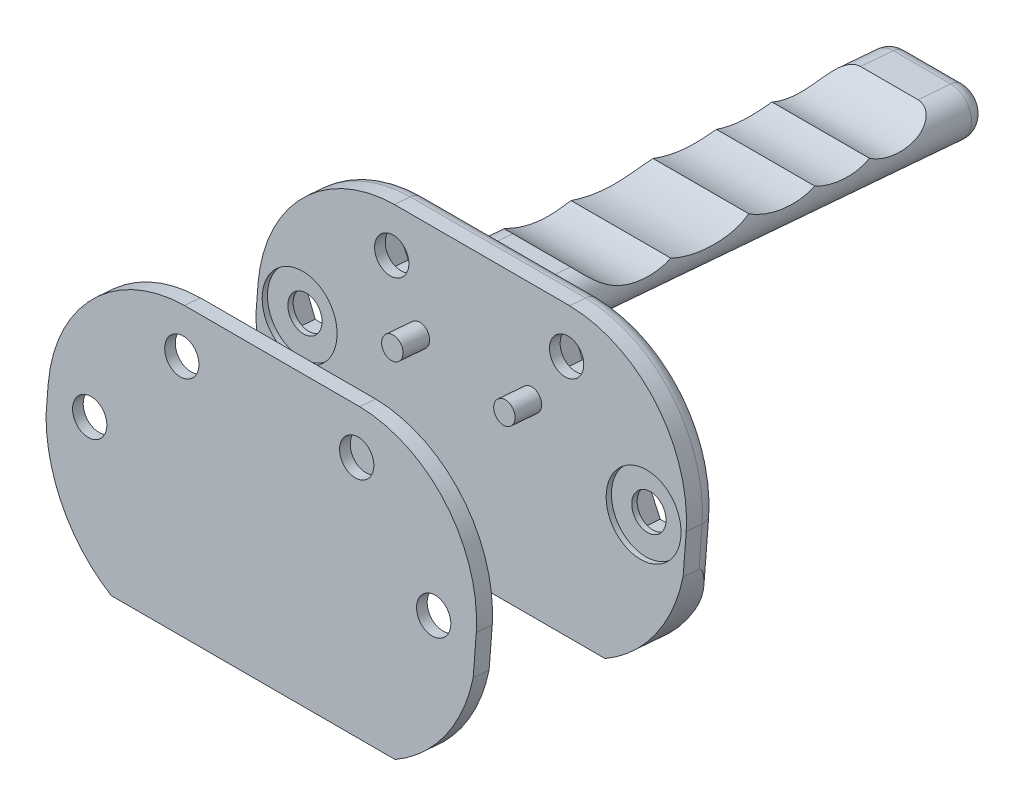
ISO-10303-21;
HEADER;
FILE_DESCRIPTION(('STEP AP214'),'2;1');
FILE_NAME('part.step','',(''),(''),'','','');
FILE_SCHEMA(('AUTOMOTIVE_DESIGN { 1 0 10303 214 1 1 1 1 }'));
ENDSEC;
DATA;
#1=APPLICATION_CONTEXT('core data for automotive mechanical design processes');
#2=APPLICATION_PROTOCOL_DEFINITION('international standard','automotive_design',2000,#1);
#3=PRODUCT_CONTEXT('',#1,'mechanical');
#4=PRODUCT('Part','Part','',(#3));
#5=PRODUCT_RELATED_PRODUCT_CATEGORY('part','',(#4));
#6=PRODUCT_DEFINITION_FORMATION('','',#4);
#7=PRODUCT_DEFINITION_CONTEXT('part definition',#1,'design');
#8=PRODUCT_DEFINITION('design','',#6,#7);
#9=PRODUCT_DEFINITION_SHAPE('','',#8);
#10=(LENGTH_UNIT() NAMED_UNIT(*) SI_UNIT(.MILLI.,.METRE.));
#11=(NAMED_UNIT(*) PLANE_ANGLE_UNIT() SI_UNIT($,.RADIAN.));
#12=(NAMED_UNIT(*) SI_UNIT($,.STERADIAN.) SOLID_ANGLE_UNIT());
#13=UNCERTAINTY_MEASURE_WITH_UNIT(LENGTH_MEASURE(1.E-05),#10,'distance_accuracy_value','');
#14=(GEOMETRIC_REPRESENTATION_CONTEXT(3) GLOBAL_UNCERTAINTY_ASSIGNED_CONTEXT((#13)) GLOBAL_UNIT_ASSIGNED_CONTEXT((#10,
#11,#12)) REPRESENTATION_CONTEXT('',''));
#15=CARTESIAN_POINT('',(0.,0.,0.));
#16=DIRECTION('',(0.,0.,1.));
#17=DIRECTION('',(1.,0.,0.));
#18=AXIS2_PLACEMENT_3D('',#15,#16,#17);
#19=CARTESIAN_POINT('',(77.4136594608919,-1.76275321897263,-113.758470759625));
#20=DIRECTION('',(0.,-0.99654575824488,0.0830454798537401));
#21=DIRECTION('',(0.,-0.0830454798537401,-0.99654575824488));
#22=AXIS2_PLACEMENT_3D('',#19,#20,#21);
#23=PLANE('',#22);
#24=DIRECTION('',(0.,0.08304547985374,0.99654575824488));
#25=VECTOR('',#24,1.);
#26=CARTESIAN_POINT('',(77.4136594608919,-1.76275321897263,-113.758470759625));
#27=LINE('',#26,#25);
#28=CARTESIAN_POINT('',(77.4136594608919,4.4312620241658,-39.4302878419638));
#29=VERTEX_POINT('',#28);
#30=CARTESIAN_POINT('',(77.4136594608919,4.88088516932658,-34.0348101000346));
#31=VERTEX_POINT('',#30);
#32=EDGE_CURVE('E985',#29,#31,#27,.T.);
#33=ORIENTED_EDGE('',*,*,#32,.F.);
#34=DIRECTION('',(1.,0.,0.));
#35=VECTOR('',#34,1.);
#36=CARTESIAN_POINT('',(62.1636594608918,4.4312620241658,-39.4302878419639));
#37=LINE('',#36,#35);
#38=CARTESIAN_POINT('',(66.6136594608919,4.4312620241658,-39.4302878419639));
#39=VERTEX_POINT('',#38);
#40=EDGE_CURVE('E485',#29,#39,#37,.F.);
#41=ORIENTED_EDGE('',*,*,#40,.T.);
#42=DIRECTION('',(0.,0.08304547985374,0.99654575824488));
#43=VECTOR('',#42,1.);
#44=CARTESIAN_POINT('',(66.6136594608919,-1.76275321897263,-113.758470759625));
#45=LINE('',#44,#43);
#46=CARTESIAN_POINT('',(66.6136594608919,4.88088516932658,-34.0348101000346));
#47=VERTEX_POINT('',#46);
#48=EDGE_CURVE('E984',#39,#47,#45,.T.);
#49=ORIENTED_EDGE('',*,*,#48,.T.);
#50=DIRECTION('',(1.,0.,0.));
#51=VECTOR('',#50,1.);
#52=CARTESIAN_POINT('',(77.4136594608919,4.88088516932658,-34.0348101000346));
#53=LINE('',#52,#51);
#54=EDGE_CURVE('E1794',#47,#31,#53,.T.);
#55=ORIENTED_EDGE('',*,*,#54,.T.);
#56=EDGE_LOOP('',(#33,#41,#49,#55));
#57=FACE_BOUND('',#56,.T.);
#58=ADVANCED_FACE('F55',(#57),#23,.F.);
#59=CARTESIAN_POINT('',(31.8636594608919,8.62687771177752,-34.3469761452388));
#60=DIRECTION('',(0.,0.0830454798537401,0.99654575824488));
#61=DIRECTION('',(0.,-0.99654575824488,0.08304547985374));
#62=AXIS2_PLACEMENT_3D('',#59,#60,#61);
#63=PLANE('',#62);
#64=DIRECTION('',(-0.5,-0.863033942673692,0.0719194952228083));
#65=VECTOR('',#64,1.);
#66=CARTESIAN_POINT('',(109.263659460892,-16.2867662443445,-32.2708391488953));
#67=LINE('',#66,#65);
#68=CARTESIAN_POINT('',(109.163659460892,-16.4593730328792,-32.2564552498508));
#69=VERTEX_POINT('',#68);
#70=CARTESIAN_POINT('',(106.763659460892,-20.6019359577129,-31.9112416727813));
#71=VERTEX_POINT('',#70);
#72=EDGE_CURVE('E904',#69,#71,#67,.T.);
#73=ORIENTED_EDGE('',*,*,#72,.F.);
#74=DIRECTION('',(0.,-0.99654575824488,0.08304547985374));
#75=VECTOR('',#74,1.);
#76=CARTESIAN_POINT('',(109.163659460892,8.62687771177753,-34.3469761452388));
#77=LINE('',#76,#75);
#78=CARTESIAN_POINT('',(109.163659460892,-31.1585209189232,-31.0315262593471));
#79=VERTEX_POINT('',#78);
#80=EDGE_CURVE('E613',#69,#79,#77,.T.);
#81=ORIENTED_EDGE('',*,*,#80,.T.);
#82=CARTESIAN_POINT('',(86.5168842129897,-18.6571735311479,-32.0733052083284));
#83=DIRECTION('',(0.,0.0830454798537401,0.99654575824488));
#84=DIRECTION('',(0.,-0.99654575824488,0.08304547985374));
#85=AXIS2_PLACEMENT_3D('',#82,#83,#84);
#86=CIRCLE('',#85,25.8890984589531);
#87=CARTESIAN_POINT('',(99.1073071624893,-41.2004102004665,-30.1947021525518));
#88=VERTEX_POINT('',#87);
#89=EDGE_CURVE('E749',#79,#88,#86,.F.);
#90=ORIENTED_EDGE('',*,*,#89,.T.);
#91=DIRECTION('',(-1.,0.,0.));
#92=VECTOR('',#91,1.);
#93=CARTESIAN_POINT('',(31.8636594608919,-41.2004102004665,-30.1947021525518));
#94=LINE('',#93,#92);
#95=CARTESIAN_POINT('',(45.8636594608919,-41.2004102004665,-30.1947021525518));
#96=VERTEX_POINT('',#95);
#97=EDGE_CURVE('E802',#88,#96,#94,.T.);
#98=ORIENTED_EDGE('',*,*,#97,.T.);
#99=CARTESIAN_POINT('',(58.6901759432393,-17.6152447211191,-32.1601326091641));
#100=DIRECTION('',(0.,0.0830454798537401,0.99654575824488));
#101=DIRECTION('',(0.,-0.99654575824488,0.08304547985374));
#102=AXIS2_PLACEMENT_3D('',#99,#100,#101);
#103=CIRCLE('',#102,26.9191841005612);
#104=CARTESIAN_POINT('',(34.8636594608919,-30.09952455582,-31.1197759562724));
#105=VERTEX_POINT('',#104);
#106=EDGE_CURVE('E658',#96,#105,#103,.F.);
#107=ORIENTED_EDGE('',*,*,#106,.T.);
#108=DIRECTION('',(0.,-0.99654575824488,0.08304547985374));
#109=VECTOR('',#108,1.);
#110=CARTESIAN_POINT('',(34.8636594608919,8.62687771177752,-34.3469761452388));
#111=LINE('',#110,#109);
#112=CARTESIAN_POINT('',(34.8636594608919,-16.2278615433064,-32.2757478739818));
#113=VERTEX_POINT('',#112);
#114=EDGE_CURVE('E611',#105,#113,#111,.F.);
#115=ORIENTED_EDGE('',*,*,#114,.T.);
#116=DIRECTION('',(-0.45748364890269,0.886146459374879,-0.0738455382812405));
#117=VECTOR('',#116,1.);
#118=CARTESIAN_POINT('',(37.0569415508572,-20.4762519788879,-31.9217153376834));
#119=LINE('',#118,#117);
#120=CARTESIAN_POINT('',(37.0569415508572,-20.4762519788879,-31.9217153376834));
#121=VERTEX_POINT('',#120);
#122=EDGE_CURVE('E599',#121,#113,#119,.T.);
#123=ORIENTED_EDGE('',*,*,#122,.F.);
#124=DIRECTION('',(-0.998827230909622,0.0482493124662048,-0.00402077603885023));
#125=VECTOR('',#124,1.);
#126=CARTESIAN_POINT('',(42.0510777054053,-20.7174985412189,-31.9016114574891));
#127=LINE('',#126,#125);
#128=CARTESIAN_POINT('',(42.0510777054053,-20.7174985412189,-31.9016114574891));
#129=VERTEX_POINT('',#128);
#130=EDGE_CURVE('E669',#129,#121,#127,.T.);
#131=ORIENTED_EDGE('',*,*,#130,.F.);
#132=DIRECTION('',(-0.541343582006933,-0.837897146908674,0.0698247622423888));
#133=VECTOR('',#132,1.);
#134=CARTESIAN_POINT('',(44.75779561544,-16.5280128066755,-32.2507352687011));
#135=LINE('',#134,#133);
#136=CARTESIAN_POINT('',(44.75779561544,-16.5280128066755,-32.2507352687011));
#137=VERTEX_POINT('',#136);
#138=EDGE_CURVE('E681',#137,#129,#135,.T.);
#139=ORIENTED_EDGE('',*,*,#138,.F.);
#140=DIRECTION('',(0.45748364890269,-0.886146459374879,0.0738455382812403));
#141=VECTOR('',#140,1.);
#142=CARTESIAN_POINT('',(42.4703773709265,-12.0972805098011,-32.6199629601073));
#143=LINE('',#142,#141);
#144=CARTESIAN_POINT('',(42.4703773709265,-12.0972805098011,-32.6199629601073));
#145=VERTEX_POINT('',#144);
#146=EDGE_CURVE('E677',#145,#137,#143,.T.);
#147=ORIENTED_EDGE('',*,*,#146,.F.);
#148=DIRECTION('',(0.998827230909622,-0.048249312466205,0.00402077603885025));
#149=VECTOR('',#148,1.);
#150=CARTESIAN_POINT('',(37.4762412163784,-11.8560339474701,-32.6400668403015));
#151=LINE('',#150,#149);
#152=CARTESIAN_POINT('',(37.4762412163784,-11.8560339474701,-32.6400668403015));
#153=VERTEX_POINT('',#152);
#154=EDGE_CURVE('E673',#153,#145,#151,.T.);
#155=ORIENTED_EDGE('',*,*,#154,.F.);
#156=DIRECTION('',(0.541343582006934,0.837897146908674,-0.0698247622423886));
#157=VECTOR('',#156,1.);
#158=CARTESIAN_POINT('',(34.7695233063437,-16.0455196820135,-32.2909430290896));
#159=LINE('',#158,#157);
#160=CARTESIAN_POINT('',(34.8636594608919,-15.8998147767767,-32.303085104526));
#161=VERTEX_POINT('',#160);
#162=EDGE_CURVE('E665',#161,#153,#159,.T.);
#163=ORIENTED_EDGE('',*,*,#162,.F.);
#164=DIRECTION('',(0.,-0.99654575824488,0.08304547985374));
#165=VECTOR('',#164,1.);
#166=CARTESIAN_POINT('',(34.8636594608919,8.62687771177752,-34.3469761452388));
#167=LINE('',#166,#165);
#168=CARTESIAN_POINT('',(34.8636594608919,-14.8963679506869,-32.3867056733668));
#169=VERTEX_POINT('',#168);
#170=EDGE_CURVE('E596',#161,#169,#167,.F.);
#171=ORIENTED_EDGE('',*,*,#170,.T.);
#172=CARTESIAN_POINT('',(55.7083987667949,-15.1354960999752,-32.3667783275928));
#173=DIRECTION('',(0.,0.0830454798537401,0.99654575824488));
#174=DIRECTION('',(0.,-0.99654575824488,0.08304547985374));
#175=AXIS2_PLACEMENT_3D('',#172,#173,#174);
#176=CIRCLE('',#175,20.8461204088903);
#177=CARTESIAN_POINT('',(55.4684417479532,5.63724043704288,-34.0978397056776));
#178=VERTEX_POINT('',#177);
#179=EDGE_CURVE('E593',#169,#178,#176,.F.);
#180=ORIENTED_EDGE('',*,*,#179,.T.);
#181=DIRECTION('',(-1.,0.,0.));
#182=VECTOR('',#181,1.);
#183=CARTESIAN_POINT('',(88.3189201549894,5.63724043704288,-34.0978397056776));
#184=LINE('',#183,#182);
#185=CARTESIAN_POINT('',(88.2912355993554,5.63724043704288,-34.0978397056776));
#186=VERTEX_POINT('',#185);
#187=EDGE_CURVE('E590',#178,#186,#184,.F.);
#188=ORIENTED_EDGE('',*,*,#187,.T.);
#189=CARTESIAN_POINT('',(87.8850885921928,-15.5678291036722,-32.3307505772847));
#190=DIRECTION('',(0.,0.0830454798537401,0.99654575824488));
#191=DIRECTION('',(0.,-0.99654575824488,0.08304547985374));
#192=AXIS2_PLACEMENT_3D('',#189,#190,#191);
#193=CIRCLE('',#192,21.2824466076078);
#194=CARTESIAN_POINT('',(109.163659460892,-15.1630850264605,-32.3644792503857));
#195=VERTEX_POINT('',#194);
#196=EDGE_CURVE('E606',#186,#195,#193,.F.);
#197=ORIENTED_EDGE('',*,*,#196,.T.);
#198=DIRECTION('',(0.,-0.99654575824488,0.08304547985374));
#199=VECTOR('',#198,1.);
#200=CARTESIAN_POINT('',(109.163659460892,8.62687771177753,-34.3469761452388));
#201=LINE('',#200,#199);
#202=CARTESIAN_POINT('',(109.163659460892,-16.1141594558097,-32.2852230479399));
#203=VERTEX_POINT('',#202);
#204=EDGE_CURVE('E608',#195,#203,#201,.T.);
#205=ORIENTED_EDGE('',*,*,#204,.T.);
#206=DIRECTION('',(0.499999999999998,-0.863033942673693,0.0719194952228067));
#207=VECTOR('',#206,1.);
#208=CARTESIAN_POINT('',(106.763659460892,-11.971596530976,-32.6304366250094));
#209=LINE('',#208,#207);
#210=CARTESIAN_POINT('',(106.763659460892,-11.971596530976,-32.6304366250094));
#211=VERTEX_POINT('',#210);
#212=EDGE_CURVE('E900',#211,#203,#209,.T.);
#213=ORIENTED_EDGE('',*,*,#212,.F.);
#214=DIRECTION('',(1.,0.,0.));
#215=VECTOR('',#214,1.);
#216=CARTESIAN_POINT('',(101.763659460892,-11.971596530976,-32.6304366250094));
#217=LINE('',#216,#215);
#218=CARTESIAN_POINT('',(101.763659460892,-11.971596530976,-32.6304366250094));
#219=VERTEX_POINT('',#218);
#220=EDGE_CURVE('E896',#219,#211,#217,.T.);
#221=ORIENTED_EDGE('',*,*,#220,.F.);
#222=DIRECTION('',(0.499999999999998,0.863033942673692,-0.0719194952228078));
#223=VECTOR('',#222,1.);
#224=CARTESIAN_POINT('',(99.2636594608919,-16.2867662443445,-32.2708391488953));
#225=LINE('',#224,#223);
#226=CARTESIAN_POINT('',(99.2636594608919,-16.2867662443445,-32.2708391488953));
#227=VERTEX_POINT('',#226);
#228=EDGE_CURVE('E891',#227,#219,#225,.T.);
#229=ORIENTED_EDGE('',*,*,#228,.F.);
#230=DIRECTION('',(-0.499999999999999,0.863033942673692,-0.0719194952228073));
#231=VECTOR('',#230,1.);
#232=CARTESIAN_POINT('',(101.763659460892,-20.6019359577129,-31.9112416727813));
#233=LINE('',#232,#231);
#234=CARTESIAN_POINT('',(101.763659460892,-20.6019359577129,-31.9112416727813));
#235=VERTEX_POINT('',#234);
#236=EDGE_CURVE('E780',#235,#227,#233,.T.);
#237=ORIENTED_EDGE('',*,*,#236,.F.);
#238=DIRECTION('',(-1.,0.,0.));
#239=VECTOR('',#238,1.);
#240=CARTESIAN_POINT('',(106.763659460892,-20.6019359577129,-31.9112416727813));
#241=LINE('',#240,#239);
#242=EDGE_CURVE('E907',#71,#235,#241,.T.);
#243=ORIENTED_EDGE('',*,*,#242,.F.);
#244=EDGE_LOOP('',(#73,#81,#90,#98,#107,#115,#123,#131,#139,#147,#155,#163,#171,#180,#188,#197,
#205,#213,#221,#229,#237,#243));
#245=FACE_BOUND('',#244,.T.);
#246=DIRECTION('',(-0.465198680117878,0.882148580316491,-0.0735123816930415));
#247=VECTOR('',#246,1.);
#248=CARTESIAN_POINT('',(85.7436004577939,-3.44865102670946,-33.3406820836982));
#249=LINE('',#248,#247);
#250=CARTESIAN_POINT('',(85.7436004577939,-3.44865102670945,-33.3406820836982));
#251=VERTEX_POINT('',#250);
#252=CARTESIAN_POINT('',(83.4176070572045,0.962091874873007,-33.7082439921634));
#253=VERTEX_POINT('',#252);
#254=EDGE_CURVE('E831',#251,#253,#249,.T.);
#255=ORIENTED_EDGE('',*,*,#254,.F.);
#256=DIRECTION('',(-0.99921048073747,0.039592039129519,-0.00329933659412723));
#257=VECTOR('',#256,1.);
#258=CARTESIAN_POINT('',(90.7396528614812,-3.64661122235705,-33.3241854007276));
#259=LINE('',#258,#257);
#260=CARTESIAN_POINT('',(90.7396528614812,-3.64661122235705,-33.3241854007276));
#261=VERTEX_POINT('',#260);
#262=EDGE_CURVE('E787',#261,#251,#259,.T.);
#263=ORIENTED_EDGE('',*,*,#262,.F.);
#264=DIRECTION('',(-0.534011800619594,-0.842556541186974,0.0702130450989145));
#265=VECTOR('',#264,1.);
#266=CARTESIAN_POINT('',(93.4097118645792,0.566171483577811,-33.6752506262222));
#267=LINE('',#266,#265);
#268=CARTESIAN_POINT('',(93.4097118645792,0.566171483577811,-33.6752506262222));
#269=VERTEX_POINT('',#268);
#270=EDGE_CURVE('E843',#269,#261,#267,.T.);
#271=ORIENTED_EDGE('',*,*,#270,.F.);
#272=DIRECTION('',(0.465198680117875,-0.882148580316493,0.0735123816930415));
#273=VECTOR('',#272,1.);
#274=CARTESIAN_POINT('',(91.0837184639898,4.97691438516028,-34.0428125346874));
#275=LINE('',#274,#273);
#276=CARTESIAN_POINT('',(91.0837184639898,4.97691438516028,-34.0428125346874));
#277=VERTEX_POINT('',#276);
#278=EDGE_CURVE('E840',#277,#269,#275,.T.);
#279=ORIENTED_EDGE('',*,*,#278,.F.);
#280=DIRECTION('',(0.99921048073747,-0.0395920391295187,0.00329933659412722));
#281=VECTOR('',#280,1.);
#282=CARTESIAN_POINT('',(86.0876660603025,5.17487458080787,-34.059309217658));
#283=LINE('',#282,#281);
#284=CARTESIAN_POINT('',(86.0876660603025,5.17487458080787,-34.059309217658));
#285=VERTEX_POINT('',#284);
#286=EDGE_CURVE('E837',#285,#277,#283,.T.);
#287=ORIENTED_EDGE('',*,*,#286,.F.);
#288=DIRECTION('',(0.534011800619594,0.842556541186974,-0.0702130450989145));
#289=VECTOR('',#288,1.);
#290=CARTESIAN_POINT('',(83.4176070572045,0.962091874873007,-33.7082439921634));
#291=LINE('',#290,#289);
#292=EDGE_CURVE('E834',#253,#285,#291,.T.);
#293=ORIENTED_EDGE('',*,*,#292,.F.);
#294=EDGE_LOOP('',(#255,#263,#271,#279,#287,#293));
#295=FACE_BOUND('',#294,.T.);
#296=DIRECTION('',(-0.498193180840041,0.864071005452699,-0.0720059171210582));
#297=VECTOR('',#296,1.);
#298=CARTESIAN_POINT('',(53.1046362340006,-3.54583395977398,-33.3325835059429));
#299=LINE('',#298,#297);
#300=CARTESIAN_POINT('',(53.1046362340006,-3.54583395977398,-33.3325835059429));
#301=VERTEX_POINT('',#300);
#302=CARTESIAN_POINT('',(50.6136703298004,0.77452106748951,-33.6926130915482));
#303=VERTEX_POINT('',#302);
#304=EDGE_CURVE('E713',#301,#303,#299,.T.);
#305=ORIENTED_EDGE('',*,*,#304,.F.);
#306=DIRECTION('',(-0.999997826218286,0.00207787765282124,-0.000173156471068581));
#307=VECTOR('',#306,1.);
#308=CARTESIAN_POINT('',(58.1046253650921,-3.55622334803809,-33.3317177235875));
#309=LINE('',#308,#307);
#310=CARTESIAN_POINT('',(58.1046253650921,-3.55622334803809,-33.3317177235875));
#311=VERTEX_POINT('',#310);
#312=EDGE_CURVE('E710',#311,#301,#309,.T.);
#313=ORIENTED_EDGE('',*,*,#312,.F.);
#314=DIRECTION('',(-0.501804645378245,-0.861993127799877,0.0718327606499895));
#315=VECTOR('',#314,1.);
#316=CARTESIAN_POINT('',(60.6136485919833,0.753742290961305,-33.6908815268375));
#317=LINE('',#316,#315);
#318=CARTESIAN_POINT('',(60.6136485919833,0.753742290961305,-33.6908815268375));
#319=VERTEX_POINT('',#318);
#320=EDGE_CURVE('E730',#319,#311,#317,.T.);
#321=ORIENTED_EDGE('',*,*,#320,.F.);
#322=DIRECTION('',(0.49819318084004,-0.864071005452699,0.0720059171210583));
#323=VECTOR('',#322,1.);
#324=CARTESIAN_POINT('',(58.1226826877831,5.0740973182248,-34.0509111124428));
#325=LINE('',#324,#323);
#326=CARTESIAN_POINT('',(58.1226826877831,5.0740973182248,-34.0509111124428));
#327=VERTEX_POINT('',#326);
#328=EDGE_CURVE('E726',#327,#319,#325,.T.);
#329=ORIENTED_EDGE('',*,*,#328,.F.);
#330=DIRECTION('',(0.999997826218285,-0.00207787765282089,0.000173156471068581));
#331=VECTOR('',#330,1.);
#332=CARTESIAN_POINT('',(53.1226935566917,5.0844867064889,-34.0517768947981));
#333=LINE('',#332,#331);
#334=CARTESIAN_POINT('',(53.1226935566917,5.0844867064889,-34.0517768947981));
#335=VERTEX_POINT('',#334);
#336=EDGE_CURVE('E722',#335,#327,#333,.T.);
#337=ORIENTED_EDGE('',*,*,#336,.F.);
#338=DIRECTION('',(0.501804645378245,0.861993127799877,-0.0718327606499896));
#339=VECTOR('',#338,1.);
#340=CARTESIAN_POINT('',(50.6136703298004,0.77452106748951,-33.6926130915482));
#341=LINE('',#340,#339);
#342=EDGE_CURVE('E718',#303,#335,#341,.T.);
#343=ORIENTED_EDGE('',*,*,#342,.F.);
#344=EDGE_LOOP('',(#305,#313,#321,#329,#337,#343));
#345=FACE_BOUND('',#344,.T.);
#346=CARTESIAN_POINT('',(77.4136594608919,0.693109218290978,-33.6858287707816));
#347=DIRECTION('',(0.,-0.08304547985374,-0.99654575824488));
#348=DIRECTION('',(0.,0.99654575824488,-0.08304547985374));
#349=AXIS2_PLACEMENT_3D('',#346,#347,#348);
#350=CIRCLE('',#349,4.20229168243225);
#351=CARTESIAN_POINT('',(77.4136594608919,-3.49466673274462,-33.3368474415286));
#352=VERTEX_POINT('',#351);
#353=EDGE_CURVE('E433',#31,#352,#350,.T.);
#354=ORIENTED_EDGE('',*,*,#353,.F.);
#355=ORIENTED_EDGE('',*,*,#54,.F.);
#356=CARTESIAN_POINT('',(66.6136594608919,0.693109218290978,-33.6858287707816));
#357=DIRECTION('',(0.,-0.08304547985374,-0.99654575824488));
#358=DIRECTION('',(0.,0.99654575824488,-0.08304547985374));
#359=AXIS2_PLACEMENT_3D('',#356,#357,#358);
#360=CIRCLE('',#359,4.20229168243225);
#361=CARTESIAN_POINT('',(66.6136594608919,-3.49466673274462,-33.3368474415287));
#362=VERTEX_POINT('',#361);
#363=EDGE_CURVE('E1797',#362,#47,#360,.T.);
#364=ORIENTED_EDGE('',*,*,#363,.F.);
#365=DIRECTION('',(-1.,0.,0.));
#366=VECTOR('',#365,1.);
#367=CARTESIAN_POINT('',(77.4136594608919,-3.49466673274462,-33.3368474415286));
#368=LINE('',#367,#366);
#369=EDGE_CURVE('E1798',#352,#362,#368,.T.);
#370=ORIENTED_EDGE('',*,*,#369,.F.);
#371=EDGE_LOOP('',(#354,#355,#364,#370));
#372=FACE_BOUND('',#371,.T.);
#373=ADVANCED_FACE('F654',(#245,#295,#345,#372),#63,.F.);
#374=CARTESIAN_POINT('',(39.7636594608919,-16.6604709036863,-36.7552950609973));
#375=DIRECTION('',(0.,0.0830454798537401,0.99654575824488));
#376=DIRECTION('',(0.,-0.99654575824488,0.08304547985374));
#377=AXIS2_PLACEMENT_3D('',#374,#375,#376);
#378=CYLINDRICAL_SURFACE('',#377,3.2);
#379=CARTESIAN_POINT('',(39.7636594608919,-15.9545843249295,-28.2846561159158));
#380=DIRECTION('',(0.,-0.0830454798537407,-0.99654575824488));
#381=DIRECTION('',(0.,0.99654575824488,-0.0830454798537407));
#382=AXIS2_PLACEMENT_3D('',#379,#380,#381);
#383=CIRCLE('',#382,3.2);
#384=CARTESIAN_POINT('',(39.7636594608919,-12.7656378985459,-28.5504016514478));
#385=VERTEX_POINT('',#384);
#386=EDGE_CURVE('E773',#385,#385,#383,.F.);
#387=ORIENTED_EDGE('',*,*,#386,.F.);
#388=EDGE_LOOP('',(#387));
#389=FACE_BOUND('',#388,.T.);
#390=CARTESIAN_POINT('',(39.7636594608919,-15.8715388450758,-27.2881103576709));
#391=DIRECTION('',(0.,0.08304547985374,0.99654575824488));
#392=DIRECTION('',(0.,-0.99654575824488,0.08304547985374));
#393=AXIS2_PLACEMENT_3D('',#390,#391,#392);
#394=CIRCLE('',#393,3.2);
#395=CARTESIAN_POINT('',(39.7636594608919,-19.0604852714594,-27.022364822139));
#396=VERTEX_POINT('',#395);
#397=EDGE_CURVE('E602',#396,#396,#394,.F.);
#398=ORIENTED_EDGE('',*,*,#397,.F.);
#399=EDGE_LOOP('',(#398));
#400=FACE_BOUND('',#399,.T.);
#401=ADVANCED_FACE('F971',(#389,#400),#378,.F.);
#402=CARTESIAN_POINT('',(104.263659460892,-16.6604709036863,-36.7552950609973));
#403=DIRECTION('',(0.,0.0830454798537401,0.99654575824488));
#404=DIRECTION('',(0.,-0.99654575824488,0.08304547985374));
#405=AXIS2_PLACEMENT_3D('',#402,#403,#404);
#406=CYLINDRICAL_SURFACE('',#405,3.2);
#407=CARTESIAN_POINT('',(104.263659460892,-15.9545843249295,-28.2846561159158));
#408=DIRECTION('',(0.,-0.0830454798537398,-0.99654575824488));
#409=DIRECTION('',(0.,0.99654575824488,-0.0830454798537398));
#410=AXIS2_PLACEMENT_3D('',#407,#408,#409);
#411=CIRCLE('',#410,3.2);
#412=CARTESIAN_POINT('',(104.263659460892,-12.7656378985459,-28.5504016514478));
#413=VERTEX_POINT('',#412);
#414=EDGE_CURVE('E777',#413,#413,#411,.F.);
#415=ORIENTED_EDGE('',*,*,#414,.F.);
#416=EDGE_LOOP('',(#415));
#417=FACE_BOUND('',#416,.T.);
#418=CARTESIAN_POINT('',(104.263659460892,-15.8715388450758,-27.2881103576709));
#419=DIRECTION('',(0.,0.08304547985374,0.99654575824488));
#420=DIRECTION('',(0.,-0.99654575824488,0.08304547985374));
#421=AXIS2_PLACEMENT_3D('',#418,#419,#420);
#422=CIRCLE('',#421,3.2);
#423=CARTESIAN_POINT('',(104.263659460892,-19.0604852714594,-27.022364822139));
#424=VERTEX_POINT('',#423);
#425=EDGE_CURVE('E750',#424,#424,#422,.F.);
#426=ORIENTED_EDGE('',*,*,#425,.F.);
#427=EDGE_LOOP('',(#426));
#428=FACE_BOUND('',#427,.T.);
#429=ADVANCED_FACE('F1249',(#417,#428),#406,.F.);
#430=CARTESIAN_POINT('',(55.6136594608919,0.390427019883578,-38.1762032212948));
#431=DIRECTION('',(0.,0.0830454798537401,0.99654575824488));
#432=DIRECTION('',(0.,-0.99654575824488,0.08304547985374));
#433=AXIS2_PLACEMENT_3D('',#430,#431,#432);
#434=CYLINDRICAL_SURFACE('',#433,3.2);
#435=CARTESIAN_POINT('',(55.6136594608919,1.26240455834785,-27.7124727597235));
#436=DIRECTION('',(0.,-0.0830454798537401,-0.99654575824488));
#437=DIRECTION('',(0.,0.99654575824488,-0.08304547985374));
#438=AXIS2_PLACEMENT_3D('',#435,#436,#437);
#439=CIRCLE('',#438,3.2);
#440=CARTESIAN_POINT('',(55.6136594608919,4.45135098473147,-27.9782182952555));
#441=VERTEX_POINT('',#440);
#442=EDGE_CURVE('E808',#441,#441,#439,.T.);
#443=ORIENTED_EDGE('',*,*,#442,.F.);
#444=EDGE_LOOP('',(#443));
#445=FACE_BOUND('',#444,.T.);
#446=CARTESIAN_POINT('',(55.6136594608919,1.09631359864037,-29.7055642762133));
#447=DIRECTION('',(0.,-0.0830454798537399,-0.99654575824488));
#448=DIRECTION('',(0.,0.99654575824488,-0.0830454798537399));
#449=AXIS2_PLACEMENT_3D('',#446,#447,#448);
#450=CIRCLE('',#449,3.2);
#451=CARTESIAN_POINT('',(55.6136594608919,4.28526002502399,-29.9713098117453));
#452=VERTEX_POINT('',#451);
#453=EDGE_CURVE('E709',#452,#452,#450,.F.);
#454=ORIENTED_EDGE('',*,*,#453,.F.);
#455=EDGE_LOOP('',(#454));
#456=FACE_BOUND('',#455,.T.);
#457=ADVANCED_FACE('F1259',(#445,#456),#434,.F.);
#458=CARTESIAN_POINT('',(88.4136594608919,0.390427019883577,-38.1762032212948));
#459=DIRECTION('',(0.,0.0830454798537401,0.99654575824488));
#460=DIRECTION('',(0.,-0.99654575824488,0.08304547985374));
#461=AXIS2_PLACEMENT_3D('',#458,#459,#460);
#462=CYLINDRICAL_SURFACE('',#461,3.2);
#463=CARTESIAN_POINT('',(88.4136594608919,1.26240455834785,-27.7124727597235));
#464=DIRECTION('',(0.,-0.0830454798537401,-0.99654575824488));
#465=DIRECTION('',(0.,0.99654575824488,-0.08304547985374));
#466=AXIS2_PLACEMENT_3D('',#463,#464,#465);
#467=CIRCLE('',#466,3.2);
#468=CARTESIAN_POINT('',(88.4136594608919,4.45135098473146,-27.9782182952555));
#469=VERTEX_POINT('',#468);
#470=EDGE_CURVE('E756',#469,#469,#467,.T.);
#471=ORIENTED_EDGE('',*,*,#470,.F.);
#472=EDGE_LOOP('',(#471));
#473=FACE_BOUND('',#472,.T.);
#474=CARTESIAN_POINT('',(88.4136594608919,1.09631359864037,-29.7055642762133));
#475=DIRECTION('',(0.,-0.0830454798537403,-0.99654575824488));
#476=DIRECTION('',(0.,0.99654575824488,-0.0830454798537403));
#477=AXIS2_PLACEMENT_3D('',#474,#475,#476);
#478=CIRCLE('',#477,3.2);
#479=CARTESIAN_POINT('',(88.4136594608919,4.28526002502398,-29.9713098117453));
#480=VERTEX_POINT('',#479);
#481=EDGE_CURVE('E784',#480,#480,#478,.F.);
#482=ORIENTED_EDGE('',*,*,#481,.F.);
#483=EDGE_LOOP('',(#482));
#484=FACE_BOUND('',#483,.T.);
#485=ADVANCED_FACE('F1636',(#473,#484),#462,.F.);
#486=CARTESIAN_POINT('',(31.8636594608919,9.12515059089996,-28.3677015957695));
#487=DIRECTION('',(0.,-0.0830454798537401,-0.99654575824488));
#488=DIRECTION('',(0.,0.99654575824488,-0.08304547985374));
#489=AXIS2_PLACEMENT_3D('',#486,#487,#488);
#490=PLANE('',#489);
#491=CARTESIAN_POINT('',(39.7636594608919,-15.788493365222,-26.291564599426));
#492=DIRECTION('',(0.,0.08304547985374,0.99654575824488));
#493=DIRECTION('',(0.,-0.99654575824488,0.08304547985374));
#494=AXIS2_PLACEMENT_3D('',#491,#492,#493);
#495=CIRCLE('',#494,7.);
#496=CARTESIAN_POINT('',(39.7636594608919,-22.7643136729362,-25.7102462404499));
#497=VERTEX_POINT('',#496);
#498=EDGE_CURVE('E758',#497,#497,#495,.T.);
#499=ORIENTED_EDGE('',*,*,#498,.F.);
#500=EDGE_LOOP('',(#499));
#501=FACE_BOUND('',#500,.T.);
#502=CARTESIAN_POINT('',(104.263659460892,-15.788493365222,-26.291564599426));
#503=DIRECTION('',(0.,0.08304547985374,0.99654575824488));
#504=DIRECTION('',(0.,-0.99654575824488,0.08304547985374));
#505=AXIS2_PLACEMENT_3D('',#502,#503,#504);
#506=CIRCLE('',#505,7.);
#507=CARTESIAN_POINT('',(104.263659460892,-22.7643136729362,-25.7102462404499));
#508=VERTEX_POINT('',#507);
#509=EDGE_CURVE('E763',#508,#508,#506,.T.);
#510=ORIENTED_EDGE('',*,*,#509,.F.);
#511=EDGE_LOOP('',(#510));
#512=FACE_BOUND('',#511,.T.);
#513=CARTESIAN_POINT('',(82.520844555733,-8.31440017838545,-26.9144056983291));
#514=DIRECTION('',(0.,-0.0830454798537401,-0.99654575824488));
#515=DIRECTION('',(0.,0.99654575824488,-0.08304547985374));
#516=AXIS2_PLACEMENT_3D('',#513,#514,#515);
#517=CIRCLE('',#516,2.);
#518=CARTESIAN_POINT('',(82.520844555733,-6.32130866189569,-27.0804966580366));
#519=VERTEX_POINT('',#518);
#520=EDGE_CURVE('E789',#519,#519,#517,.F.);
#521=ORIENTED_EDGE('',*,*,#520,.F.);
#522=EDGE_LOOP('',(#521));
#523=FACE_BOUND('',#522,.T.);
#524=CARTESIAN_POINT('',(61.5064743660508,-8.31440017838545,-26.9144056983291));
#525=DIRECTION('',(0.,-0.0830454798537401,-0.99654575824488));
#526=DIRECTION('',(0.,0.99654575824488,-0.08304547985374));
#527=AXIS2_PLACEMENT_3D('',#524,#525,#526);
#528=CIRCLE('',#527,1.99999999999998);
#529=CARTESIAN_POINT('',(61.5064743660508,-6.32130866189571,-27.0804966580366));
#530=VERTEX_POINT('',#529);
#531=EDGE_CURVE('E584',#530,#530,#528,.F.);
#532=ORIENTED_EDGE('',*,*,#531,.F.);
#533=EDGE_LOOP('',(#532));
#534=FACE_BOUND('',#533,.T.);
#535=ORIENTED_EDGE('',*,*,#470,.T.);
#536=EDGE_LOOP('',(#535));
#537=FACE_BOUND('',#536,.T.);
#538=ORIENTED_EDGE('',*,*,#442,.T.);
#539=EDGE_LOOP('',(#538));
#540=FACE_BOUND('',#539,.T.);
#541=DIRECTION('',(0.,-0.99654575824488,0.0830454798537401));
#542=VECTOR('',#541,1.);
#543=CARTESIAN_POINT('',(31.8636594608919,9.12515059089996,-28.3677015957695));
#544=LINE('',#543,#542);
#545=CARTESIAN_POINT('',(31.8636594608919,-14.3814660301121,-26.4088168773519));
#546=VERTEX_POINT('',#545);
#547=CARTESIAN_POINT('',(31.8636594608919,-19.3409632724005,-25.9955254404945));
#548=VERTEX_POINT('',#547);
#549=EDGE_CURVE('E806',#546,#548,#544,.T.);
#550=ORIENTED_EDGE('',*,*,#549,.T.);
#551=CARTESIAN_POINT('',(58.6901759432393,-17.1169718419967,-26.1808580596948));
#552=DIRECTION('',(0.,-0.0830454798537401,-0.99654575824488));
#553=DIRECTION('',(0.,0.99654575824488,-0.08304547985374));
#554=AXIS2_PLACEMENT_3D('',#551,#552,#553);
#555=CIRCLE('',#554,26.9191841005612);
#556=CARTESIAN_POINT('',(45.8636594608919,-40.702137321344,-24.2154276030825));
#557=VERTEX_POINT('',#556);
#558=EDGE_CURVE('E645',#548,#557,#555,.F.);
#559=ORIENTED_EDGE('',*,*,#558,.T.);
#560=DIRECTION('',(1.,0.,0.));
#561=VECTOR('',#560,1.);
#562=CARTESIAN_POINT('',(31.8636594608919,-40.702137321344,-24.2154276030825));
#563=LINE('',#562,#561);
#564=CARTESIAN_POINT('',(99.1073071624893,-40.702137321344,-24.2154276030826));
#565=VERTEX_POINT('',#564);
#566=EDGE_CURVE('E799',#557,#565,#563,.T.);
#567=ORIENTED_EDGE('',*,*,#566,.T.);
#568=CARTESIAN_POINT('',(86.5168842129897,-18.1589006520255,-26.0940306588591));
#569=DIRECTION('',(0.,-0.0830454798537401,-0.99654575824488));
#570=DIRECTION('',(0.,0.99654575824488,-0.08304547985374));
#571=AXIS2_PLACEMENT_3D('',#568,#569,#570);
#572=CIRCLE('',#571,25.8890984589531);
#573=CARTESIAN_POINT('',(112.163659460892,-21.6805780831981,-25.8005575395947));
#574=VERTEX_POINT('',#573);
#575=EDGE_CURVE('E801',#565,#574,#572,.F.);
#576=ORIENTED_EDGE('',*,*,#575,.T.);
#577=DIRECTION('',(0.,-0.99654575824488,0.0830454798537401));
#578=VECTOR('',#577,1.);
#579=CARTESIAN_POINT('',(112.163659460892,9.12515059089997,-28.3677015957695));
#580=LINE('',#579,#578);
#581=CARTESIAN_POINT('',(112.163659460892,-14.6372232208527,-26.3875037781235));
#582=VERTEX_POINT('',#581);
#583=EDGE_CURVE('E646',#582,#574,#580,.T.);
#584=ORIENTED_EDGE('',*,*,#583,.F.);
#585=CARTESIAN_POINT('',(87.8850885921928,-15.0695562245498,-26.3514760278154));
#586=DIRECTION('',(0.,-0.0830454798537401,-0.99654575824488));
#587=DIRECTION('',(0.,0.99654575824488,-0.08304547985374));
#588=AXIS2_PLACEMENT_3D('',#585,#586,#587);
#589=CIRCLE('',#588,24.2824466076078);
#590=CARTESIAN_POINT('',(88.3189201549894,9.12515059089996,-28.3677015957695));
#591=VERTEX_POINT('',#590);
#592=EDGE_CURVE('E815',#582,#591,#589,.F.);
#593=ORIENTED_EDGE('',*,*,#592,.T.);
#594=DIRECTION('',(1.,0.,0.));
#595=VECTOR('',#594,1.);
#596=CARTESIAN_POINT('',(31.8636594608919,9.12515059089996,-28.3677015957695));
#597=LINE('',#596,#595);
#598=CARTESIAN_POINT('',(55.4517550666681,9.12515059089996,-28.3677015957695));
#599=VERTEX_POINT('',#598);
#600=EDGE_CURVE('E743',#599,#591,#597,.T.);
#601=ORIENTED_EDGE('',*,*,#600,.F.);
#602=CARTESIAN_POINT('',(55.7083987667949,-14.6372232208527,-26.3875037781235));
#603=DIRECTION('',(0.,-0.0830454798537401,-0.99654575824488));
#604=DIRECTION('',(0.,0.99654575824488,-0.08304547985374));
#605=AXIS2_PLACEMENT_3D('',#602,#603,#604);
#606=CIRCLE('',#605,23.8461204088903);
#607=EDGE_CURVE('E583',#599,#546,#606,.F.);
#608=ORIENTED_EDGE('',*,*,#607,.T.);
#609=EDGE_LOOP('',(#550,#559,#567,#576,#584,#593,#601,#608));
#610=FACE_BOUND('',#609,.T.);
#611=ADVANCED_FACE('F1627',(#501,#512,#523,#534,#537,#540,#610),#490,.F.);
#612=CARTESIAN_POINT('',(0.,-38.4173975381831,3.20144979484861));
#613=DIRECTION('',(0.,0.99654575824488,-0.0830454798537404));
#614=DIRECTION('',(0.,0.0830454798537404,0.99654575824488));
#615=AXIS2_PLACEMENT_3D('',#612,#613,#614);
#616=PLANE('',#615);
#617=ORIENTED_EDGE('',*,*,#97,.F.);
#618=DIRECTION('',(0.,0.0830454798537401,0.99654575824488));
#619=VECTOR('',#618,1.);
#620=CARTESIAN_POINT('',(99.1073071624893,-41.5741148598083,-34.6791580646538));
#621=LINE('',#620,#619);
#622=EDGE_CURVE('E747',#88,#565,#621,.T.);
#623=ORIENTED_EDGE('',*,*,#622,.T.);
#624=ORIENTED_EDGE('',*,*,#566,.F.);
#625=DIRECTION('',(0.,0.08304547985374,0.99654575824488));
#626=VECTOR('',#625,1.);
#627=CARTESIAN_POINT('',(45.8636594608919,-40.9927965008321,-27.7033377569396));
#628=LINE('',#627,#626);
#629=EDGE_CURVE('E741',#96,#557,#628,.T.);
#630=ORIENTED_EDGE('',*,*,#629,.F.);
#631=EDGE_LOOP('',(#617,#623,#624,#630));
#632=FACE_BOUND('',#631,.T.);
#633=ADVANCED_FACE('F1618',(#632),#616,.F.);
#634=CARTESIAN_POINT('',(31.8636594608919,8.62687771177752,-34.3469761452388));
#635=DIRECTION('',(1.,0.,0.));
#636=DIRECTION('',(0.,1.,0.));
#637=AXIS2_PLACEMENT_3D('',#634,#635,#636);
#638=PLANE('',#637);
#639=DIRECTION('',(0.,0.0830454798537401,0.99654575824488));
#640=VECTOR('',#639,1.);
#641=CARTESIAN_POINT('',(31.8636594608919,-15.2534435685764,-36.8725473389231));
#642=LINE('',#641,#640);
#643=CARTESIAN_POINT('',(31.8636594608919,-14.6306024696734,-29.3984541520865));
#644=VERTEX_POINT('',#643);
#645=EDGE_CURVE('E637',#546,#644,#642,.F.);
#646=ORIENTED_EDGE('',*,*,#645,.T.);
#647=DIRECTION('',(0.,-0.99654575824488,0.08304547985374));
#648=VECTOR('',#647,1.);
#649=CARTESIAN_POINT('',(31.8636594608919,8.87601415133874,-31.3573388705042));
#650=LINE('',#649,#648);
#651=CARTESIAN_POINT('',(31.8636594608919,-19.5900997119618,-28.9851627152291));
#652=VERTEX_POINT('',#651);
#653=EDGE_CURVE('E561',#644,#652,#650,.T.);
#654=ORIENTED_EDGE('',*,*,#653,.T.);
#655=DIRECTION('',(0.,0.0830454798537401,0.99654575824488));
#656=VECTOR('',#655,1.);
#657=CARTESIAN_POINT('',(31.8636594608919,-20.2129408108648,-36.4592559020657));
#658=LINE('',#657,#656);
#659=EDGE_CURVE('E635',#652,#548,#658,.T.);
#660=ORIENTED_EDGE('',*,*,#659,.T.);
#661=ORIENTED_EDGE('',*,*,#549,.F.);
#662=EDGE_LOOP('',(#646,#654,#660,#661));
#663=FACE_BOUND('',#662,.T.);
#664=ADVANCED_FACE('F633',(#663),#638,.F.);
#665=CARTESIAN_POINT('',(112.163659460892,8.62687771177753,-34.3469761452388));
#666=DIRECTION('',(-1.,0.,0.));
#667=DIRECTION('',(0.,0.,1.));
#668=AXIS2_PLACEMENT_3D('',#665,#666,#667);
#669=PLANE('',#668);
#670=DIRECTION('',(0.,0.0830454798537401,0.99654575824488));
#671=VECTOR('',#670,1.);
#672=CARTESIAN_POINT('',(112.163659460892,-22.5525556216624,-36.2642880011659));
#673=LINE('',#672,#671);
#674=CARTESIAN_POINT('',(112.163659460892,-21.9297145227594,-28.7901948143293));
#675=VERTEX_POINT('',#674);
#676=EDGE_CURVE('E746',#574,#675,#673,.F.);
#677=ORIENTED_EDGE('',*,*,#676,.T.);
#678=DIRECTION('',(0.,-0.99654575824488,0.08304547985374));
#679=VECTOR('',#678,1.);
#680=CARTESIAN_POINT('',(112.163659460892,8.87601415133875,-31.3573388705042));
#681=LINE('',#680,#679);
#682=CARTESIAN_POINT('',(112.163659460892,-14.8863596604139,-29.3771410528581));
#683=VERTEX_POINT('',#682);
#684=EDGE_CURVE('E625',#675,#683,#681,.F.);
#685=ORIENTED_EDGE('',*,*,#684,.T.);
#686=DIRECTION('',(0.,0.0830454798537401,0.99654575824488));
#687=VECTOR('',#686,1.);
#688=CARTESIAN_POINT('',(112.163659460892,-15.509200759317,-36.8512342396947));
#689=LINE('',#688,#687);
#690=EDGE_CURVE('E744',#683,#582,#689,.T.);
#691=ORIENTED_EDGE('',*,*,#690,.T.);
#692=ORIENTED_EDGE('',*,*,#583,.T.);
#693=EDGE_LOOP('',(#677,#685,#691,#692));
#694=FACE_BOUND('',#693,.T.);
#695=ADVANCED_FACE('F1600',(#694),#669,.F.);
#696=CARTESIAN_POINT('',(0.,11.4098903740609,-0.950824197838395));
#697=DIRECTION('',(0.,0.99654575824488,-0.0830454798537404));
#698=DIRECTION('',(0.,0.0830454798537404,0.99654575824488));
#699=AXIS2_PLACEMENT_3D('',#696,#697,#698);
#700=PLANE('',#699);
#701=DIRECTION('',(0.,0.0830454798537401,0.99654575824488));
#702=VECTOR('',#701,1.);
#703=CARTESIAN_POINT('',(88.3189201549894,8.25317305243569,-38.8314320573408));
#704=LINE('',#703,#702);
#705=CARTESIAN_POINT('',(88.3189201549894,8.87601415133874,-31.3573388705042));
#706=VERTEX_POINT('',#705);
#707=EDGE_CURVE('E575',#706,#591,#704,.T.);
#708=ORIENTED_EDGE('',*,*,#707,.F.);
#709=DIRECTION('',(-1.,0.,0.));
#710=VECTOR('',#709,1.);
#711=CARTESIAN_POINT('',(55.4517550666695,8.87601415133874,-31.3573388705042));
#712=LINE('',#711,#710);
#713=CARTESIAN_POINT('',(55.4517550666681,8.87601415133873,-31.3573388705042));
#714=VERTEX_POINT('',#713);
#715=EDGE_CURVE('E489',#706,#714,#712,.T.);
#716=ORIENTED_EDGE('',*,*,#715,.T.);
#717=DIRECTION('',(0.,0.0830454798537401,0.99654575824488));
#718=VECTOR('',#717,1.);
#719=CARTESIAN_POINT('',(55.4517550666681,8.25317305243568,-38.8314320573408));
#720=LINE('',#719,#718);
#721=EDGE_CURVE('E573',#599,#714,#720,.F.);
#722=ORIENTED_EDGE('',*,*,#721,.F.);
#723=ORIENTED_EDGE('',*,*,#600,.T.);
#724=EDGE_LOOP('',(#708,#716,#722,#723));
#725=FACE_BOUND('',#724,.T.);
#726=ADVANCED_FACE('F547',(#725),#700,.T.);
#727=CARTESIAN_POINT('',(58.6901759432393,-17.9889493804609,-36.6445885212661));
#728=DIRECTION('',(0.,0.0830454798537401,0.99654575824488));
#729=DIRECTION('',(0.,-0.99654575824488,0.08304547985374));
#730=AXIS2_PLACEMENT_3D('',#727,#728,#729);
#731=CYLINDRICAL_SURFACE('',#730,26.9191841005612);
#732=ORIENTED_EDGE('',*,*,#659,.F.);
#733=CARTESIAN_POINT('',(31.8636594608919,-19.5900997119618,-28.9851627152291));
#734=CARTESIAN_POINT('',(31.8636556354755,-19.5913413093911,-29.0006674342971));
#735=CARTESIAN_POINT('',(31.8637802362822,-19.594124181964,-29.0159714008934));
#736=CARTESIAN_POINT('',(31.8642489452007,-19.6022420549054,-29.0456461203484));
#737=CARTESIAN_POINT('',(31.8645897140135,-19.6075379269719,-29.0600274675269));
#738=CARTESIAN_POINT('',(31.8656127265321,-19.6225223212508,-29.0928617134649));
#739=CARTESIAN_POINT('',(31.8663740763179,-19.6331078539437,-29.1108939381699));
#740=CARTESIAN_POINT('',(31.8681471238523,-19.6569489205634,-29.1451924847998));
#741=CARTESIAN_POINT('',(31.8691605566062,-19.6702228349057,-29.16144539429));
#742=CARTESIAN_POINT('',(31.8729724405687,-19.7190950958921,-29.2150164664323));
#743=CARTESIAN_POINT('',(31.8762120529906,-19.7589262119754,-29.2483389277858));
#744=CARTESIAN_POINT('',(31.8832663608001,-19.8425522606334,-29.3094168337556));
#745=CARTESIAN_POINT('',(31.8870845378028,-19.8863705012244,-29.3371360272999));
#746=CARTESIAN_POINT('',(31.8953420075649,-19.9782149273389,-29.3902995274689));
#747=CARTESIAN_POINT('',(31.8998025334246,-20.0263421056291,-29.4155664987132));
#748=CARTESIAN_POINT('',(31.9091156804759,-20.1238422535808,-29.4635160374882));
#749=CARTESIAN_POINT('',(31.913968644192,-20.1732162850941,-29.4861963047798));
#750=CARTESIAN_POINT('',(31.9290819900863,-20.3226877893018,-29.5516291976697));
#751=CARTESIAN_POINT('',(31.9398773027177,-20.4239166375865,-29.5916591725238));
#752=CARTESIAN_POINT('',(31.9627925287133,-20.6279189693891,-29.6676401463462));
#753=CARTESIAN_POINT('',(31.9749150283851,-20.7306951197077,-29.7035828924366));
#754=CARTESIAN_POINT('',(32.0004121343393,-20.9368774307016,-29.7725962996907));
#755=CARTESIAN_POINT('',(32.0137848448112,-21.0402824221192,-29.8056711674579));
#756=CARTESIAN_POINT('',(32.0556831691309,-21.3504819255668,-29.9016723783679));
#757=CARTESIAN_POINT('',(32.0860656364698,-21.5579455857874,-29.9616157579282));
#758=CARTESIAN_POINT('',(32.1517561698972,-21.9735350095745,-30.0763608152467));
#759=CARTESIAN_POINT('',(32.1870652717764,-22.1816609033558,-30.1311614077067));
#760=CARTESIAN_POINT('',(32.2626593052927,-22.5983094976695,-30.2367046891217));
#761=CARTESIAN_POINT('',(32.3029501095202,-22.8068323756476,-30.287442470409));
#762=CARTESIAN_POINT('',(32.388492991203,-23.2237040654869,-30.3852223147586));
#763=CARTESIAN_POINT('',(32.4337446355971,-23.4320528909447,-30.4322646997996));
#764=CARTESIAN_POINT('',(32.5290834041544,-23.8476872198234,-30.5226051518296));
#765=CARTESIAN_POINT('',(32.5791537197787,-24.0549739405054,-30.5659153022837));
#766=CARTESIAN_POINT('',(32.6842896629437,-24.4690094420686,-30.6488745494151));
#767=CARTESIAN_POINT('',(32.739355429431,-24.675758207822,-30.6885235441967));
#768=CARTESIAN_POINT('',(32.9120522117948,-25.2947763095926,-30.8016517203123));
#769=CARTESIAN_POINT('',(33.0372370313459,-25.7060550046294,-30.8693640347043));
#770=CARTESIAN_POINT('',(33.2850469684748,-26.455166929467,-30.9766288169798));
#771=CARTESIAN_POINT('',(33.4045170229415,-26.7936456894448,-31.0190079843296));
#772=CARTESIAN_POINT('',(33.6575995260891,-27.4668240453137,-31.0888258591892));
#773=CARTESIAN_POINT('',(33.7912081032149,-27.8015246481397,-31.1162686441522));
#774=CARTESIAN_POINT('',(34.0024629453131,-28.300503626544,-31.14395082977));
#775=CARTESIAN_POINT('',(34.0748510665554,-28.4666622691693,-31.1509316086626));
#776=CARTESIAN_POINT('',(34.2231462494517,-28.7975334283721,-31.1598596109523));
#777=CARTESIAN_POINT('',(34.2990530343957,-28.9622460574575,-31.1618072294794));
#778=CARTESIAN_POINT('',(34.4544286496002,-29.2901979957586,-31.160128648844));
#779=CARTESIAN_POINT('',(34.5339015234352,-29.453435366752,-31.1564959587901));
#780=CARTESIAN_POINT('',(34.6962538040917,-29.777998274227,-31.1429859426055));
#781=CARTESIAN_POINT('',(34.779134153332,-29.9393232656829,-31.133106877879));
#782=CARTESIAN_POINT('',(34.8636594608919,-30.09952455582,-31.1197759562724));
#783=B_SPLINE_CURVE_WITH_KNOTS('',3,(#733,#734,#735,#736,#737,#738,#739,#740,#741,#742,#743,
#744,#745,#746,#747,#748,#749,#750,#751,#752,#753,#754,#755,#756,#757,#758,#759,#760,#761,#762,
#763,#764,#765,#766,#767,#768,#769,#770,#771,#772,#773,#774,#775,#776,#777,#778,#779,#780,#781,
#782),.UNSPECIFIED.,.F.,.F.,(4,2,2,2,2,2,2,2,2,2,2,2,2,2,2,2,2,2,2,2,2,2,2,2,4),(0.,
0.0464740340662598,0.0922470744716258,0.154661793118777,0.217518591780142,0.372398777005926,
0.528250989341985,0.691718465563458,0.855330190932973,1.18329301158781,1.51190671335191,
1.84002994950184,2.49408975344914,3.14828727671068,3.80326347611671,4.4581825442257,
5.11089465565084,5.76362492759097,7.06833906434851,8.15215487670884,9.23567467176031,
9.77971525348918,10.323713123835,10.8683442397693,11.4131270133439),.UNSPECIFIED.);
#784=EDGE_CURVE('E553',#652,#105,#783,.T.);
#785=ORIENTED_EDGE('',*,*,#784,.T.);
#786=ORIENTED_EDGE('',*,*,#106,.F.);
#787=ORIENTED_EDGE('',*,*,#629,.T.);
#788=ORIENTED_EDGE('',*,*,#558,.F.);
#789=EDGE_LOOP('',(#732,#785,#786,#787,#788));
#790=FACE_BOUND('',#789,.T.);
#791=ADVANCED_FACE('F541',(#790),#731,.T.);
#792=CARTESIAN_POINT('',(87.8850885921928,-15.9415337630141,-36.8152064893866));
#793=DIRECTION('',(0.,0.0830454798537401,0.99654575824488));
#794=DIRECTION('',(0.,-0.99654575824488,0.08304547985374));
#795=AXIS2_PLACEMENT_3D('',#792,#793,#794);
#796=CYLINDRICAL_SURFACE('',#795,24.2824466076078);
#797=ORIENTED_EDGE('',*,*,#690,.F.);
#798=CARTESIAN_POINT('',(87.8850885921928,-15.318692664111,-29.34111330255));
#799=DIRECTION('',(0.,0.0830454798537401,0.99654575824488));
#800=DIRECTION('',(0.,-0.99654575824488,0.08304547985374));
#801=AXIS2_PLACEMENT_3D('',#798,#799,#800);
#802=CIRCLE('',#801,24.2824466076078);
#803=EDGE_CURVE('E626',#683,#706,#802,.T.);
#804=ORIENTED_EDGE('',*,*,#803,.T.);
#805=ORIENTED_EDGE('',*,*,#707,.T.);
#806=ORIENTED_EDGE('',*,*,#592,.F.);
#807=EDGE_LOOP('',(#797,#804,#805,#806));
#808=FACE_BOUND('',#807,.T.);
#809=ADVANCED_FACE('F546',(#808),#796,.T.);
#810=CARTESIAN_POINT('',(55.7083987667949,-15.509200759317,-36.8512342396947));
#811=DIRECTION('',(0.,0.0830454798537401,0.99654575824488));
#812=DIRECTION('',(0.,-0.99654575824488,0.08304547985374));
#813=AXIS2_PLACEMENT_3D('',#810,#811,#812);
#814=CYLINDRICAL_SURFACE('',#813,23.8461204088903);
#815=ORIENTED_EDGE('',*,*,#721,.T.);
#816=CARTESIAN_POINT('',(55.7083987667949,-14.8863596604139,-29.3771410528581));
#817=DIRECTION('',(0.,0.0830454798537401,0.99654575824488));
#818=DIRECTION('',(0.,-0.99654575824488,0.08304547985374));
#819=AXIS2_PLACEMENT_3D('',#816,#817,#818);
#820=CIRCLE('',#819,23.8461204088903);
#821=EDGE_CURVE('E566',#714,#644,#820,.T.);
#822=ORIENTED_EDGE('',*,*,#821,.T.);
#823=ORIENTED_EDGE('',*,*,#645,.F.);
#824=ORIENTED_EDGE('',*,*,#607,.F.);
#825=EDGE_LOOP('',(#815,#822,#823,#824));
#826=FACE_BOUND('',#825,.T.);
#827=ADVANCED_FACE('F580',(#826),#814,.T.);
#828=CARTESIAN_POINT('',(86.5168842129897,-19.0308781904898,-36.5577611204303));
#829=DIRECTION('',(0.,0.0830454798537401,0.99654575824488));
#830=DIRECTION('',(0.,-0.99654575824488,0.08304547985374));
#831=AXIS2_PLACEMENT_3D('',#828,#829,#830);
#832=CYLINDRICAL_SURFACE('',#831,25.8890984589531);
#833=ORIENTED_EDGE('',*,*,#89,.F.);
#834=CARTESIAN_POINT('',(109.163659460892,-31.1585209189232,-31.0315262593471));
#835=CARTESIAN_POINT('',(109.259103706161,-30.9868188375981,-31.0458052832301));
#836=CARTESIAN_POINT('',(109.352552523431,-30.8136916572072,-31.0556928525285));
#837=CARTESIAN_POINT('',(109.53528377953,-30.4650628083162,-31.0675536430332));
#838=CARTESIAN_POINT('',(109.624567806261,-30.2895620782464,-31.0695299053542));
#839=CARTESIAN_POINT('',(109.798760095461,-29.9367468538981,-31.0664481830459));
#840=CARTESIAN_POINT('',(109.88367361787,-29.759434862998,-31.0613988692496));
#841=CARTESIAN_POINT('',(110.049180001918,-29.4030877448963,-31.0449705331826));
#842=CARTESIAN_POINT('',(110.129772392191,-29.2240524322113,-31.0335908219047));
#843=CARTESIAN_POINT('',(110.366611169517,-28.6810821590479,-30.9905786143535));
#844=CARTESIAN_POINT('',(110.516146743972,-28.3148779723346,-30.9501287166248));
#845=CARTESIAN_POINT('',(110.797344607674,-27.5783705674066,-30.849592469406));
#846=CARTESIAN_POINT('',(110.92900408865,-27.2080667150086,-30.7895030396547));
#847=CARTESIAN_POINT('',(111.154520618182,-26.5256224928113,-30.6630937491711));
#848=CARTESIAN_POINT('',(111.25103879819,-26.2138715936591,-30.5993989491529));
#849=CARTESIAN_POINT('',(111.386611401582,-25.7455353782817,-30.4948335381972));
#850=CARTESIAN_POINT('',(111.430279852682,-25.5892581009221,-30.4584622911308));
#851=CARTESIAN_POINT('',(111.514549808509,-25.2766353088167,-30.382600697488));
#852=CARTESIAN_POINT('',(111.555151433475,-25.120289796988,-30.3431104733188));
#853=CARTESIAN_POINT('',(111.633094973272,-24.8085105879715,-30.2609877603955));
#854=CARTESIAN_POINT('',(111.670452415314,-24.653076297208,-30.2183722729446));
#855=CARTESIAN_POINT('',(111.742132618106,-24.3425854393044,-30.1293830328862));
#856=CARTESIAN_POINT('',(111.776455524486,-24.1875288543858,-30.0830094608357));
#857=CARTESIAN_POINT('',(111.842008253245,-23.878375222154,-29.9857431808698));
#858=CARTESIAN_POINT('',(111.873241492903,-23.7242772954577,-29.9348555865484));
#859=CARTESIAN_POINT('',(111.932590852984,-23.417605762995,-29.8270846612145));
#860=CARTESIAN_POINT('',(111.960708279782,-23.2650315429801,-29.7702038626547));
#861=CARTESIAN_POINT('',(112.00154178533,-23.0321133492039,-29.675465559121));
#862=CARTESIAN_POINT('',(112.015416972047,-22.9506708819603,-29.640816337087));
#863=CARTESIAN_POINT('',(112.042162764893,-22.7890863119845,-29.567839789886));
#864=CARTESIAN_POINT('',(112.055031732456,-22.7089464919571,-29.5295066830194));
#865=CARTESIAN_POINT('',(112.079408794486,-22.552443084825,-29.4483692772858));
#866=CARTESIAN_POINT('',(112.090935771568,-22.4760390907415,-29.4056487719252));
#867=CARTESIAN_POINT('',(112.112603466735,-22.3276911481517,-29.3127015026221));
#868=CARTESIAN_POINT('',(112.122748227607,-22.2557345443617,-29.2624975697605));
#869=CARTESIAN_POINT('',(112.135592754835,-22.1612197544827,-29.1825273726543));
#870=CARTESIAN_POINT('',(112.139173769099,-22.1344067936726,-29.1580058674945));
#871=CARTESIAN_POINT('',(112.145849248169,-22.0834892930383,-29.1061459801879));
#872=CARTESIAN_POINT('',(112.148943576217,-22.0593855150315,-29.0788068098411));
#873=CARTESIAN_POINT('',(112.153953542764,-22.0193822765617,-29.026008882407));
#874=CARTESIAN_POINT('',(112.155981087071,-22.0027869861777,-29.0010971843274));
#875=CARTESIAN_POINT('',(112.159410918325,-21.9737714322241,-28.9489703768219));
#876=CARTESIAN_POINT('',(112.160816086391,-21.9613319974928,-28.9217665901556));
#877=CARTESIAN_POINT('',(112.162422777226,-21.9459417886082,-28.8769529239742));
#878=CARTESIAN_POINT('',(112.162881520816,-21.9411908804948,-28.8599669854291));
#879=CARTESIAN_POINT('',(112.163502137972,-21.9337964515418,-28.8254288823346));
#880=CARTESIAN_POINT('',(112.163662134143,-21.9311663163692,-28.8078738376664));
#881=CARTESIAN_POINT('',(112.163659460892,-21.9297145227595,-28.7901948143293));
#882=B_SPLINE_CURVE_WITH_KNOTS('',3,(#834,#835,#836,#837,#838,#839,#840,#841,#842,#843,#844,
#845,#846,#847,#848,#849,#850,#851,#852,#853,#854,#855,#856,#857,#858,#859,#860,#861,#862,#863,
#864,#865,#866,#867,#868,#869,#870,#871,#872,#873,#874,#875,#876,#877,#878,#879,#880,#881),
.UNSPECIFIED.,.F.,.F.,(4,2,2,2,2,2,2,2,2,2,2,2,2,2,2,2,2,2,2,2,2,2,2,4),(0.,0.590766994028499,
1.18130687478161,1.77111856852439,2.36099447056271,3.55274023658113,4.74467300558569,
5.74172202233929,6.24054530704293,6.73934902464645,7.23561607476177,7.73185929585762,
8.227547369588,8.72302682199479,8.99173543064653,9.26087287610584,9.52558914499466,
9.78951372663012,9.8989063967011,10.0083297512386,10.0980604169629,10.1873712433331,
10.2401739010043,10.2933072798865),.UNSPECIFIED.);
#883=EDGE_CURVE('E619',#79,#675,#882,.T.);
#884=ORIENTED_EDGE('',*,*,#883,.T.);
#885=ORIENTED_EDGE('',*,*,#676,.F.);
#886=ORIENTED_EDGE('',*,*,#575,.F.);
#887=ORIENTED_EDGE('',*,*,#622,.F.);
#888=EDGE_LOOP('',(#833,#884,#885,#886,#887));
#889=FACE_BOUND('',#888,.T.);
#890=ADVANCED_FACE('F549',(#889),#832,.T.);
#891=CARTESIAN_POINT('',(61.5064743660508,-7.89917277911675,-21.9316769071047));
#892=DIRECTION('',(0.,-0.08304547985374,-0.99654575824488));
#893=DIRECTION('',(0.,0.99654575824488,-0.08304547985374));
#894=AXIS2_PLACEMENT_3D('',#891,#892,#893);
#895=CYLINDRICAL_SURFACE('',#894,1.99999999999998);
#896=CARTESIAN_POINT('',(61.5064743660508,-7.89917277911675,-21.9316769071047));
#897=DIRECTION('',(0.,0.08304547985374,0.99654575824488));
#898=DIRECTION('',(0.,-0.99654575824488,0.08304547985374));
#899=AXIS2_PLACEMENT_3D('',#896,#897,#898);
#900=CIRCLE('',#899,1.99999999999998);
#901=CARTESIAN_POINT('',(61.5064743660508,-9.89226429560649,-21.7655859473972));
#902=VERTEX_POINT('',#901);
#903=EDGE_CURVE('E793',#902,#902,#900,.T.);
#904=ORIENTED_EDGE('',*,*,#903,.F.);
#905=EDGE_LOOP('',(#904));
#906=FACE_BOUND('',#905,.T.);
#907=ORIENTED_EDGE('',*,*,#531,.T.);
#908=EDGE_LOOP('',(#907));
#909=FACE_BOUND('',#908,.T.);
#910=ADVANCED_FACE('F1551',(#906,#909),#895,.T.);
#911=CARTESIAN_POINT('',(61.5064743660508,-7.89917277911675,-21.9316769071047));
#912=DIRECTION('',(0.,0.08304547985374,0.99654575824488));
#913=DIRECTION('',(0.,-0.99654575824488,0.08304547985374));
#914=AXIS2_PLACEMENT_3D('',#911,#912,#913);
#915=PLANE('',#914);
#916=ORIENTED_EDGE('',*,*,#903,.T.);
#917=EDGE_LOOP('',(#916));
#918=FACE_BOUND('',#917,.T.);
#919=ADVANCED_FACE('F1541',(#918),#915,.T.);
#920=CARTESIAN_POINT('',(82.520844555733,-7.89917277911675,-21.9316769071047));
#921=DIRECTION('',(0.,-0.08304547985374,-0.99654575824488));
#922=DIRECTION('',(0.,0.99654575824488,-0.08304547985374));
#923=AXIS2_PLACEMENT_3D('',#920,#921,#922);
#924=CYLINDRICAL_SURFACE('',#923,2.);
#925=CARTESIAN_POINT('',(82.520844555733,-7.89917277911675,-21.9316769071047));
#926=DIRECTION('',(0.,0.08304547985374,0.99654575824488));
#927=DIRECTION('',(0.,-0.99654575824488,0.08304547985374));
#928=AXIS2_PLACEMENT_3D('',#925,#926,#927);
#929=CIRCLE('',#928,2.);
#930=CARTESIAN_POINT('',(82.520844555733,-9.8922642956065,-21.7655859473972));
#931=VERTEX_POINT('',#930);
#932=EDGE_CURVE('E792',#931,#931,#929,.T.);
#933=ORIENTED_EDGE('',*,*,#932,.F.);
#934=EDGE_LOOP('',(#933));
#935=FACE_BOUND('',#934,.T.);
#936=ORIENTED_EDGE('',*,*,#520,.T.);
#937=EDGE_LOOP('',(#936));
#938=FACE_BOUND('',#937,.T.);
#939=ADVANCED_FACE('F1531',(#935,#938),#924,.T.);
#940=CARTESIAN_POINT('',(82.520844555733,-7.89917277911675,-21.9316769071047));
#941=DIRECTION('',(0.,0.08304547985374,0.99654575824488));
#942=DIRECTION('',(0.,-0.99654575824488,0.08304547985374));
#943=AXIS2_PLACEMENT_3D('',#940,#941,#942);
#944=PLANE('',#943);
#945=ORIENTED_EDGE('',*,*,#932,.T.);
#946=EDGE_LOOP('',(#945));
#947=FACE_BOUND('',#946,.T.);
#948=ADVANCED_FACE('F1521',(#947),#944,.T.);
#949=CARTESIAN_POINT('',(0.,-2.45083074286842,-29.409968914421));
#950=DIRECTION('',(0.,-0.0830454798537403,-0.99654575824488));
#951=DIRECTION('',(0.,0.99654575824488,-0.0830454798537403));
#952=AXIS2_PLACEMENT_3D('',#949,#950,#951);
#953=PLANE('',#952);
#954=DIRECTION('',(-0.99921048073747,0.039592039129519,-0.00329933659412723));
#955=VECTOR('',#954,1.);
#956=CARTESIAN_POINT('',(90.7396528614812,-3.31442930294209,-29.3380023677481));
#957=LINE('',#956,#955);
#958=CARTESIAN_POINT('',(90.7396528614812,-3.31442930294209,-29.3380023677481));
#959=VERTEX_POINT('',#958);
#960=CARTESIAN_POINT('',(85.7436004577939,-3.1164691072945,-29.3544990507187));
#961=VERTEX_POINT('',#960);
#962=EDGE_CURVE('E828',#959,#961,#957,.T.);
#963=ORIENTED_EDGE('',*,*,#962,.T.);
#964=DIRECTION('',(-0.465198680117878,0.882148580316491,-0.0735123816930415));
#965=VECTOR('',#964,1.);
#966=CARTESIAN_POINT('',(85.7436004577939,-3.1164691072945,-29.3544990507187));
#967=LINE('',#966,#965);
#968=CARTESIAN_POINT('',(83.4176070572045,1.29427379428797,-29.7220609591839));
#969=VERTEX_POINT('',#968);
#970=EDGE_CURVE('E868',#961,#969,#967,.T.);
#971=ORIENTED_EDGE('',*,*,#970,.T.);
#972=DIRECTION('',(0.534011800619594,0.842556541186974,-0.0702130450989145));
#973=VECTOR('',#972,1.);
#974=CARTESIAN_POINT('',(83.4176070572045,1.29427379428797,-29.7220609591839));
#975=LINE('',#974,#973);
#976=CARTESIAN_POINT('',(86.0876660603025,5.50705650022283,-30.0731261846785));
#977=VERTEX_POINT('',#976);
#978=EDGE_CURVE('E865',#969,#977,#975,.T.);
#979=ORIENTED_EDGE('',*,*,#978,.T.);
#980=DIRECTION('',(0.99921048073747,-0.0395920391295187,0.00329933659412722));
#981=VECTOR('',#980,1.);
#982=CARTESIAN_POINT('',(86.0876660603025,5.50705650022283,-30.0731261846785));
#983=LINE('',#982,#981);
#984=CARTESIAN_POINT('',(91.0837184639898,5.30909630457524,-30.0566295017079));
#985=VERTEX_POINT('',#984);
#986=EDGE_CURVE('E862',#977,#985,#983,.T.);
#987=ORIENTED_EDGE('',*,*,#986,.T.);
#988=DIRECTION('',(0.465198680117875,-0.882148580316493,0.0735123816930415));
#989=VECTOR('',#988,1.);
#990=CARTESIAN_POINT('',(91.0837184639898,5.30909630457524,-30.0566295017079));
#991=LINE('',#990,#989);
#992=CARTESIAN_POINT('',(93.4097118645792,0.898353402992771,-29.6890675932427));
#993=VERTEX_POINT('',#992);
#994=EDGE_CURVE('E859',#985,#993,#991,.T.);
#995=ORIENTED_EDGE('',*,*,#994,.T.);
#996=DIRECTION('',(-0.534011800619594,-0.842556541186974,0.0702130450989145));
#997=VECTOR('',#996,1.);
#998=CARTESIAN_POINT('',(93.4097118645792,0.898353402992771,-29.6890675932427));
#999=LINE('',#998,#997);
#1000=EDGE_CURVE('E788',#993,#959,#999,.T.);
#1001=ORIENTED_EDGE('',*,*,#1000,.T.);
#1002=EDGE_LOOP('',(#963,#971,#979,#987,#995,#1001));
#1003=FACE_BOUND('',#1002,.T.);
#1004=ORIENTED_EDGE('',*,*,#481,.T.);
#1005=EDGE_LOOP('',(#1004));
#1006=FACE_BOUND('',#1005,.T.);
#1007=ADVANCED_FACE('F1511',(#1003,#1006),#953,.T.);
#1008=CARTESIAN_POINT('',(90.7396528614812,-3.31442930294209,-29.3380023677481));
#1009=DIRECTION('',(-0.0397292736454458,-0.995758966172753,0.0829799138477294));
#1010=DIRECTION('',(0.,-0.08304547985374,-0.99654575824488));
#1011=AXIS2_PLACEMENT_3D('',#1008,#1009,#1010);
#1012=PLANE('',#1011);
#1013=ORIENTED_EDGE('',*,*,#262,.T.);
#1014=DIRECTION('',(0.,-0.08304547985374,-0.99654575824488));
#1015=VECTOR('',#1014,1.);
#1016=CARTESIAN_POINT('',(85.7436004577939,-3.1164691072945,-29.3544990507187));
#1017=LINE('',#1016,#1015);
#1018=EDGE_CURVE('E694',#961,#251,#1017,.T.);
#1019=ORIENTED_EDGE('',*,*,#1018,.F.);
#1020=ORIENTED_EDGE('',*,*,#962,.F.);
#1021=DIRECTION('',(0.,-0.08304547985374,-0.99654575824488));
#1022=VECTOR('',#1021,1.);
#1023=CARTESIAN_POINT('',(90.7396528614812,-3.31442930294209,-29.3380023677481));
#1024=LINE('',#1023,#1022);
#1025=EDGE_CURVE('E844',#959,#261,#1024,.T.);
#1026=ORIENTED_EDGE('',*,*,#1025,.T.);
#1027=EDGE_LOOP('',(#1013,#1019,#1020,#1026));
#1028=FACE_BOUND('',#1027,.T.);
#1029=ADVANCED_FACE('F1501',(#1028),#1012,.F.);
#1030=CARTESIAN_POINT('',(93.4097118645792,0.898353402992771,-29.6890675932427));
#1031=DIRECTION('',(0.845477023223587,-0.532167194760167,0.044347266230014));
#1032=DIRECTION('',(0.532691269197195,0.846309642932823,0.));
#1033=AXIS2_PLACEMENT_3D('',#1030,#1031,#1032);
#1034=PLANE('',#1033);
#1035=ORIENTED_EDGE('',*,*,#270,.T.);
#1036=ORIENTED_EDGE('',*,*,#1025,.F.);
#1037=ORIENTED_EDGE('',*,*,#1000,.F.);
#1038=DIRECTION('',(0.,-0.08304547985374,-0.99654575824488));
#1039=VECTOR('',#1038,1.);
#1040=CARTESIAN_POINT('',(93.4097118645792,0.898353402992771,-29.6890675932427));
#1041=LINE('',#1040,#1039);
#1042=EDGE_CURVE('E841',#993,#269,#1041,.T.);
#1043=ORIENTED_EDGE('',*,*,#1042,.T.);
#1044=EDGE_LOOP('',(#1035,#1036,#1037,#1043));
#1045=FACE_BOUND('',#1044,.T.);
#1046=ADVANCED_FACE('F1491',(#1045),#1034,.F.);
#1047=CARTESIAN_POINT('',(91.0837184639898,5.30909630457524,-30.0566295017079));
#1048=DIRECTION('',(0.885206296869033,0.463591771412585,-0.0386326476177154));
#1049=DIRECTION('',(-0.463938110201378,0.885867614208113,0.));
#1050=AXIS2_PLACEMENT_3D('',#1047,#1048,#1049);
#1051=PLANE('',#1050);
#1052=ORIENTED_EDGE('',*,*,#278,.T.);
#1053=ORIENTED_EDGE('',*,*,#1042,.F.);
#1054=ORIENTED_EDGE('',*,*,#994,.F.);
#1055=DIRECTION('',(0.,-0.08304547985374,-0.99654575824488));
#1056=VECTOR('',#1055,1.);
#1057=CARTESIAN_POINT('',(91.0837184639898,5.30909630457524,-30.0566295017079));
#1058=LINE('',#1057,#1056);
#1059=EDGE_CURVE('E838',#985,#277,#1058,.T.);
#1060=ORIENTED_EDGE('',*,*,#1059,.T.);
#1061=EDGE_LOOP('',(#1052,#1053,#1054,#1060));
#1062=FACE_BOUND('',#1061,.T.);
#1063=ADVANCED_FACE('F1481',(#1062),#1051,.F.);
#1064=CARTESIAN_POINT('',(86.0876660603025,5.50705650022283,-30.0731261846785));
#1065=DIRECTION('',(0.0397292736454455,0.995758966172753,-0.0829799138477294));
#1066=DIRECTION('',(0.,0.08304547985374,0.99654575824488));
#1067=AXIS2_PLACEMENT_3D('',#1064,#1065,#1066);
#1068=PLANE('',#1067);
#1069=ORIENTED_EDGE('',*,*,#286,.T.);
#1070=ORIENTED_EDGE('',*,*,#1059,.F.);
#1071=ORIENTED_EDGE('',*,*,#986,.F.);
#1072=DIRECTION('',(0.,-0.08304547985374,-0.99654575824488));
#1073=VECTOR('',#1072,1.);
#1074=CARTESIAN_POINT('',(86.0876660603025,5.50705650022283,-30.0731261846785));
#1075=LINE('',#1074,#1073);
#1076=EDGE_CURVE('E835',#977,#285,#1075,.T.);
#1077=ORIENTED_EDGE('',*,*,#1076,.T.);
#1078=EDGE_LOOP('',(#1069,#1070,#1071,#1077));
#1079=FACE_BOUND('',#1078,.T.);
#1080=ADVANCED_FACE('F1471',(#1079),#1068,.F.);
#1081=CARTESIAN_POINT('',(83.4176070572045,1.29427379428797,-29.7220609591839));
#1082=DIRECTION('',(-0.845477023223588,0.532167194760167,-0.044347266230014));
#1083=DIRECTION('',(-0.532691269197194,-0.846309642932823,0.));
#1084=AXIS2_PLACEMENT_3D('',#1081,#1082,#1083);
#1085=PLANE('',#1084);
#1086=ORIENTED_EDGE('',*,*,#292,.T.);
#1087=ORIENTED_EDGE('',*,*,#1076,.F.);
#1088=ORIENTED_EDGE('',*,*,#978,.F.);
#1089=DIRECTION('',(0.,-0.08304547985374,-0.99654575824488));
#1090=VECTOR('',#1089,1.);
#1091=CARTESIAN_POINT('',(83.4176070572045,1.29427379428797,-29.7220609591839));
#1092=LINE('',#1091,#1090);
#1093=EDGE_CURVE('E832',#969,#253,#1092,.T.);
#1094=ORIENTED_EDGE('',*,*,#1093,.T.);
#1095=EDGE_LOOP('',(#1086,#1087,#1088,#1094));
#1096=FACE_BOUND('',#1095,.T.);
#1097=ADVANCED_FACE('F1461',(#1096),#1085,.F.);
#1098=CARTESIAN_POINT('',(85.7436004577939,-3.1164691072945,-29.3544990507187));
#1099=DIRECTION('',(-0.885206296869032,-0.463591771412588,0.0386326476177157));
#1100=DIRECTION('',(0.463938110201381,-0.885867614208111,0.));
#1101=AXIS2_PLACEMENT_3D('',#1098,#1099,#1100);
#1102=PLANE('',#1101);
#1103=ORIENTED_EDGE('',*,*,#254,.T.);
#1104=ORIENTED_EDGE('',*,*,#1093,.F.);
#1105=ORIENTED_EDGE('',*,*,#970,.F.);
#1106=ORIENTED_EDGE('',*,*,#1018,.T.);
#1107=EDGE_LOOP('',(#1103,#1104,#1105,#1106));
#1108=FACE_BOUND('',#1107,.T.);
#1109=ADVANCED_FACE('F1451',(#1108),#1102,.F.);
#1110=CARTESIAN_POINT('',(0.,-2.45083074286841,-29.4099689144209));
#1111=DIRECTION('',(0.,-0.0830454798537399,-0.99654575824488));
#1112=DIRECTION('',(0.,0.99654575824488,-0.0830454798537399));
#1113=AXIS2_PLACEMENT_3D('',#1110,#1111,#1112);
#1114=PLANE('',#1113);
#1115=DIRECTION('',(-0.999997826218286,0.00207787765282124,-0.000173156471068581));
#1116=VECTOR('',#1115,1.);
#1117=CARTESIAN_POINT('',(58.1046253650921,-3.22404142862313,-29.345534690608));
#1118=LINE('',#1117,#1116);
#1119=CARTESIAN_POINT('',(58.1046253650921,-3.22404142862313,-29.345534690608));
#1120=VERTEX_POINT('',#1119);
#1121=CARTESIAN_POINT('',(53.1046362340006,-3.21365204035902,-29.3464004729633));
#1122=VERTEX_POINT('',#1121);
#1123=EDGE_CURVE('E690',#1120,#1122,#1118,.T.);
#1124=ORIENTED_EDGE('',*,*,#1123,.T.);
#1125=DIRECTION('',(-0.498193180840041,0.864071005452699,-0.0720059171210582));
#1126=VECTOR('',#1125,1.);
#1127=CARTESIAN_POINT('',(53.1046362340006,-3.21365204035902,-29.3464004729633));
#1128=LINE('',#1127,#1126);
#1129=CARTESIAN_POINT('',(50.6136703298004,1.10670298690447,-29.7064300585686));
#1130=VERTEX_POINT('',#1129);
#1131=EDGE_CURVE('E693',#1122,#1130,#1128,.T.);
#1132=ORIENTED_EDGE('',*,*,#1131,.T.);
#1133=DIRECTION('',(0.501804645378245,0.861993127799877,-0.0718327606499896));
#1134=VECTOR('',#1133,1.);
#1135=CARTESIAN_POINT('',(50.6136703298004,1.10670298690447,-29.7064300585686));
#1136=LINE('',#1135,#1134);
#1137=CARTESIAN_POINT('',(53.1226935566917,5.41666862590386,-30.0655938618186));
#1138=VERTEX_POINT('',#1137);
#1139=EDGE_CURVE('E697',#1130,#1138,#1136,.T.);
#1140=ORIENTED_EDGE('',*,*,#1139,.T.);
#1141=DIRECTION('',(0.999997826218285,-0.00207787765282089,0.000173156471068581));
#1142=VECTOR('',#1141,1.);
#1143=CARTESIAN_POINT('',(53.1226935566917,5.41666862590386,-30.0655938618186));
#1144=LINE('',#1143,#1142);
#1145=CARTESIAN_POINT('',(58.1226826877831,5.40627923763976,-30.0647280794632));
#1146=VERTEX_POINT('',#1145);
#1147=EDGE_CURVE('E700',#1138,#1146,#1144,.T.);
#1148=ORIENTED_EDGE('',*,*,#1147,.T.);
#1149=DIRECTION('',(0.49819318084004,-0.864071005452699,0.0720059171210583));
#1150=VECTOR('',#1149,1.);
#1151=CARTESIAN_POINT('',(58.1226826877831,5.40627923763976,-30.0647280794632));
#1152=LINE('',#1151,#1150);
#1153=CARTESIAN_POINT('',(60.6136485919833,1.08592421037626,-29.704698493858));
#1154=VERTEX_POINT('',#1153);
#1155=EDGE_CURVE('E703',#1146,#1154,#1152,.T.);
#1156=ORIENTED_EDGE('',*,*,#1155,.T.);
#1157=DIRECTION('',(-0.501804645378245,-0.861993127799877,0.0718327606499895));
#1158=VECTOR('',#1157,1.);
#1159=CARTESIAN_POINT('',(60.6136485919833,1.08592421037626,-29.704698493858));
#1160=LINE('',#1159,#1158);
#1161=EDGE_CURVE('E706',#1154,#1120,#1160,.T.);
#1162=ORIENTED_EDGE('',*,*,#1161,.T.);
#1163=EDGE_LOOP('',(#1124,#1132,#1140,#1148,#1156,#1162));
#1164=FACE_BOUND('',#1163,.T.);
#1165=ORIENTED_EDGE('',*,*,#453,.T.);
#1166=EDGE_LOOP('',(#1165));
#1167=FACE_BOUND('',#1166,.T.);
#1168=ADVANCED_FACE('F1441',(#1164,#1167),#1114,.T.);
#1169=CARTESIAN_POINT('',(58.1046253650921,-3.22404142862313,-29.345534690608));
#1170=DIRECTION('',(-0.0020850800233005,-0.996543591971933,0.0830452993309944));
#1171=DIRECTION('',(0.,-0.08304547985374,-0.99654575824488));
#1172=AXIS2_PLACEMENT_3D('',#1169,#1170,#1171);
#1173=PLANE('',#1172);
#1174=ORIENTED_EDGE('',*,*,#312,.T.);
#1175=DIRECTION('',(0.,-0.08304547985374,-0.99654575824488));
#1176=VECTOR('',#1175,1.);
#1177=CARTESIAN_POINT('',(53.1046362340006,-3.21365204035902,-29.3464004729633));
#1178=LINE('',#1177,#1176);
#1179=EDGE_CURVE('E716',#1122,#301,#1178,.T.);
#1180=ORIENTED_EDGE('',*,*,#1179,.F.);
#1181=ORIENTED_EDGE('',*,*,#1123,.F.);
#1182=DIRECTION('',(0.,-0.08304547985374,-0.99654575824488));
#1183=VECTOR('',#1182,1.);
#1184=CARTESIAN_POINT('',(58.1046253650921,-3.22404142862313,-29.345534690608));
#1185=LINE('',#1184,#1183);
#1186=EDGE_CURVE('E712',#1120,#311,#1185,.T.);
#1187=ORIENTED_EDGE('',*,*,#1186,.T.);
#1188=EDGE_LOOP('',(#1174,#1180,#1181,#1187));
#1189=FACE_BOUND('',#1188,.T.);
#1190=ADVANCED_FACE('F1431',(#1189),#1173,.F.);
#1191=CARTESIAN_POINT('',(60.6136485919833,1.08592421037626,-29.704698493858));
#1192=DIRECTION('',(0.864980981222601,-0.500071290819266,0.0416726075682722));
#1193=DIRECTION('',(0.500506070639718,0.865733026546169,0.));
#1194=AXIS2_PLACEMENT_3D('',#1191,#1192,#1193);
#1195=PLANE('',#1194);
#1196=ORIENTED_EDGE('',*,*,#320,.T.);
#1197=ORIENTED_EDGE('',*,*,#1186,.F.);
#1198=ORIENTED_EDGE('',*,*,#1161,.F.);
#1199=DIRECTION('',(0.,-0.08304547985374,-0.99654575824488));
#1200=VECTOR('',#1199,1.);
#1201=CARTESIAN_POINT('',(60.6136485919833,1.08592421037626,-29.704698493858));
#1202=LINE('',#1201,#1200);
#1203=EDGE_CURVE('E729',#1154,#319,#1202,.T.);
#1204=ORIENTED_EDGE('',*,*,#1203,.T.);
#1205=EDGE_LOOP('',(#1196,#1197,#1198,#1204));
#1206=FACE_BOUND('',#1205,.T.);
#1207=ADVANCED_FACE('F1421',(#1206),#1195,.F.);
#1208=CARTESIAN_POINT('',(58.1226826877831,5.40627923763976,-30.0647280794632));
#1209=DIRECTION('',(0.867066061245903,0.496472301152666,-0.0413726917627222));
#1210=DIRECTION('',(-0.496897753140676,0.867809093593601,0.));
#1211=AXIS2_PLACEMENT_3D('',#1208,#1209,#1210);
#1212=PLANE('',#1211);
#1213=ORIENTED_EDGE('',*,*,#328,.T.);
#1214=ORIENTED_EDGE('',*,*,#1203,.F.);
#1215=ORIENTED_EDGE('',*,*,#1155,.F.);
#1216=DIRECTION('',(0.,-0.08304547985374,-0.99654575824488));
#1217=VECTOR('',#1216,1.);
#1218=CARTESIAN_POINT('',(58.1226826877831,5.40627923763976,-30.0647280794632));
#1219=LINE('',#1218,#1217);
#1220=EDGE_CURVE('E725',#1146,#327,#1219,.T.);
#1221=ORIENTED_EDGE('',*,*,#1220,.T.);
#1222=EDGE_LOOP('',(#1213,#1214,#1215,#1221));
#1223=FACE_BOUND('',#1222,.T.);
#1224=ADVANCED_FACE('F1411',(#1223),#1212,.F.);
#1225=CARTESIAN_POINT('',(53.1226935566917,5.41666862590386,-30.0655938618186));
#1226=DIRECTION('',(0.00208508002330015,0.996543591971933,-0.0830452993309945));
#1227=DIRECTION('',(0.,0.08304547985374,0.99654575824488));
#1228=AXIS2_PLACEMENT_3D('',#1225,#1226,#1227);
#1229=PLANE('',#1228);
#1230=ORIENTED_EDGE('',*,*,#336,.T.);
#1231=ORIENTED_EDGE('',*,*,#1220,.F.);
#1232=ORIENTED_EDGE('',*,*,#1147,.F.);
#1233=DIRECTION('',(0.,-0.08304547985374,-0.99654575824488));
#1234=VECTOR('',#1233,1.);
#1235=CARTESIAN_POINT('',(53.1226935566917,5.41666862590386,-30.0655938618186));
#1236=LINE('',#1235,#1234);
#1237=EDGE_CURVE('E721',#1138,#335,#1236,.T.);
#1238=ORIENTED_EDGE('',*,*,#1237,.T.);
#1239=EDGE_LOOP('',(#1230,#1231,#1232,#1238));
#1240=FACE_BOUND('',#1239,.T.);
#1241=ADVANCED_FACE('F1401',(#1240),#1229,.F.);
#1242=CARTESIAN_POINT('',(50.6136703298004,1.10670298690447,-29.7064300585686));
#1243=DIRECTION('',(-0.864980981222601,0.500071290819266,-0.0416726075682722));
#1244=DIRECTION('',(-0.500506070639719,-0.865733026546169,0.));
#1245=AXIS2_PLACEMENT_3D('',#1242,#1243,#1244);
#1246=PLANE('',#1245);
#1247=ORIENTED_EDGE('',*,*,#342,.T.);
#1248=ORIENTED_EDGE('',*,*,#1237,.F.);
#1249=ORIENTED_EDGE('',*,*,#1139,.F.);
#1250=DIRECTION('',(0.,-0.08304547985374,-0.99654575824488));
#1251=VECTOR('',#1250,1.);
#1252=CARTESIAN_POINT('',(50.6136703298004,1.10670298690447,-29.7064300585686));
#1253=LINE('',#1252,#1251);
#1254=EDGE_CURVE('E717',#1130,#303,#1253,.T.);
#1255=ORIENTED_EDGE('',*,*,#1254,.T.);
#1256=EDGE_LOOP('',(#1247,#1248,#1249,#1255));
#1257=FACE_BOUND('',#1256,.T.);
#1258=ADVANCED_FACE('F1391',(#1257),#1246,.F.);
#1259=CARTESIAN_POINT('',(53.1046362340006,-3.21365204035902,-29.3464004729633));
#1260=DIRECTION('',(-0.867066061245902,-0.496472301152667,0.0413726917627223));
#1261=DIRECTION('',(0.496897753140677,-0.867809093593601,0.));
#1262=AXIS2_PLACEMENT_3D('',#1259,#1260,#1261);
#1263=PLANE('',#1262);
#1264=ORIENTED_EDGE('',*,*,#304,.T.);
#1265=ORIENTED_EDGE('',*,*,#1254,.F.);
#1266=ORIENTED_EDGE('',*,*,#1131,.F.);
#1267=ORIENTED_EDGE('',*,*,#1179,.T.);
#1268=EDGE_LOOP('',(#1264,#1265,#1266,#1267));
#1269=FACE_BOUND('',#1268,.T.);
#1270=ADVANCED_FACE('F1381',(#1269),#1263,.F.);
#1271=CARTESIAN_POINT('',(0.,-2.4508307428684,-29.4099689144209));
#1272=DIRECTION('',(0.,-0.0830454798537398,-0.99654575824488));
#1273=DIRECTION('',(0.,0.99654575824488,-0.0830454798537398));
#1274=AXIS2_PLACEMENT_3D('',#1271,#1272,#1273);
#1275=PLANE('',#1274);
#1276=DIRECTION('',(-0.499999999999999,0.863033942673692,-0.0719194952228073));
#1277=VECTOR('',#1276,1.);
#1278=CARTESIAN_POINT('',(101.763659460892,-20.269754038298,-27.9250586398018));
#1279=LINE('',#1278,#1277);
#1280=CARTESIAN_POINT('',(101.763659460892,-20.269754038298,-27.9250586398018));
#1281=VERTEX_POINT('',#1280);
#1282=CARTESIAN_POINT('',(99.2636594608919,-15.9545843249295,-28.2846561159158));
#1283=VERTEX_POINT('',#1282);
#1284=EDGE_CURVE('E740',#1281,#1283,#1279,.T.);
#1285=ORIENTED_EDGE('',*,*,#1284,.T.);
#1286=DIRECTION('',(0.499999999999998,0.863033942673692,-0.0719194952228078));
#1287=VECTOR('',#1286,1.);
#1288=CARTESIAN_POINT('',(99.2636594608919,-15.9545843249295,-28.2846561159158));
#1289=LINE('',#1288,#1287);
#1290=CARTESIAN_POINT('',(101.763659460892,-11.6394146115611,-28.6442535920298));
#1291=VERTEX_POINT('',#1290);
#1292=EDGE_CURVE('E875',#1283,#1291,#1289,.T.);
#1293=ORIENTED_EDGE('',*,*,#1292,.T.);
#1294=DIRECTION('',(1.,0.,0.));
#1295=VECTOR('',#1294,1.);
#1296=CARTESIAN_POINT('',(101.763659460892,-11.6394146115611,-28.6442535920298));
#1297=LINE('',#1296,#1295);
#1298=CARTESIAN_POINT('',(106.763659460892,-11.6394146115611,-28.6442535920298));
#1299=VERTEX_POINT('',#1298);
#1300=EDGE_CURVE('E878',#1291,#1299,#1297,.T.);
#1301=ORIENTED_EDGE('',*,*,#1300,.T.);
#1302=DIRECTION('',(0.499999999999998,-0.863033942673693,0.0719194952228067));
#1303=VECTOR('',#1302,1.);
#1304=CARTESIAN_POINT('',(106.763659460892,-11.6394146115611,-28.6442535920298));
#1305=LINE('',#1304,#1303);
#1306=CARTESIAN_POINT('',(109.263659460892,-15.9545843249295,-28.2846561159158));
#1307=VERTEX_POINT('',#1306);
#1308=EDGE_CURVE('E881',#1299,#1307,#1305,.T.);
#1309=ORIENTED_EDGE('',*,*,#1308,.T.);
#1310=DIRECTION('',(-0.5,-0.863033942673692,0.0719194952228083));
#1311=VECTOR('',#1310,1.);
#1312=CARTESIAN_POINT('',(109.263659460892,-15.9545843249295,-28.2846561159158));
#1313=LINE('',#1312,#1311);
#1314=CARTESIAN_POINT('',(106.763659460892,-20.269754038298,-27.9250586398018));
#1315=VERTEX_POINT('',#1314);
#1316=EDGE_CURVE('E884',#1307,#1315,#1313,.T.);
#1317=ORIENTED_EDGE('',*,*,#1316,.T.);
#1318=DIRECTION('',(-1.,0.,0.));
#1319=VECTOR('',#1318,1.);
#1320=CARTESIAN_POINT('',(106.763659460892,-20.269754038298,-27.9250586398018));
#1321=LINE('',#1320,#1319);
#1322=EDGE_CURVE('E781',#1315,#1281,#1321,.T.);
#1323=ORIENTED_EDGE('',*,*,#1322,.T.);
#1324=EDGE_LOOP('',(#1285,#1293,#1301,#1309,#1317,#1323));
#1325=FACE_BOUND('',#1324,.T.);
#1326=ORIENTED_EDGE('',*,*,#414,.T.);
#1327=EDGE_LOOP('',(#1326));
#1328=FACE_BOUND('',#1327,.T.);
#1329=ADVANCED_FACE('F1371',(#1325,#1328),#1275,.T.);
#1330=CARTESIAN_POINT('',(101.763659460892,-20.269754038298,-27.9250586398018));
#1331=DIRECTION('',(-0.866025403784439,-0.498272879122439,0.04152273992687));
#1332=DIRECTION('',(0.498702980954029,-0.866772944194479,0.));
#1333=AXIS2_PLACEMENT_3D('',#1330,#1331,#1332);
#1334=PLANE('',#1333);
#1335=ORIENTED_EDGE('',*,*,#236,.T.);
#1336=DIRECTION('',(0.,-0.08304547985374,-0.99654575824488));
#1337=VECTOR('',#1336,1.);
#1338=CARTESIAN_POINT('',(99.2636594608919,-15.9545843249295,-28.2846561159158));
#1339=LINE('',#1338,#1337);
#1340=EDGE_CURVE('E894',#1283,#227,#1339,.T.);
#1341=ORIENTED_EDGE('',*,*,#1340,.F.);
#1342=ORIENTED_EDGE('',*,*,#1284,.F.);
#1343=DIRECTION('',(0.,-0.08304547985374,-0.99654575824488));
#1344=VECTOR('',#1343,1.);
#1345=CARTESIAN_POINT('',(101.763659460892,-20.269754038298,-27.9250586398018));
#1346=LINE('',#1345,#1344);
#1347=EDGE_CURVE('E890',#1281,#235,#1346,.T.);
#1348=ORIENTED_EDGE('',*,*,#1347,.T.);
#1349=EDGE_LOOP('',(#1335,#1341,#1342,#1348));
#1350=FACE_BOUND('',#1349,.T.);
#1351=ADVANCED_FACE('F1361',(#1350),#1334,.F.);
#1352=CARTESIAN_POINT('',(106.763659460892,-20.269754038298,-27.9250586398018));
#1353=DIRECTION('',(0.,-0.99654575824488,0.08304547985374));
#1354=DIRECTION('',(0.,-0.08304547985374,-0.99654575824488));
#1355=AXIS2_PLACEMENT_3D('',#1352,#1353,#1354);
#1356=PLANE('',#1355);
#1357=ORIENTED_EDGE('',*,*,#242,.T.);
#1358=ORIENTED_EDGE('',*,*,#1347,.F.);
#1359=ORIENTED_EDGE('',*,*,#1322,.F.);
#1360=DIRECTION('',(0.,-0.08304547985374,-0.99654575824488));
#1361=VECTOR('',#1360,1.);
#1362=CARTESIAN_POINT('',(106.763659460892,-20.269754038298,-27.9250586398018));
#1363=LINE('',#1362,#1361);
#1364=EDGE_CURVE('E906',#1315,#71,#1363,.T.);
#1365=ORIENTED_EDGE('',*,*,#1364,.T.);
#1366=EDGE_LOOP('',(#1357,#1358,#1359,#1365));
#1367=FACE_BOUND('',#1366,.T.);
#1368=ADVANCED_FACE('F1351',(#1367),#1356,.F.);
#1369=CARTESIAN_POINT('',(109.263659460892,-15.9545843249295,-28.2846561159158));
#1370=DIRECTION('',(0.866025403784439,-0.498272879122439,0.04152273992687));
#1371=DIRECTION('',(0.498702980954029,0.866772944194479,0.));
#1372=AXIS2_PLACEMENT_3D('',#1369,#1370,#1371);
#1373=PLANE('',#1372);
#1374=DIRECTION('',(0.,-0.08304547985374,-0.99654575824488));
#1375=VECTOR('',#1374,1.);
#1376=CARTESIAN_POINT('',(109.263659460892,-15.9545843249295,-28.2846561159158));
#1377=LINE('',#1376,#1375);
#1378=CARTESIAN_POINT('',(109.263659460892,-16.286627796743,-32.269177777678));
#1379=VERTEX_POINT('',#1378);
#1380=EDGE_CURVE('E903',#1307,#1379,#1377,.T.);
#1381=ORIENTED_EDGE('',*,*,#1380,.T.);
#1382=CARTESIAN_POINT('',(109.163659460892,-16.210236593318,-29.2668179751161));
#1383=DIRECTION('',(0.866025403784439,-0.498272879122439,0.04152273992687));
#1384=DIRECTION('',(-0.5,-0.863033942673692,0.0719194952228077));
#1385=AXIS2_PLACEMENT_3D('',#1382,#1383,#1384);
#1386=ELLIPSE('',#1385,6.,3.);
#1387=EDGE_CURVE('E617',#1379,#69,#1386,.F.);
#1388=ORIENTED_EDGE('',*,*,#1387,.T.);
#1389=ORIENTED_EDGE('',*,*,#72,.T.);
#1390=ORIENTED_EDGE('',*,*,#1364,.F.);
#1391=ORIENTED_EDGE('',*,*,#1316,.F.);
#1392=EDGE_LOOP('',(#1381,#1388,#1389,#1390,#1391));
#1393=FACE_BOUND('',#1392,.T.);
#1394=ADVANCED_FACE('F1341',(#1393),#1373,.F.);
#1395=CARTESIAN_POINT('',(106.763659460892,-11.6394146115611,-28.6442535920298));
#1396=DIRECTION('',(0.86602540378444,0.498272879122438,-0.0415227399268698));
#1397=DIRECTION('',(-0.498702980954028,0.86677294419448,0.));
#1398=AXIS2_PLACEMENT_3D('',#1395,#1396,#1397);
#1399=PLANE('',#1398);
#1400=ORIENTED_EDGE('',*,*,#212,.T.);
#1401=CARTESIAN_POINT('',(109.163659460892,-15.8650230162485,-29.2955857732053));
#1402=DIRECTION('',(0.86602540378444,0.498272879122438,-0.0415227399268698));
#1403=DIRECTION('',(0.499999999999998,-0.863033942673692,0.0719194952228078));
#1404=AXIS2_PLACEMENT_3D('',#1401,#1402,#1403);
#1405=ELLIPSE('',#1404,6.00000000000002,3.);
#1406=EDGE_CURVE('E615',#203,#1379,#1405,.F.);
#1407=ORIENTED_EDGE('',*,*,#1406,.T.);
#1408=ORIENTED_EDGE('',*,*,#1380,.F.);
#1409=ORIENTED_EDGE('',*,*,#1308,.F.);
#1410=DIRECTION('',(0.,-0.08304547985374,-0.99654575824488));
#1411=VECTOR('',#1410,1.);
#1412=CARTESIAN_POINT('',(106.763659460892,-11.6394146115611,-28.6442535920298));
#1413=LINE('',#1412,#1411);
#1414=EDGE_CURVE('E899',#1299,#211,#1413,.T.);
#1415=ORIENTED_EDGE('',*,*,#1414,.T.);
#1416=EDGE_LOOP('',(#1400,#1407,#1408,#1409,#1415));
#1417=FACE_BOUND('',#1416,.T.);
#1418=ADVANCED_FACE('F1331',(#1417),#1399,.F.);
#1419=CARTESIAN_POINT('',(101.763659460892,-11.6394146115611,-28.6442535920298));
#1420=DIRECTION('',(0.,0.99654575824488,-0.08304547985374));
#1421=DIRECTION('',(0.,0.08304547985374,0.99654575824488));
#1422=AXIS2_PLACEMENT_3D('',#1419,#1420,#1421);
#1423=PLANE('',#1422);
#1424=ORIENTED_EDGE('',*,*,#220,.T.);
#1425=ORIENTED_EDGE('',*,*,#1414,.F.);
#1426=ORIENTED_EDGE('',*,*,#1300,.F.);
#1427=DIRECTION('',(0.,-0.08304547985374,-0.99654575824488));
#1428=VECTOR('',#1427,1.);
#1429=CARTESIAN_POINT('',(101.763659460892,-11.6394146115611,-28.6442535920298));
#1430=LINE('',#1429,#1428);
#1431=EDGE_CURVE('E895',#1291,#219,#1430,.T.);
#1432=ORIENTED_EDGE('',*,*,#1431,.T.);
#1433=EDGE_LOOP('',(#1424,#1425,#1426,#1432));
#1434=FACE_BOUND('',#1433,.T.);
#1435=ADVANCED_FACE('F1321',(#1434),#1423,.F.);
#1436=CARTESIAN_POINT('',(99.2636594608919,-15.9545843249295,-28.2846561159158));
#1437=DIRECTION('',(-0.86602540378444,0.498272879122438,-0.0415227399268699));
#1438=DIRECTION('',(-0.498702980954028,-0.86677294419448,0.));
#1439=AXIS2_PLACEMENT_3D('',#1436,#1437,#1438);
#1440=PLANE('',#1439);
#1441=ORIENTED_EDGE('',*,*,#228,.T.);
#1442=ORIENTED_EDGE('',*,*,#1431,.F.);
#1443=ORIENTED_EDGE('',*,*,#1292,.F.);
#1444=ORIENTED_EDGE('',*,*,#1340,.T.);
#1445=EDGE_LOOP('',(#1441,#1442,#1443,#1444));
#1446=FACE_BOUND('',#1445,.T.);
#1447=ADVANCED_FACE('F1312',(#1446),#1440,.F.);
#1448=CARTESIAN_POINT('',(0.,-2.45083074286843,-29.4099689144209));
#1449=DIRECTION('',(0.,-0.0830454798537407,-0.99654575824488));
#1450=DIRECTION('',(0.,0.99654575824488,-0.0830454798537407));
#1451=AXIS2_PLACEMENT_3D('',#1448,#1449,#1450);
#1452=PLANE('',#1451);
#1453=DIRECTION('',(-0.998827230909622,0.0482493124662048,-0.00402077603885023));
#1454=VECTOR('',#1453,1.);
#1455=CARTESIAN_POINT('',(42.0510777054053,-20.3853166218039,-27.9154284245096));
#1456=LINE('',#1455,#1454);
#1457=CARTESIAN_POINT('',(42.0510777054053,-20.3853166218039,-27.9154284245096));
#1458=VERTEX_POINT('',#1457);
#1459=CARTESIAN_POINT('',(37.0569415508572,-20.1440700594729,-27.9355323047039));
#1460=VERTEX_POINT('',#1459);
#1461=EDGE_CURVE('E919',#1458,#1460,#1456,.T.);
#1462=ORIENTED_EDGE('',*,*,#1461,.T.);
#1463=DIRECTION('',(-0.45748364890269,0.886146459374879,-0.0738455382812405));
#1464=VECTOR('',#1463,1.);
#1465=CARTESIAN_POINT('',(37.0569415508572,-20.1440700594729,-27.9355323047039));
#1466=LINE('',#1465,#1464);
#1467=CARTESIAN_POINT('',(34.7695233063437,-15.7133377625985,-28.3047599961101));
#1468=VERTEX_POINT('',#1467);
#1469=EDGE_CURVE('E922',#1460,#1468,#1466,.T.);
#1470=ORIENTED_EDGE('',*,*,#1469,.T.);
#1471=DIRECTION('',(0.541343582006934,0.837897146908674,-0.0698247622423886));
#1472=VECTOR('',#1471,1.);
#1473=CARTESIAN_POINT('',(34.7695233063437,-15.7133377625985,-28.3047599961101));
#1474=LINE('',#1473,#1472);
#1475=CARTESIAN_POINT('',(37.4762412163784,-11.5238520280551,-28.653883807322));
#1476=VERTEX_POINT('',#1475);
#1477=EDGE_CURVE('E925',#1468,#1476,#1474,.T.);
#1478=ORIENTED_EDGE('',*,*,#1477,.T.);
#1479=DIRECTION('',(0.998827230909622,-0.048249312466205,0.00402077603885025));
#1480=VECTOR('',#1479,1.);
#1481=CARTESIAN_POINT('',(37.4762412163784,-11.5238520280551,-28.653883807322));
#1482=LINE('',#1481,#1480);
#1483=CARTESIAN_POINT('',(42.4703773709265,-11.7650985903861,-28.6337799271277));
#1484=VERTEX_POINT('',#1483);
#1485=EDGE_CURVE('E928',#1476,#1484,#1482,.T.);
#1486=ORIENTED_EDGE('',*,*,#1485,.T.);
#1487=DIRECTION('',(0.45748364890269,-0.886146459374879,0.0738455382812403));
#1488=VECTOR('',#1487,1.);
#1489=CARTESIAN_POINT('',(42.4703773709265,-11.7650985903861,-28.6337799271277));
#1490=LINE('',#1489,#1488);
#1491=CARTESIAN_POINT('',(44.75779561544,-16.1958308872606,-28.2645522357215));
#1492=VERTEX_POINT('',#1491);
#1493=EDGE_CURVE('E931',#1484,#1492,#1490,.T.);
#1494=ORIENTED_EDGE('',*,*,#1493,.T.);
#1495=DIRECTION('',(-0.541343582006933,-0.837897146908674,0.0698247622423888));
#1496=VECTOR('',#1495,1.);
#1497=CARTESIAN_POINT('',(44.75779561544,-16.1958308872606,-28.2645522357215));
#1498=LINE('',#1497,#1496);
#1499=EDGE_CURVE('E776',#1492,#1458,#1498,.T.);
#1500=ORIENTED_EDGE('',*,*,#1499,.T.);
#1501=EDGE_LOOP('',(#1462,#1470,#1478,#1486,#1494,#1500));
#1502=FACE_BOUND('',#1501,.T.);
#1503=ORIENTED_EDGE('',*,*,#386,.T.);
#1504=EDGE_LOOP('',(#1503));
#1505=FACE_BOUND('',#1504,.T.);
#1506=ADVANCED_FACE('F936',(#1502,#1505),#1452,.T.);
#1507=CARTESIAN_POINT('',(42.0510777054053,-20.3853166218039,-27.9154284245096));
#1508=DIRECTION('',(-0.048416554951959,-0.995377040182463,0.082948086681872));
#1509=DIRECTION('',(0.,-0.08304547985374,-0.99654575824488));
#1510=AXIS2_PLACEMENT_3D('',#1507,#1508,#1509);
#1511=PLANE('',#1510);
#1512=ORIENTED_EDGE('',*,*,#130,.T.);
#1513=DIRECTION('',(0.,-0.08304547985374,-0.99654575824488));
#1514=VECTOR('',#1513,1.);
#1515=CARTESIAN_POINT('',(37.0569415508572,-20.1440700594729,-27.9355323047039));
#1516=LINE('',#1515,#1514);
#1517=EDGE_CURVE('E594',#1460,#121,#1516,.T.);
#1518=ORIENTED_EDGE('',*,*,#1517,.F.);
#1519=ORIENTED_EDGE('',*,*,#1461,.F.);
#1520=DIRECTION('',(0.,-0.08304547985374,-0.99654575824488));
#1521=VECTOR('',#1520,1.);
#1522=CARTESIAN_POINT('',(42.0510777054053,-20.3853166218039,-27.9154284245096));
#1523=LINE('',#1522,#1521);
#1524=EDGE_CURVE('E684',#1458,#129,#1523,.T.);
#1525=ORIENTED_EDGE('',*,*,#1524,.T.);
#1526=EDGE_LOOP('',(#1512,#1518,#1519,#1525));
#1527=FACE_BOUND('',#1526,.T.);
#1528=ADVANCED_FACE('F944',(#1527),#1511,.F.);
#1529=CARTESIAN_POINT('',(44.75779561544,-16.1958308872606,-28.2645522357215));
#1530=DIRECTION('',(0.840801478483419,-0.539473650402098,0.0449561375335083));
#1531=DIRECTION('',(0.540019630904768,0.841652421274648,0.));
#1532=AXIS2_PLACEMENT_3D('',#1529,#1530,#1531);
#1533=PLANE('',#1532);
#1534=ORIENTED_EDGE('',*,*,#138,.T.);
#1535=ORIENTED_EDGE('',*,*,#1524,.F.);
#1536=ORIENTED_EDGE('',*,*,#1499,.F.);
#1537=DIRECTION('',(0.,-0.08304547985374,-0.99654575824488));
#1538=VECTOR('',#1537,1.);
#1539=CARTESIAN_POINT('',(44.75779561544,-16.1958308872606,-28.2645522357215));
#1540=LINE('',#1539,#1538);
#1541=EDGE_CURVE('E680',#1492,#137,#1540,.T.);
#1542=ORIENTED_EDGE('',*,*,#1541,.T.);
#1543=EDGE_LOOP('',(#1534,#1535,#1536,#1542));
#1544=FACE_BOUND('',#1543,.T.);
#1545=ADVANCED_FACE('F941',(#1544),#1533,.F.);
#1546=CARTESIAN_POINT('',(42.4703773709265,-11.7650985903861,-28.6337799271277));
#1547=DIRECTION('',(0.889218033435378,0.455903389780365,-0.0379919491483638));
#1548=DIRECTION('',(-0.456232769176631,0.889860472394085,0.));
#1549=AXIS2_PLACEMENT_3D('',#1546,#1547,#1548);
#1550=PLANE('',#1549);
#1551=ORIENTED_EDGE('',*,*,#146,.T.);
#1552=ORIENTED_EDGE('',*,*,#1541,.F.);
#1553=ORIENTED_EDGE('',*,*,#1493,.F.);
#1554=DIRECTION('',(0.,-0.08304547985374,-0.99654575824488));
#1555=VECTOR('',#1554,1.);
#1556=CARTESIAN_POINT('',(42.4703773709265,-11.7650985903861,-28.6337799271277));
#1557=LINE('',#1556,#1555);
#1558=EDGE_CURVE('E676',#1484,#145,#1557,.T.);
#1559=ORIENTED_EDGE('',*,*,#1558,.T.);
#1560=EDGE_LOOP('',(#1551,#1552,#1553,#1559));
#1561=FACE_BOUND('',#1560,.T.);
#1562=ADVANCED_FACE('F955',(#1561),#1550,.F.);
#1563=CARTESIAN_POINT('',(37.4762412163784,-11.5238520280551,-28.653883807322));
#1564=DIRECTION('',(0.0484165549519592,0.995377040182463,-0.082948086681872));
#1565=DIRECTION('',(0.,0.08304547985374,0.99654575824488));
#1566=AXIS2_PLACEMENT_3D('',#1563,#1564,#1565);
#1567=PLANE('',#1566);
#1568=ORIENTED_EDGE('',*,*,#154,.T.);
#1569=ORIENTED_EDGE('',*,*,#1558,.F.);
#1570=ORIENTED_EDGE('',*,*,#1485,.F.);
#1571=DIRECTION('',(0.,-0.08304547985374,-0.99654575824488));
#1572=VECTOR('',#1571,1.);
#1573=CARTESIAN_POINT('',(37.4762412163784,-11.5238520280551,-28.653883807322));
#1574=LINE('',#1573,#1572);
#1575=EDGE_CURVE('E672',#1476,#153,#1574,.T.);
#1576=ORIENTED_EDGE('',*,*,#1575,.T.);
#1577=EDGE_LOOP('',(#1568,#1569,#1570,#1576));
#1578=FACE_BOUND('',#1577,.T.);
#1579=ADVANCED_FACE('F952',(#1578),#1567,.F.);
#1580=CARTESIAN_POINT('',(34.7695233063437,-15.7133377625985,-28.3047599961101));
#1581=DIRECTION('',(-0.840801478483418,0.539473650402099,-0.0449561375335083));
#1582=DIRECTION('',(-0.540019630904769,-0.841652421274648,0.));
#1583=AXIS2_PLACEMENT_3D('',#1580,#1581,#1582);
#1584=PLANE('',#1583);
#1585=DIRECTION('',(0.,-0.08304547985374,-0.99654575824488));
#1586=VECTOR('',#1585,1.);
#1587=CARTESIAN_POINT('',(34.7695233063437,-15.7133377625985,-28.3047599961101));
#1588=LINE('',#1587,#1586);
#1589=CARTESIAN_POINT('',(34.7695233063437,-16.0453969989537,-32.2894708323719));
#1590=VERTEX_POINT('',#1589);
#1591=EDGE_CURVE('E663',#1468,#1590,#1588,.T.);
#1592=ORIENTED_EDGE('',*,*,#1591,.T.);
#1593=CARTESIAN_POINT('',(34.8636594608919,-15.6506783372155,-29.3134478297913));
#1594=DIRECTION('',(-0.840801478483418,0.539473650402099,-0.0449561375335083));
#1595=DIRECTION('',(-0.541343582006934,-0.837897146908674,0.0698247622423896));
#1596=AXIS2_PLACEMENT_3D('',#1593,#1594,#1595);
#1597=ELLIPSE('',#1596,5.54176700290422,3.);
#1598=EDGE_CURVE('E564',#1590,#161,#1597,.F.);
#1599=ORIENTED_EDGE('',*,*,#1598,.T.);
#1600=ORIENTED_EDGE('',*,*,#162,.T.);
#1601=ORIENTED_EDGE('',*,*,#1575,.F.);
#1602=ORIENTED_EDGE('',*,*,#1477,.F.);
#1603=EDGE_LOOP('',(#1592,#1599,#1600,#1601,#1602));
#1604=FACE_BOUND('',#1603,.T.);
#1605=ADVANCED_FACE('F948',(#1604),#1584,.F.);
#1606=CARTESIAN_POINT('',(37.0569415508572,-20.1440700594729,-27.9355323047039));
#1607=DIRECTION('',(-0.889218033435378,-0.455903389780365,0.0379919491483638));
#1608=DIRECTION('',(0.456232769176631,-0.889860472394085,0.));
#1609=AXIS2_PLACEMENT_3D('',#1606,#1607,#1608);
#1610=PLANE('',#1609);
#1611=ORIENTED_EDGE('',*,*,#122,.T.);
#1612=CARTESIAN_POINT('',(34.8636594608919,-15.9787251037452,-29.2861105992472));
#1613=DIRECTION('',(-0.889218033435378,-0.455903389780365,0.0379919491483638));
#1614=DIRECTION('',(0.45748364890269,-0.886146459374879,0.07384553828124));
#1615=AXIS2_PLACEMENT_3D('',#1612,#1613,#1614);
#1616=ELLIPSE('',#1615,6.55761141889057,3.);
#1617=EDGE_CURVE('E560',#113,#1590,#1616,.F.);
#1618=ORIENTED_EDGE('',*,*,#1617,.T.);
#1619=ORIENTED_EDGE('',*,*,#1591,.F.);
#1620=ORIENTED_EDGE('',*,*,#1469,.F.);
#1621=ORIENTED_EDGE('',*,*,#1517,.T.);
#1622=EDGE_LOOP('',(#1611,#1618,#1619,#1620,#1621));
#1623=FACE_BOUND('',#1622,.T.);
#1624=ADVANCED_FACE('F660',(#1623),#1610,.F.);
#1625=CARTESIAN_POINT('',(104.263659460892,-15.8715388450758,-27.2881103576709));
#1626=DIRECTION('',(0.,0.08304547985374,0.99654575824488));
#1627=DIRECTION('',(0.,-0.99654575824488,0.08304547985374));
#1628=AXIS2_PLACEMENT_3D('',#1625,#1626,#1627);
#1629=PLANE('',#1628);
#1630=CARTESIAN_POINT('',(104.263659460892,-15.8715388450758,-27.2881103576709));
#1631=DIRECTION('',(0.,0.08304547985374,0.99654575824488));
#1632=DIRECTION('',(0.,-0.99654575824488,0.08304547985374));
#1633=AXIS2_PLACEMENT_3D('',#1630,#1631,#1632);
#1634=CIRCLE('',#1633,7.);
#1635=CARTESIAN_POINT('',(104.263659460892,-22.8473591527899,-26.7067919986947));
#1636=VERTEX_POINT('',#1635);
#1637=EDGE_CURVE('E499',#1636,#1636,#1634,.T.);
#1638=ORIENTED_EDGE('',*,*,#1637,.T.);
#1639=EDGE_LOOP('',(#1638));
#1640=FACE_BOUND('',#1639,.T.);
#1641=ORIENTED_EDGE('',*,*,#425,.T.);
#1642=EDGE_LOOP('',(#1641));
#1643=FACE_BOUND('',#1642,.T.);
#1644=ADVANCED_FACE('F1230',(#1640,#1643),#1629,.T.);
#1645=CARTESIAN_POINT('',(104.263659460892,-15.8715388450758,-27.2881103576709));
#1646=DIRECTION('',(0.,0.08304547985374,0.99654575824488));
#1647=DIRECTION('',(0.,-0.99654575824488,0.08304547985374));
#1648=AXIS2_PLACEMENT_3D('',#1645,#1646,#1647);
#1649=CYLINDRICAL_SURFACE('',#1648,7.);
#1650=ORIENTED_EDGE('',*,*,#1637,.F.);
#1651=EDGE_LOOP('',(#1650));
#1652=FACE_BOUND('',#1651,.T.);
#1653=ORIENTED_EDGE('',*,*,#509,.T.);
#1654=EDGE_LOOP('',(#1653));
#1655=FACE_BOUND('',#1654,.T.);
#1656=ADVANCED_FACE('F1222',(#1652,#1655),#1649,.F.);
#1657=CARTESIAN_POINT('',(39.7636594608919,-15.8715388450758,-27.2881103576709));
#1658=DIRECTION('',(0.,0.08304547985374,0.99654575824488));
#1659=DIRECTION('',(0.,-0.99654575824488,0.08304547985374));
#1660=AXIS2_PLACEMENT_3D('',#1657,#1658,#1659);
#1661=PLANE('',#1660);
#1662=CARTESIAN_POINT('',(39.7636594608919,-15.8715388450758,-27.2881103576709));
#1663=DIRECTION('',(0.,0.08304547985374,0.99654575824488));
#1664=DIRECTION('',(0.,-0.99654575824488,0.08304547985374));
#1665=AXIS2_PLACEMENT_3D('',#1662,#1663,#1664);
#1666=CIRCLE('',#1665,7.);
#1667=CARTESIAN_POINT('',(39.7636594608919,-22.8473591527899,-26.7067919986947));
#1668=VERTEX_POINT('',#1667);
#1669=EDGE_CURVE('E752',#1668,#1668,#1666,.T.);
#1670=ORIENTED_EDGE('',*,*,#1669,.T.);
#1671=EDGE_LOOP('',(#1670));
#1672=FACE_BOUND('',#1671,.T.);
#1673=ORIENTED_EDGE('',*,*,#397,.T.);
#1674=EDGE_LOOP('',(#1673));
#1675=FACE_BOUND('',#1674,.T.);
#1676=ADVANCED_FACE('F447',(#1672,#1675),#1661,.T.);
#1677=CARTESIAN_POINT('',(39.7636594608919,-15.8715388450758,-27.2881103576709));
#1678=DIRECTION('',(0.,0.08304547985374,0.99654575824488));
#1679=DIRECTION('',(0.,-0.99654575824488,0.08304547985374));
#1680=AXIS2_PLACEMENT_3D('',#1677,#1678,#1679);
#1681=CYLINDRICAL_SURFACE('',#1680,7.);
#1682=ORIENTED_EDGE('',*,*,#1669,.F.);
#1683=EDGE_LOOP('',(#1682));
#1684=FACE_BOUND('',#1683,.T.);
#1685=ORIENTED_EDGE('',*,*,#498,.T.);
#1686=EDGE_LOOP('',(#1685));
#1687=FACE_BOUND('',#1686,.T.);
#1688=ADVANCED_FACE('F1206',(#1684,#1687),#1681,.F.);
#1689=CARTESIAN_POINT('',(34.8636594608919,8.87601415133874,-31.3573388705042));
#1690=DIRECTION('',(0.,-0.99654575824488,0.08304547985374));
#1691=DIRECTION('',(0.,-0.0830454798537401,-0.99654575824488));
#1692=AXIS2_PLACEMENT_3D('',#1689,#1690,#1691);
#1693=CYLINDRICAL_SURFACE('',#1692,3.);
#1694=ORIENTED_EDGE('',*,*,#784,.F.);
#1695=ORIENTED_EDGE('',*,*,#653,.F.);
#1696=CARTESIAN_POINT('',(31.8636594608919,-14.6306024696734,-29.3984541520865));
#1697=CARTESIAN_POINT('',(31.8636513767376,-14.6376094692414,-29.4825385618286));
#1698=CARTESIAN_POINT('',(31.8672190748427,-14.6446353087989,-29.5666175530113));
#1699=CARTESIAN_POINT('',(31.8814434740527,-14.6586749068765,-29.734170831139));
#1700=CARTESIAN_POINT('',(31.8920998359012,-14.6656886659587,-29.8176451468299));
#1701=CARTESIAN_POINT('',(31.9204293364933,-14.679650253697,-29.9833467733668));
#1702=CARTESIAN_POINT('',(31.9380976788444,-14.6865981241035,-30.0655748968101));
#1703=CARTESIAN_POINT('',(31.9803077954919,-14.7003813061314,-30.228232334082));
#1704=CARTESIAN_POINT('',(32.004849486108,-14.7072166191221,-30.3086616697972));
#1705=CARTESIAN_POINT('',(32.08858625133,-14.7274882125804,-30.546475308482));
#1706=CARTESIAN_POINT('',(32.1579046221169,-14.7406958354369,-30.7004527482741));
#1707=CARTESIAN_POINT('',(32.3214515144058,-14.7660890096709,-30.9944882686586));
#1708=CARTESIAN_POINT('',(32.4156738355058,-14.7782748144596,-31.1345498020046));
#1709=CARTESIAN_POINT('',(32.6263815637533,-14.8012934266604,-31.3969269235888));
#1710=CARTESIAN_POINT('',(32.7428655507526,-14.8121263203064,-31.5192436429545));
#1711=CARTESIAN_POINT('',(32.9948443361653,-14.8321367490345,-31.7426849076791));
#1712=CARTESIAN_POINT('',(33.1303465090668,-14.8413136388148,-31.8438011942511));
#1713=CARTESIAN_POINT('',(33.4165077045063,-14.8577523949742,-32.0219491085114));
#1714=CARTESIAN_POINT('',(33.5671724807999,-14.8650135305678,-32.0989715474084));
#1715=CARTESIAN_POINT('',(33.8792639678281,-14.87740669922,-32.2266277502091));
#1716=CARTESIAN_POINT('',(34.0406784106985,-14.8825411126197,-32.2772910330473));
#1717=CARTESIAN_POINT('',(34.2965086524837,-14.8887679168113,-32.3345556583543));
#1718=CARTESIAN_POINT('',(34.3888738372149,-14.8906429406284,-32.3507332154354));
#1719=CARTESIAN_POINT('',(34.5746411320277,-14.8936779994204,-32.3743952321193));
#1720=CARTESIAN_POINT('',(34.6680417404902,-14.8948389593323,-32.3818909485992));
#1721=CARTESIAN_POINT('',(34.7955842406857,-14.895929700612,-32.3861618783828));
#1722=CARTESIAN_POINT('',(34.8296252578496,-14.8961728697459,-32.3867235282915));
#1723=CARTESIAN_POINT('',(34.8636594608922,-14.8963679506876,-32.3867056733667));
#1724=B_SPLINE_CURVE_WITH_KNOTS('',3,(#1696,#1697,#1698,#1699,#1700,#1701,#1702,#1703,#1704,
#1705,#1706,#1707,#1708,#1709,#1710,#1711,#1712,#1713,#1714,#1715,#1716,#1717,#1718,#1719,#1720,
#1721,#1722,#1723),.UNSPECIFIED.,.F.,.F.,(4,2,2,2,2,2,2,2,2,2,2,2,2,4),(0.,0.253045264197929,
0.50607841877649,0.758938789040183,1.01179608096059,1.5173070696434,2.02269231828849,
2.52804533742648,3.0335948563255,3.539336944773,4.04451144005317,4.3255380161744,
4.60619980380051,4.70831712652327),.UNSPECIFIED.);
#1725=EDGE_CURVE('E490',#169,#644,#1724,.F.);
#1726=ORIENTED_EDGE('',*,*,#1725,.F.);
#1727=ORIENTED_EDGE('',*,*,#170,.F.);
#1728=ORIENTED_EDGE('',*,*,#1598,.F.);
#1729=ORIENTED_EDGE('',*,*,#1617,.F.);
#1730=ORIENTED_EDGE('',*,*,#114,.F.);
#1731=EDGE_LOOP('',(#1694,#1695,#1726,#1727,#1728,#1729,#1730));
#1732=FACE_BOUND('',#1731,.T.);
#1733=ADVANCED_FACE('F507',(#1732),#1693,.T.);
#1734=CARTESIAN_POINT('',(55.7083987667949,-14.8863596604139,-29.3771410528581));
#1735=DIRECTION('',(0.,0.0830454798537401,0.99654575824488));
#1736=DIRECTION('',(0.,-0.99654575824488,0.08304547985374));
#1737=AXIS2_PLACEMENT_3D('',#1734,#1735,#1736);
#1738=TOROIDAL_SURFACE('',#1737,20.8461204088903,3.);
#1739=ORIENTED_EDGE('',*,*,#1725,.T.);
#1740=ORIENTED_EDGE('',*,*,#821,.F.);
#1741=CARTESIAN_POINT('',(55.4517550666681,8.87601415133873,-31.3573388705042));
#1742=CARTESIAN_POINT('',(55.4517550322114,8.86901517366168,-31.4414239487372));
#1743=CARTESIAN_POINT('',(55.4517742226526,8.85845308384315,-31.5252082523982));
#1744=CARTESIAN_POINT('',(55.4518507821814,8.83031451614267,-31.6915866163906));
#1745=CARTESIAN_POINT('',(55.4519081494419,8.81273837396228,-31.77418073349));
#1746=CARTESIAN_POINT('',(55.4520607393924,8.77069720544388,-31.9375423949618));
#1747=CARTESIAN_POINT('',(55.452155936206,8.74623689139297,-32.0183111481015));
#1748=CARTESIAN_POINT('',(55.4523835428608,8.69061621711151,-32.1774821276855));
#1749=CARTESIAN_POINT('',(55.4525159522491,8.65945593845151,-32.2558843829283));
#1750=CARTESIAN_POINT('',(55.4529681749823,8.55618748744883,-32.4867816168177));
#1751=CARTESIAN_POINT('',(55.4533430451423,8.474274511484,-32.6350336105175));
#1752=CARTESIAN_POINT('',(55.4542301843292,8.28678345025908,-32.9155609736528));
#1753=CARTESIAN_POINT('',(55.4547424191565,8.18121125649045,-33.0478403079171));
#1754=CARTESIAN_POINT('',(55.4558922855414,7.94935864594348,-33.2928145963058));
#1755=CARTESIAN_POINT('',(55.4565299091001,7.82307955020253,-33.4055107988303));
#1756=CARTESIAN_POINT('',(55.4579154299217,7.55334146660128,-33.6081414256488));
#1757=CARTESIAN_POINT('',(55.4586633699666,7.4098758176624,-33.6980669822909));
#1758=CARTESIAN_POINT('',(55.4602509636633,7.1098464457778,-33.8525823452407));
#1759=CARTESIAN_POINT('',(55.4610906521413,6.95327775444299,-33.917162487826));
#1760=CARTESIAN_POINT('',(55.4628397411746,6.63161418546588,-34.0190461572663));
#1761=CARTESIAN_POINT('',(55.4637490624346,6.46652907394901,-34.0563802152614));
#1762=CARTESIAN_POINT('',(55.4651987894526,6.20680044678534,-34.092519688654));
#1763=CARTESIAN_POINT('',(55.465723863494,6.11340255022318,-34.101070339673));
#1764=CARTESIAN_POINT('',(55.4667834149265,5.92629777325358,-34.1093932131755));
#1765=CARTESIAN_POINT('',(55.4673178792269,5.83259145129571,-34.1091768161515));
#1766=CARTESIAN_POINT('',(55.4680501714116,5.70512853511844,-34.1029167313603));
#1767=CARTESIAN_POINT('',(55.4682458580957,5.67115694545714,-34.1006676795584));
#1768=CARTESIAN_POINT('',(55.4684417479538,5.63724043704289,-34.0978397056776));
#1769=B_SPLINE_CURVE_WITH_KNOTS('',3,(#1741,#1742,#1743,#1744,#1745,#1746,#1747,#1748,#1749,
#1750,#1751,#1752,#1753,#1754,#1755,#1756,#1757,#1758,#1759,#1760,#1761,#1762,#1763,#1764,#1765,
#1766,#1767,#1768),.UNSPECIFIED.,.F.,.F.,(4,2,2,2,2,2,2,2,2,2,2,2,2,4),(0.,0.253045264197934,
0.506078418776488,0.758938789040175,1.01179608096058,1.51730706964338,2.02269231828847,
2.52804533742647,3.03359485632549,3.53933694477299,4.04451144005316,4.32553801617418,
4.60619980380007,4.70831712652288),.UNSPECIFIED.);
#1770=EDGE_CURVE('E500',#178,#714,#1769,.F.);
#1771=ORIENTED_EDGE('',*,*,#1770,.F.);
#1772=ORIENTED_EDGE('',*,*,#179,.F.);
#1773=EDGE_LOOP('',(#1739,#1740,#1771,#1772));
#1774=FACE_BOUND('',#1773,.T.);
#1775=ADVANCED_FACE('F510',(#1774),#1738,.T.);
#1776=CARTESIAN_POINT('',(0.,5.8863768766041,-31.108202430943));
#1777=DIRECTION('',(1.,0.,0.));
#1778=DIRECTION('',(0.,1.,0.));
#1779=AXIS2_PLACEMENT_3D('',#1776,#1777,#1778);
#1780=CYLINDRICAL_SURFACE('',#1779,3.);
#1781=ORIENTED_EDGE('',*,*,#1770,.T.);
#1782=ORIENTED_EDGE('',*,*,#715,.F.);
#1783=CARTESIAN_POINT('',(88.3189201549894,8.87601415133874,-31.3573388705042));
#1784=CARTESIAN_POINT('',(88.3189202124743,8.86901529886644,-31.4414224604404));
#1785=CARTESIAN_POINT('',(88.3188883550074,8.85845345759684,-31.5252052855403));
#1786=CARTESIAN_POINT('',(88.3187612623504,8.83031564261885,-31.6915807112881));
#1787=CARTESIAN_POINT('',(88.3186660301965,8.81274000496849,-31.7741733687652));
#1788=CARTESIAN_POINT('',(88.3184127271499,8.77070017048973,-31.9375318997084));
#1789=CARTESIAN_POINT('',(88.3182546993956,8.74624070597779,-32.0182989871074));
#1790=CARTESIAN_POINT('',(88.3178768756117,8.69062204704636,-32.1774666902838));
#1791=CARTESIAN_POINT('',(88.3176570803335,8.6594629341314,-32.2558673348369));
#1792=CARTESIAN_POINT('',(88.3169064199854,8.55619858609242,-32.4867596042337));
#1793=CARTESIAN_POINT('',(88.3162841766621,8.4742890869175,-32.6350083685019));
#1794=CARTESIAN_POINT('',(88.3148117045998,8.28680604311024,-32.9155306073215));
#1795=CARTESIAN_POINT('',(88.3139615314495,8.18123826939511,-33.0478079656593));
#1796=CARTESIAN_POINT('',(88.3120531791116,7.94939359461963,-33.2927814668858));
#1797=CARTESIAN_POINT('',(88.3109950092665,7.8231176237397,-33.4054784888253));
#1798=CARTESIAN_POINT('',(88.3086958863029,7.55338956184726,-33.6081090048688));
#1799=CARTESIAN_POINT('',(88.3074548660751,7.40993116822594,-33.6980341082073));
#1800=CARTESIAN_POINT('',(88.3048209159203,7.1099181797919,-33.8525497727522));
#1801=CARTESIAN_POINT('',(88.3034279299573,6.95335875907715,-33.9171309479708));
#1802=CARTESIAN_POINT('',(88.3005265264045,6.63170296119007,-34.0190239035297));
#1803=CARTESIAN_POINT('',(88.2990182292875,6.46661555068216,-34.0563637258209));
#1804=CARTESIAN_POINT('',(88.2965787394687,6.20309192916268,-34.0930382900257));
#1805=CARTESIAN_POINT('',(88.2956719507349,6.10585924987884,-34.10175533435));
#1806=CARTESIAN_POINT('',(88.2938419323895,5.91109540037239,-34.1096779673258));
#1807=CARTESIAN_POINT('',(88.2929187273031,5.81356483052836,-34.1088967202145));
#1808=CARTESIAN_POINT('',(88.2917398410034,5.68995186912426,-34.1018824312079));
#1809=CARTESIAN_POINT('',(88.2914878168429,5.66357930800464,-34.1000355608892));
#1810=CARTESIAN_POINT('',(88.2912355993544,5.63724043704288,-34.0978397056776));
#1811=B_SPLINE_CURVE_WITH_KNOTS('',3,(#1783,#1784,#1785,#1786,#1787,#1788,#1789,#1790,#1791,
#1792,#1793,#1794,#1795,#1796,#1797,#1798,#1799,#1800,#1801,#1802,#1803,#1804,#1805,#1806,#1807,
#1808,#1809,#1810),.UNSPECIFIED.,.F.,.F.,(4,2,2,2,2,2,2,2,2,2,2,2,2,4),(0.,0.253040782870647,
0.506069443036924,0.758924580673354,1.01177664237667,1.51727638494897,2.02265295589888,
2.5280068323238,3.03354664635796,3.53927350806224,4.04447904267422,4.33696910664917,
4.62905383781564,4.70835831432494),.UNSPECIFIED.);
#1812=EDGE_CURVE('E524',#186,#706,#1811,.F.);
#1813=ORIENTED_EDGE('',*,*,#1812,.F.);
#1814=ORIENTED_EDGE('',*,*,#187,.F.);
#1815=EDGE_LOOP('',(#1781,#1782,#1813,#1814));
#1816=FACE_BOUND('',#1815,.T.);
#1817=ADVANCED_FACE('F513',(#1816),#1780,.T.);
#1818=CARTESIAN_POINT('',(87.8850885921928,-15.318692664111,-29.34111330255));
#1819=DIRECTION('',(0.,0.0830454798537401,0.99654575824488));
#1820=DIRECTION('',(0.,-0.99654575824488,0.08304547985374));
#1821=AXIS2_PLACEMENT_3D('',#1818,#1819,#1820);
#1822=TOROIDAL_SURFACE('',#1821,21.2824466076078,3.);
#1823=ORIENTED_EDGE('',*,*,#1812,.T.);
#1824=ORIENTED_EDGE('',*,*,#803,.F.);
#1825=CARTESIAN_POINT('',(112.163659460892,-14.8863596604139,-29.3771410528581));
#1826=CARTESIAN_POINT('',(112.163667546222,-14.8933665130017,-29.4612239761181));
#1827=CARTESIAN_POINT('',(112.16009997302,-14.9004048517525,-29.5453004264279));
#1828=CARTESIAN_POINT('',(112.145876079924,-14.9144945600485,-29.7128465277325));
#1829=CARTESIAN_POINT('',(112.135220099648,-14.9215459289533,-29.796316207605));
#1830=CARTESIAN_POINT('',(112.106891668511,-14.9356076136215,-29.9620062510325));
#1831=CARTESIAN_POINT('',(112.089224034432,-14.942617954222,-30.0442274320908));
#1832=CARTESIAN_POINT('',(112.047015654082,-14.9565505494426,-30.2068689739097));
#1833=CARTESIAN_POINT('',(112.022474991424,-14.9634728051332,-30.2872893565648));
#1834=CARTESIAN_POINT('',(111.938741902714,-14.9840413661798,-30.5250729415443));
#1835=CARTESIAN_POINT('',(111.869426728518,-14.9974952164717,-30.6790263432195));
#1836=CARTESIAN_POINT('',(111.705887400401,-15.023471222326,-30.9730075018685));
#1837=CARTESIAN_POINT('',(111.611669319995,-15.0359936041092,-31.1130386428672));
#1838=CARTESIAN_POINT('',(111.400969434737,-15.0597679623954,-31.3753513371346));
#1839=CARTESIAN_POINT('',(111.284488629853,-15.0710199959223,-31.4976336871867));
#1840=CARTESIAN_POINT('',(111.032519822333,-15.0919407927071,-31.7209981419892));
#1841=CARTESIAN_POINT('',(110.897024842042,-15.1016089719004,-31.8220724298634));
#1842=CARTESIAN_POINT('',(110.610879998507,-15.1190903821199,-32.0001323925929));
#1843=CARTESIAN_POINT('',(110.460224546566,-15.1269029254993,-32.0771091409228));
#1844=CARTESIAN_POINT('',(110.148141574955,-15.1404451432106,-32.2046782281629));
#1845=CARTESIAN_POINT('',(109.986725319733,-15.1461769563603,-32.2552976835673));
#1846=CARTESIAN_POINT('',(109.727157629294,-15.153460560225,-32.3133255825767));
#1847=CARTESIAN_POINT('',(109.630984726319,-15.1557561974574,-32.329954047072));
#1848=CARTESIAN_POINT('',(109.437551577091,-15.1595787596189,-32.3537884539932));
#1849=CARTESIAN_POINT('',(109.340293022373,-15.1611067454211,-32.3610074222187));
#1850=CARTESIAN_POINT('',(109.216524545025,-15.1625535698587,-32.364173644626));
#1851=CARTESIAN_POINT('',(109.190089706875,-15.1628337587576,-32.364501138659));
#1852=CARTESIAN_POINT('',(109.163659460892,-15.1630850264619,-32.3644792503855));
#1853=B_SPLINE_CURVE_WITH_KNOTS('',3,(#1825,#1826,#1827,#1828,#1829,#1830,#1831,#1832,#1833,
#1834,#1835,#1836,#1837,#1838,#1839,#1840,#1841,#1842,#1843,#1844,#1845,#1846,#1847,#1848,#1849,
#1850,#1851,#1852),.UNSPECIFIED.,.F.,.F.,(4,2,2,2,2,2,2,2,2,2,2,2,2,4),(0.,0.253040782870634,
0.50606944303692,0.758924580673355,1.01177664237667,1.51727638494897,2.02265295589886,
2.52800683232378,3.03354664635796,3.53927350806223,4.04447904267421,4.33696910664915,
4.62905383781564,4.70835831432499),.UNSPECIFIED.);
#1854=EDGE_CURVE('E531',#195,#683,#1853,.F.);
#1855=ORIENTED_EDGE('',*,*,#1854,.F.);
#1856=ORIENTED_EDGE('',*,*,#196,.F.);
#1857=EDGE_LOOP('',(#1823,#1824,#1855,#1856));
#1858=FACE_BOUND('',#1857,.T.);
#1859=ADVANCED_FACE('F519',(#1858),#1822,.T.);
#1860=CARTESIAN_POINT('',(109.163659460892,8.87601415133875,-31.3573388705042));
#1861=DIRECTION('',(0.,-0.99654575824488,0.08304547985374));
#1862=DIRECTION('',(0.,-0.0830454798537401,-0.99654575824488));
#1863=AXIS2_PLACEMENT_3D('',#1860,#1861,#1862);
#1864=CYLINDRICAL_SURFACE('',#1863,3.);
#1865=ORIENTED_EDGE('',*,*,#1854,.T.);
#1866=ORIENTED_EDGE('',*,*,#684,.F.);
#1867=ORIENTED_EDGE('',*,*,#883,.F.);
#1868=ORIENTED_EDGE('',*,*,#80,.F.);
#1869=ORIENTED_EDGE('',*,*,#1387,.F.);
#1870=ORIENTED_EDGE('',*,*,#1406,.F.);
#1871=ORIENTED_EDGE('',*,*,#204,.F.);
#1872=EDGE_LOOP('',(#1865,#1866,#1867,#1868,#1869,#1870,#1871));
#1873=FACE_BOUND('',#1872,.T.);
#1874=ADVANCED_FACE('F446',(#1873),#1864,.T.);
#1875=CARTESIAN_POINT('',(77.4136594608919,-5.95052917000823,-113.409489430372));
#1876=DIRECTION('',(0.,0.08304547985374,0.99654575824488));
#1877=DIRECTION('',(0.,-0.99654575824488,0.08304547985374));
#1878=AXIS2_PLACEMENT_3D('',#1875,#1876,#1877);
#1879=CYLINDRICAL_SURFACE('',#1878,4.20229168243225);
#1880=DIRECTION('',(0.,0.08304547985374,0.99654575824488));
#1881=VECTOR('',#1880,1.);
#1882=CARTESIAN_POINT('',(77.4136594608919,-10.1383051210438,-113.060508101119));
#1883=LINE('',#1882,#1881);
#1884=CARTESIAN_POINT('',(77.4136594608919,-9.88916868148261,-110.070870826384));
#1885=VERTEX_POINT('',#1884);
#1886=EDGE_CURVE('E766',#1885,#352,#1883,.T.);
#1887=ORIENTED_EDGE('',*,*,#1886,.F.);
#1888=CARTESIAN_POINT('',(77.4136594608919,-5.70139273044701,-110.419852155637));
#1889=DIRECTION('',(0.,-0.08304547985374,-0.99654575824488));
#1890=DIRECTION('',(0.,0.99654575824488,-0.08304547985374));
#1891=AXIS2_PLACEMENT_3D('',#1888,#1889,#1890);
#1892=CIRCLE('',#1891,4.20229168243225);
#1893=CARTESIAN_POINT('',(77.4136594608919,-1.51361677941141,-110.76883348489));
#1894=VERTEX_POINT('',#1893);
#1895=EDGE_CURVE('E64',#1885,#1894,#1892,.F.);
#1896=ORIENTED_EDGE('',*,*,#1895,.T.);
#1897=CARTESIAN_POINT('',(77.4136594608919,-1.0005444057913,-104.611965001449));
#1898=VERTEX_POINT('',#1897);
#1899=EDGE_CURVE('E981',#1894,#1898,#27,.T.);
#1900=ORIENTED_EDGE('',*,*,#1899,.T.);
#1901=CARTESIAN_POINT('',(77.4136594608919,-1.0005444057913,-104.611965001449));
#1902=CARTESIAN_POINT('',(77.5033029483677,-1.00052453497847,-104.611974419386));
#1903=CARTESIAN_POINT('',(77.5929393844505,-1.00316389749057,-104.608868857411));
#1904=CARTESIAN_POINT('',(77.7714507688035,-1.01361508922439,-104.59649798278));
#1905=CARTESIAN_POINT('',(77.8603259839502,-1.02142502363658,-104.587234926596));
#1906=CARTESIAN_POINT('',(78.0361800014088,-1.04201836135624,-104.562682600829));
#1907=CARTESIAN_POINT('',(78.1231662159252,-1.05477592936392,-104.547424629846));
#1908=CARTESIAN_POINT('',(78.2950616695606,-1.08499411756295,-104.511012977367));
#1909=CARTESIAN_POINT('',(78.3799708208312,-1.10245493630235,-104.48985904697));
#1910=CARTESIAN_POINT('',(78.5470222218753,-1.14170699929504,-104.44185556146));
#1911=CARTESIAN_POINT('',(78.6291676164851,-1.16349311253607,-104.415012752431));
#1912=CARTESIAN_POINT('',(78.790300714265,-1.2109828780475,-104.355838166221));
#1913=CARTESIAN_POINT('',(78.8692871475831,-1.23668808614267,-104.323504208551));
#1914=CARTESIAN_POINT('',(79.1008817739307,-1.31900232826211,-104.21860371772));
#1915=CARTESIAN_POINT('',(79.248164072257,-1.38081940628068,-104.138127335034));
#1916=CARTESIAN_POINT('',(79.5310783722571,-1.51655999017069,-103.955277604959));
#1917=CARTESIAN_POINT('',(79.6660676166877,-1.590850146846,-103.852197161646));
#1918=CARTESIAN_POINT('',(79.9172636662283,-1.74524781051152,-103.628963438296));
#1919=CARTESIAN_POINT('',(80.0334629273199,-1.8253576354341,-103.508803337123));
#1920=CARTESIAN_POINT('',(80.2238925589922,-1.969456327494,-103.282497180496));
#1921=CARTESIAN_POINT('',(80.3017261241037,-2.03310219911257,-103.17910873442));
#1922=CARTESIAN_POINT('',(80.4469874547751,-2.15996971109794,-102.964959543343));
#1923=CARTESIAN_POINT('',(80.5144105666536,-2.22319114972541,-102.8541955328));
#1924=CARTESIAN_POINT('',(80.6397505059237,-2.34802278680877,-102.626265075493));
#1925=CARTESIAN_POINT('',(80.6976496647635,-2.40962981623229,-102.509087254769));
#1926=CARTESIAN_POINT('',(80.804752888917,-2.53013933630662,-102.269466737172));
#1927=CARTESIAN_POINT('',(80.8539540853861,-2.58904092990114,-102.147022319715));
#1928=CARTESIAN_POINT('',(80.9676697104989,-2.73242351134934,-101.834333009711));
#1929=CARTESIAN_POINT('',(81.0272521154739,-2.8146845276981,-101.641266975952));
#1930=CARTESIAN_POINT('',(81.1319900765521,-2.96942581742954,-101.247447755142));
#1931=CARTESIAN_POINT('',(81.1771382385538,-3.04190106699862,-101.04669068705));
#1932=CARTESIAN_POINT('',(81.2558973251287,-3.17599981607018,-100.639046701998));
#1933=CARTESIAN_POINT('',(81.2894899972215,-3.23760607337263,-100.432150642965));
#1934=CARTESIAN_POINT('',(81.3474836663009,-3.34910053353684,-100.01401358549));
#1935=CARTESIAN_POINT('',(81.3718849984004,-3.39898916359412,-99.8027727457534));
#1936=CARTESIAN_POINT('',(81.4213292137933,-3.50295179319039,-99.2977023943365));
#1937=CARTESIAN_POINT('',(81.4432189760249,-3.55165070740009,-99.0024463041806));
#1938=CARTESIAN_POINT('',(81.477621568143,-3.62550363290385,-98.4084261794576));
#1939=CARTESIAN_POINT('',(81.4901312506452,-3.65064974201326,-98.1096610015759));
#1940=CARTESIAN_POINT('',(81.5084580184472,-3.67713435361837,-97.5105580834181));
#1941=CARTESIAN_POINT('',(81.5142679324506,-3.67844736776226,-97.2102190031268));
#1942=CARTESIAN_POINT('',(81.5205728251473,-3.65716382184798,-96.6103854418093));
#1943=CARTESIAN_POINT('',(81.5210686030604,-3.63457085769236,-96.3108908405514));
#1944=CARTESIAN_POINT('',(81.5168524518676,-3.56528329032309,-95.7116848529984));
#1945=CARTESIAN_POINT('',(81.5120881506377,-3.51834881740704,-95.4120015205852));
#1946=CARTESIAN_POINT('',(81.496077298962,-3.40056805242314,-94.8174407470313));
#1947=CARTESIAN_POINT('',(81.4848288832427,-3.3297148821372,-94.5225647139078));
#1948=CARTESIAN_POINT('',(81.453365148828,-3.16497796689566,-93.9408756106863));
#1949=CARTESIAN_POINT('',(81.433180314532,-3.07117299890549,-93.6540386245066));
#1950=CARTESIAN_POINT('',(81.3799798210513,-2.86142133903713,-93.0899636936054));
#1951=CARTESIAN_POINT('',(81.3469756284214,-2.74549448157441,-92.8127174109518));
#1952=CARTESIAN_POINT('',(81.2841706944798,-2.55726064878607,-92.4082819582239));
#1953=CARTESIAN_POINT('',(81.2612509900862,-2.49268979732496,-92.2763728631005));
#1954=CARTESIAN_POINT('',(81.2102021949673,-2.35891819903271,-92.0159794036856));
#1955=CARTESIAN_POINT('',(81.1820737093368,-2.28971799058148,-91.8874946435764));
#1956=CARTESIAN_POINT('',(81.1509346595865,-2.21835516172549,-91.7609092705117));
#1957=B_SPLINE_CURVE_WITH_KNOTS('',3,(#1901,#1902,#1903,#1904,#1905,#1906,#1907,#1908,#1909,
#1910,#1911,#1912,#1913,#1914,#1915,#1916,#1917,#1918,#1919,#1920,#1921,#1922,#1923,#1924,#1925,
#1926,#1927,#1928,#1929,#1930,#1931,#1932,#1933,#1934,#1935,#1936,#1937,#1938,#1939,#1940,#1941,
#1942,#1943,#1944,#1945,#1946,#1947,#1948,#1949,#1950,#1951,#1952,#1953,#1954,#1955,#1956),
.UNSPECIFIED.,.F.,.F.,(4,2,2,2,2,2,2,2,2,2,2,2,2,2,2,2,2,2,2,2,2,2,2,2,2,2,2,4),(0.,
0.268826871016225,0.537555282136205,0.80489895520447,1.07225391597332,1.33929359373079,
1.60643955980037,2.14060862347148,2.69477972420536,3.24917277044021,3.68124406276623,
4.11350794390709,4.5465649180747,4.97976446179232,5.6332052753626,6.28698028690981,
6.94178327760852,7.59656239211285,8.49548039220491,9.39469987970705,10.2948809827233,
11.1949267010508,12.1040152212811,13.0133653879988,13.9196371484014,14.8251001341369,
15.2708508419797,15.7165498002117),.UNSPECIFIED.);
#1958=CARTESIAN_POINT('',(81.1509346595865,-2.21835516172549,-91.7609092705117));
#1959=VERTEX_POINT('',#1958);
#1960=EDGE_CURVE('E379',#1898,#1959,#1957,.T.);
#1961=ORIENTED_EDGE('',*,*,#1960,.T.);
#1962=CARTESIAN_POINT('',(81.1509346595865,-2.21835516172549,-91.7609092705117));
#1963=CARTESIAN_POINT('',(81.1814877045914,-2.26485735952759,-91.6027269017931));
#1964=CARTESIAN_POINT('',(81.2090843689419,-2.30888209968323,-91.4432756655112));
#1965=CARTESIAN_POINT('',(81.259160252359,-2.39179071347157,-91.1222929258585));
#1966=CARTESIAN_POINT('',(81.2816409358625,-2.43067605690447,-90.9607620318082));
#1967=CARTESIAN_POINT('',(81.3222742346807,-2.50310661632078,-90.6361662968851));
#1968=CARTESIAN_POINT('',(81.34043161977,-2.53665770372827,-90.4731033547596));
#1969=CARTESIAN_POINT('',(81.3731115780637,-2.59836460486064,-90.1455963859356));
#1970=CARTESIAN_POINT('',(81.3876338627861,-2.62651999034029,-89.981152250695));
#1971=CARTESIAN_POINT('',(81.426663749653,-2.70280621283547,-89.4859083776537));
#1972=CARTESIAN_POINT('',(81.4466059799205,-2.74270296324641,-89.1534394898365));
#1973=CARTESIAN_POINT('',(81.4779366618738,-2.80015756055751,-88.4861346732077));
#1974=CARTESIAN_POINT('',(81.4893222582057,-2.81770795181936,-88.1512979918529));
#1975=CARTESIAN_POINT('',(81.5065303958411,-2.83081804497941,-87.4543659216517));
#1976=CARTESIAN_POINT('',(81.5118382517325,-2.82451700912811,-87.0922213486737));
#1977=CARTESIAN_POINT('',(81.5166239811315,-2.78570839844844,-86.3692981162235));
#1978=CARTESIAN_POINT('',(81.516101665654,-2.75319997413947,-86.0085195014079));
#1979=CARTESIAN_POINT('',(81.5090810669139,-2.66221199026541,-85.2907130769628));
#1980=CARTESIAN_POINT('',(81.502589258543,-2.60376060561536,-84.933681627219));
#1981=CARTESIAN_POINT('',(81.4819597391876,-2.461249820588,-84.2250376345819));
#1982=CARTESIAN_POINT('',(81.4678242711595,-2.37719793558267,-83.8734235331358));
#1983=CARTESIAN_POINT('',(81.4380256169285,-2.23060407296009,-83.3452614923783));
#1984=CARTESIAN_POINT('',(81.4263724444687,-2.17718093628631,-83.1659081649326));
#1985=CARTESIAN_POINT('',(81.3994491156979,-2.0637560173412,-82.8096074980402));
#1986=CARTESIAN_POINT('',(81.3841799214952,-2.00375598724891,-82.6326595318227));
#1987=CARTESIAN_POINT('',(81.3492797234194,-1.87739031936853,-82.2816763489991));
#1988=CARTESIAN_POINT('',(81.3296529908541,-1.81103095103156,-82.1076384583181));
#1989=CARTESIAN_POINT('',(81.2850650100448,-1.67210684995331,-81.7626619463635));
#1990=CARTESIAN_POINT('',(81.2601013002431,-1.59953926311,-81.591724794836));
#1991=CARTESIAN_POINT('',(81.2319954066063,-1.52400310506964,-81.4226003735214));
#1992=B_SPLINE_CURVE_WITH_KNOTS('',3,(#1962,#1963,#1964,#1965,#1966,#1967,#1968,#1969,#1970,
#1971,#1972,#1973,#1974,#1975,#1976,#1977,#1978,#1979,#1980,#1981,#1982,#1983,#1984,#1985,#1986,
#1987,#1988,#1989,#1990,#1991),.UNSPECIFIED.,.F.,.F.,(4,2,2,2,2,2,2,2,2,2,2,2,2,2,4),(0.,
0.502958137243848,1.00577212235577,1.50802876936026,2.01032526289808,3.0156659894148,
4.02134204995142,5.10703246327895,6.19275806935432,7.27730741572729,8.36153868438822,
8.92391180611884,9.48613546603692,10.0478104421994,10.6097450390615),.UNSPECIFIED.);
#1993=CARTESIAN_POINT('',(81.2319954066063,-1.52400310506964,-81.4226003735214));
#1994=VERTEX_POINT('',#1993);
#1995=EDGE_CURVE('E387',#1959,#1994,#1992,.T.);
#1996=ORIENTED_EDGE('',*,*,#1995,.T.);
#1997=CARTESIAN_POINT('',(81.2319954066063,-1.52400310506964,-81.4226003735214));
#1998=CARTESIAN_POINT('',(81.2585617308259,-1.56789183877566,-81.2525649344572));
#1999=CARTESIAN_POINT('',(81.2824431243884,-1.60919934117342,-81.0814677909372));
#2000=CARTESIAN_POINT('',(81.3255882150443,-1.68651825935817,-80.7375397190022));
#2001=CARTESIAN_POINT('',(81.344852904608,-1.72253081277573,-80.5647091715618));
#2002=CARTESIAN_POINT('',(81.3795124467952,-1.78911622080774,-80.2177814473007));
#2003=CARTESIAN_POINT('',(81.3949106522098,-1.81969378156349,-80.043685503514));
#2004=CARTESIAN_POINT('',(81.4224770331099,-1.87537125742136,-79.6943643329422));
#2005=CARTESIAN_POINT('',(81.4346450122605,-1.90047083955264,-79.5191390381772));
#2006=CARTESIAN_POINT('',(81.4671857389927,-1.96756727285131,-78.9913209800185));
#2007=CARTESIAN_POINT('',(81.4835211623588,-2.00120880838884,-78.6373821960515));
#2008=CARTESIAN_POINT('',(81.5087858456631,-2.04597147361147,-77.927740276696));
#2009=CARTESIAN_POINT('',(81.5177127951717,-2.05708557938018,-77.5720366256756));
#2010=CARTESIAN_POINT('',(81.527610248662,-2.05678639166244,-77.0076884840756));
#2011=CARTESIAN_POINT('',(81.5303443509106,-2.05278688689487,-76.7990432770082));
#2012=CARTESIAN_POINT('',(81.5341788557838,-2.03701557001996,-76.3820197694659));
#2013=CARTESIAN_POINT('',(81.5352792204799,-2.02524357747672,-76.1736414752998));
#2014=CARTESIAN_POINT('',(81.5359469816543,-1.99394169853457,-75.7574556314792));
#2015=CARTESIAN_POINT('',(81.5355142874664,-1.97441135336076,-75.5496481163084));
#2016=CARTESIAN_POINT('',(81.5330763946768,-1.9276215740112,-75.134914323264));
#2017=CARTESIAN_POINT('',(81.5310712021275,-1.90036216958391,-74.9279880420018));
#2018=CARTESIAN_POINT('',(81.5253200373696,-1.83820706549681,-74.5156591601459));
#2019=CARTESIAN_POINT('',(81.5215769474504,-1.80332406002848,-74.3102546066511));
#2020=CARTESIAN_POINT('',(81.5120428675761,-1.72595470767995,-73.9009467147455));
#2021=CARTESIAN_POINT('',(81.506252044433,-1.68346898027,-73.6970432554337));
#2022=CARTESIAN_POINT('',(81.4921765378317,-1.59096815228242,-73.2910506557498));
#2023=CARTESIAN_POINT('',(81.4838920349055,-1.5409535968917,-73.0889613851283));
#2024=CARTESIAN_POINT('',(81.4642376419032,-1.43349365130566,-72.6869352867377));
#2025=CARTESIAN_POINT('',(81.4528679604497,-1.37604876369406,-72.4869983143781));
#2026=CARTESIAN_POINT('',(81.4220372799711,-1.2342026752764,-72.0257350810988));
#2027=CARTESIAN_POINT('',(81.401150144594,-1.14707231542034,-71.7653358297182));
#2028=CARTESIAN_POINT('',(81.3505726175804,-0.960489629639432,-71.249968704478));
#2029=CARTESIAN_POINT('',(81.3208867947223,-0.861043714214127,-70.9949980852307));
#2030=CARTESIAN_POINT('',(81.2676885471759,-0.70306486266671,-70.6173428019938));
#2031=CARTESIAN_POINT('',(81.2484993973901,-0.648908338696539,-70.4921979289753));
#2032=CARTESIAN_POINT('',(81.206818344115,-0.537782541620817,-70.2437236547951));
#2033=CARTESIAN_POINT('',(81.1843266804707,-0.480813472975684,-70.1203941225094));
#2034=CARTESIAN_POINT('',(81.1355636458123,-0.364120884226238,-69.8755857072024));
#2035=CARTESIAN_POINT('',(81.1092872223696,-0.304393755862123,-69.7541095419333));
#2036=CARTESIAN_POINT('',(81.0524573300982,-0.182433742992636,-69.5133992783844));
#2037=CARTESIAN_POINT('',(81.0219027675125,-0.12020022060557,-69.394165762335));
#2038=CARTESIAN_POINT('',(80.9889556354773,-0.0568175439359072,-69.2761953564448));
#2039=B_SPLINE_CURVE_WITH_KNOTS('',3,(#1997,#1998,#1999,#2000,#2001,#2002,#2003,#2004,#2005,
#2006,#2007,#2008,#2009,#2010,#2011,#2012,#2013,#2014,#2015,#2016,#2017,#2018,#2019,#2020,#2021,
#2022,#2023,#2024,#2025,#2026,#2027,#2028,#2029,#2030,#2031,#2032,#2033,#2034,#2035,#2036,#2037,
#2038),.UNSPECIFIED.,.F.,.F.,(4,2,2,2,2,2,2,2,2,2,2,2,2,2,2,2,2,2,2,2,4),(0.,0.532743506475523,
1.06537238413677,1.59753778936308,2.12973553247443,3.19656774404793,4.26373253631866,
4.88970278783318,5.51568757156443,6.14170937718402,6.76772877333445,7.39271360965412,
8.01764754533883,8.64253624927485,9.26738270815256,10.0930961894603,10.9183816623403,
11.331427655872,11.7444436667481,12.1580162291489,12.571694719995),.UNSPECIFIED.);
#2040=CARTESIAN_POINT('',(80.9889556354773,-0.0568175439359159,-69.2761953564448));
#2041=VERTEX_POINT('',#2040);
#2042=EDGE_CURVE('E434',#1994,#2041,#2039,.T.);
#2043=ORIENTED_EDGE('',*,*,#2042,.T.);
#2044=CARTESIAN_POINT('',(80.9889556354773,-0.0568175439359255,-69.2761953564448));
#2045=CARTESIAN_POINT('',(81.03168862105,-0.112664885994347,-69.1125998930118));
#2046=CARTESIAN_POINT('',(81.0707254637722,-0.166785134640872,-68.9474938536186));
#2047=CARTESIAN_POINT('',(81.1423174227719,-0.27131462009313,-68.6147908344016));
#2048=CARTESIAN_POINT('',(81.1748751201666,-0.321725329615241,-68.4471948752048));
#2049=CARTESIAN_POINT('',(81.2343959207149,-0.418532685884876,-68.1102282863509));
#2050=CARTESIAN_POINT('',(81.2613694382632,-0.464936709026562,-67.9408615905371));
#2051=CARTESIAN_POINT('',(81.3105710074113,-0.553689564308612,-67.6003755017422));
#2052=CARTESIAN_POINT('',(81.3327985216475,-0.596037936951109,-67.429255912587));
#2053=CARTESIAN_POINT('',(81.3933985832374,-0.716782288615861,-66.9138612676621));
#2054=CARTESIAN_POINT('',(81.4257162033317,-0.788924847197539,-66.5673858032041));
#2055=CARTESIAN_POINT('',(81.4787741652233,-0.915969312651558,-65.8702313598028));
#2056=CARTESIAN_POINT('',(81.4995063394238,-0.970859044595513,-65.519549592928));
#2057=CARTESIAN_POINT('',(81.5298891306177,-1.05484648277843,-64.8781755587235));
#2058=CARTESIAN_POINT('',(81.5408552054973,-1.08679573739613,-64.5879129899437));
#2059=CARTESIAN_POINT('',(81.5588180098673,-1.13872392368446,-64.0061709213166));
#2060=CARTESIAN_POINT('',(81.565814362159,-1.15870171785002,-63.7146913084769));
#2061=CARTESIAN_POINT('',(81.5770128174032,-1.1866362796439,-63.1310466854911));
#2062=CARTESIAN_POINT('',(81.5812143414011,-1.1945905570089,-62.8388815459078));
#2063=CARTESIAN_POINT('',(81.5876654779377,-1.19845202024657,-62.2544612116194));
#2064=CARTESIAN_POINT('',(81.5899151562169,-1.19435961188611,-61.9622060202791));
#2065=CARTESIAN_POINT('',(81.5929920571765,-1.1741203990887,-61.3777092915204));
#2066=CARTESIAN_POINT('',(81.5938173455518,-1.15795724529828,-61.0854683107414));
#2067=CARTESIAN_POINT('',(81.5942524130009,-1.11358443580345,-60.5018932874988));
#2068=CARTESIAN_POINT('',(81.5938621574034,-1.08537443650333,-60.210559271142));
#2069=CARTESIAN_POINT('',(81.5917645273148,-1.01696648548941,-59.6293924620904));
#2070=CARTESIAN_POINT('',(81.5900575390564,-0.976772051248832,-59.3395592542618));
#2071=CARTESIAN_POINT('',(81.5849080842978,-0.884467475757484,-58.761837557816));
#2072=CARTESIAN_POINT('',(81.5814657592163,-0.832358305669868,-58.4739489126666));
#2073=CARTESIAN_POINT('',(81.5713358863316,-0.706633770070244,-57.8527566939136));
#2074=CARTESIAN_POINT('',(81.5642026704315,-0.630880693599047,-57.5198909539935));
#2075=CARTESIAN_POINT('',(81.5448662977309,-0.463503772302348,-56.8584174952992));
#2076=CARTESIAN_POINT('',(81.5326648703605,-0.371885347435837,-56.5298083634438));
#2077=CARTESIAN_POINT('',(81.5087964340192,-0.222941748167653,-56.04128287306));
#2078=CARTESIAN_POINT('',(81.4999309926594,-0.171465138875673,-55.8794252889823));
#2079=CARTESIAN_POINT('',(81.4799789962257,-0.0646935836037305,-55.5571128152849));
#2080=CARTESIAN_POINT('',(81.4688925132,-0.00939876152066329,-55.3966578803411));
#2081=CARTESIAN_POINT('',(81.4440890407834,0.10498550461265,-55.0771919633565));
#2082=CARTESIAN_POINT('',(81.4303703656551,0.1640773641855,-54.918181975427));
#2083=CARTESIAN_POINT('',(81.3998313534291,0.285946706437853,-54.6018634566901));
#2084=CARTESIAN_POINT('',(81.383010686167,0.348724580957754,-54.4445551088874));
#2085=CARTESIAN_POINT('',(81.3644025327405,0.41330061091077,-54.2881909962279));
#2086=B_SPLINE_CURVE_WITH_KNOTS('',3,(#2044,#2045,#2046,#2047,#2048,#2049,#2050,#2051,#2052,
#2053,#2054,#2055,#2056,#2057,#2058,#2059,#2060,#2061,#2062,#2063,#2064,#2065,#2066,#2067,#2068,
#2069,#2070,#2071,#2072,#2073,#2074,#2075,#2076,#2077,#2078,#2079,#2080,#2081,#2082,#2083,#2084,
#2085),.UNSPECIFIED.,.F.,.F.,(4,2,2,2,2,2,2,2,2,2,2,2,2,2,2,2,2,2,2,2,4),(0.,0.534094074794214,
1.06797495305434,1.60085100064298,2.13378735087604,3.19914095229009,4.26524467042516,
5.14163407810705,6.01810674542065,6.89476091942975,7.77138556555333,8.6491997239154,
9.52703892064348,10.404620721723,11.2821310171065,12.3060678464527,13.3296555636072,
13.83983603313,14.3499999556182,14.8604917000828,15.3710378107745),.UNSPECIFIED.);
#2087=CARTESIAN_POINT('',(81.3644025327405,0.413300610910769,-54.2881909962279));
#2088=VERTEX_POINT('',#2087);
#2089=EDGE_CURVE('E466',#2041,#2088,#2086,.T.);
#2090=ORIENTED_EDGE('',*,*,#2089,.T.);
#2091=CARTESIAN_POINT('',(81.3644025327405,0.413300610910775,-54.2881909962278));
#2092=CARTESIAN_POINT('',(81.3875683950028,0.362990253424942,-54.1215378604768));
#2093=CARTESIAN_POINT('',(81.4080133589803,0.315585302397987,-53.9536569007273));
#2094=CARTESIAN_POINT('',(81.4443059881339,0.226743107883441,-53.6158715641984));
#2095=CARTESIAN_POINT('',(81.4601547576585,0.185304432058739,-53.4459676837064));
#2096=CARTESIAN_POINT('',(81.4880977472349,0.108560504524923,-53.1046356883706));
#2097=CARTESIAN_POINT('',(81.5001951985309,0.0732499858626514,-52.9332090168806));
#2098=CARTESIAN_POINT('',(81.5213562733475,0.00880715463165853,-52.5890128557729));
#2099=CARTESIAN_POINT('',(81.5304196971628,-0.0203247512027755,-52.4162432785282));
#2100=CARTESIAN_POINT('',(81.5539976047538,-0.0983044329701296,-51.8966347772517));
#2101=CARTESIAN_POINT('',(81.5649228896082,-0.137806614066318,-51.5481828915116));
#2102=CARTESIAN_POINT('',(81.5810043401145,-0.191553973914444,-50.8491803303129));
#2103=CARTESIAN_POINT('',(81.5861590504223,-0.205792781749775,-50.4986291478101));
#2104=CARTESIAN_POINT('',(81.5933016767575,-0.209019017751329,-49.7734253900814));
#2105=CARTESIAN_POINT('',(81.5950494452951,-0.19621669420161,-49.3987608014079));
#2106=CARTESIAN_POINT('',(81.5958183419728,-0.141741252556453,-48.6515281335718));
#2107=CARTESIAN_POINT('',(81.5948393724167,-0.100067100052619,-48.278960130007));
#2108=CARTESIAN_POINT('',(81.5894877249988,0.0119435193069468,-47.5378571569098));
#2109=CARTESIAN_POINT('',(81.5851121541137,0.0823043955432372,-47.1693258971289));
#2110=CARTESIAN_POINT('',(81.5705071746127,0.25123942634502,-46.4389450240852));
#2111=CARTESIAN_POINT('',(81.5602790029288,0.349807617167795,-46.0770940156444));
#2112=CARTESIAN_POINT('',(81.5331317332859,0.548814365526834,-45.4439523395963));
#2113=CARTESIAN_POINT('',(81.5182691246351,0.643705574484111,-45.1708195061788));
#2114=CARTESIAN_POINT('',(81.4796765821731,0.849378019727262,-44.6311642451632));
#2115=CARTESIAN_POINT('',(81.4559458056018,0.960160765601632,-44.3646424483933));
#2116=CARTESIAN_POINT('',(81.3961721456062,1.1965245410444,-43.8403954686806));
#2117=CARTESIAN_POINT('',(81.3601587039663,1.32206971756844,-43.5826508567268));
#2118=CARTESIAN_POINT('',(81.2714725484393,1.58685532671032,-43.0772905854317));
#2119=CARTESIAN_POINT('',(81.2188099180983,1.72608743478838,-42.8296688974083));
#2120=CARTESIAN_POINT('',(81.1189656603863,1.95354430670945,-42.4511154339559));
#2121=CARTESIAN_POINT('',(81.0791998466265,2.03789718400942,-42.3158777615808));
#2122=CARTESIAN_POINT('',(80.9914339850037,2.20969410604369,-42.050139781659));
#2123=CARTESIAN_POINT('',(80.9434361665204,2.29713730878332,-41.9196382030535));
#2124=CARTESIAN_POINT('',(80.8380135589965,2.47429247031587,-41.6641338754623));
#2125=CARTESIAN_POINT('',(80.7805923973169,2.56400354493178,-41.5391290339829));
#2126=CARTESIAN_POINT('',(80.6550739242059,2.74458476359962,-41.2955309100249));
#2127=CARTESIAN_POINT('',(80.5869793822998,2.83545460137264,-41.1769359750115));
#2128=CARTESIAN_POINT('',(80.3999691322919,3.06456094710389,-40.886982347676));
#2129=CARTESIAN_POINT('',(80.2731089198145,3.20269335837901,-40.7204992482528));
#2130=CARTESIAN_POINT('',(79.9877192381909,3.4712009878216,-40.4099915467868));
#2131=CARTESIAN_POINT('',(79.829246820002,3.60158963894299,-40.2659273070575));
#2132=CARTESIAN_POINT('',(79.5200241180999,3.81618717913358,-40.0367798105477));
#2133=CARTESIAN_POINT('',(79.3762562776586,3.90403726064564,-39.9457979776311));
#2134=CARTESIAN_POINT('',(79.1466859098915,4.02410488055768,-39.8240646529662));
#2135=CARTESIAN_POINT('',(79.0677894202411,4.06219615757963,-39.7859243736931));
#2136=CARTESIAN_POINT('',(78.9056667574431,4.13378189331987,-39.7149393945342));
#2137=CARTESIAN_POINT('',(78.8224425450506,4.16727840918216,-39.68209232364));
#2138=CARTESIAN_POINT('',(78.6512589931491,4.22931354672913,-39.6217527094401));
#2139=CARTESIAN_POINT('',(78.5632614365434,4.25780071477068,-39.5943154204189));
#2140=CARTESIAN_POINT('',(78.3839412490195,4.30876619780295,-39.5455431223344));
#2141=CARTESIAN_POINT('',(78.2926204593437,4.33124778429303,-39.5242047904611));
#2142=CARTESIAN_POINT('',(78.1075702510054,4.36964294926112,-39.4879276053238));
#2143=CARTESIAN_POINT('',(78.0138463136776,4.38557026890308,-39.4729753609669));
#2144=CARTESIAN_POINT('',(77.824731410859,4.41051363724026,-39.4496186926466));
#2145=CARTESIAN_POINT('',(77.7293419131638,4.41953548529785,-39.441208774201));
#2146=CARTESIAN_POINT('',(77.5970019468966,4.42708374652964,-39.4341771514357));
#2147=CARTESIAN_POINT('',(77.5603404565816,4.42865097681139,-39.4327180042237));
#2148=CARTESIAN_POINT('',(77.487007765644,4.43073941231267,-39.4307740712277));
#2149=CARTESIAN_POINT('',(77.4503366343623,4.43126192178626,-39.4302880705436));
#2150=CARTESIAN_POINT('',(77.4136594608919,4.43126202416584,-39.4302878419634));
#2151=B_SPLINE_CURVE_WITH_KNOTS('',3,(#2091,#2092,#2093,#2094,#2095,#2096,#2097,#2098,#2099,
#2100,#2101,#2102,#2103,#2104,#2105,#2106,#2107,#2108,#2109,#2110,#2111,#2112,#2113,#2114,#2115,
#2116,#2117,#2118,#2119,#2120,#2121,#2122,#2123,#2124,#2125,#2126,#2127,#2128,#2129,#2130,#2131,
#2132,#2133,#2134,#2135,#2136,#2137,#2138,#2139,#2140,#2141,#2142,#2143,#2144,#2145,#2146,#2147,
#2148,#2149,#2150),.UNSPECIFIED.,.F.,.F.,(4,2,2,2,2,2,2,2,2,2,2,2,2,2,2,2,2,2,2,2,2,2,2,2,2,2,2,
2,2,4),(0.,0.526761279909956,1.05339588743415,1.57957560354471,2.10578994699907,
3.15725572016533,4.20898661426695,5.33249890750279,6.45605145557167,7.58056203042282,
8.70483503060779,9.57284737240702,10.4409422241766,11.306970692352,12.1724756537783,
12.665046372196,13.1574839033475,13.649732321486,14.1418532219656,14.8915732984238,
15.6399523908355,16.211953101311,16.498308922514,16.784536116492,17.0735504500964,
17.3624070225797,17.6506548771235,17.9386603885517,18.0488105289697,18.1588230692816),.UNSPECIFIED.);
#2152=EDGE_CURVE('E460',#2088,#29,#2151,.T.);
#2153=ORIENTED_EDGE('',*,*,#2152,.T.);
#2154=ORIENTED_EDGE('',*,*,#32,.T.);
#2155=ORIENTED_EDGE('',*,*,#353,.T.);
#2156=EDGE_LOOP('',(#1887,#1896,#1900,#1961,#1996,#2043,#2090,#2153,#2154,#2155));
#2157=FACE_BOUND('',#2156,.T.);
#2158=ADVANCED_FACE('F441',(#2157),#1879,.T.);
#2159=CARTESIAN_POINT('',(77.4136594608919,-10.1383051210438,-113.060508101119));
#2160=DIRECTION('',(0.,0.99654575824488,-0.0830454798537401));
#2161=DIRECTION('',(0.,0.0830454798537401,0.99654575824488));
#2162=AXIS2_PLACEMENT_3D('',#2159,#2160,#2161);
#2163=PLANE('',#2162);
#2164=DIRECTION('',(0.,0.08304547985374,0.99654575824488));
#2165=VECTOR('',#2164,1.);
#2166=CARTESIAN_POINT('',(66.6136594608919,-10.1383051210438,-113.060508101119));
#2167=LINE('',#2166,#2165);
#2168=CARTESIAN_POINT('',(66.6136594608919,-9.88916868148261,-110.070870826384));
#2169=VERTEX_POINT('',#2168);
#2170=EDGE_CURVE('E1787',#2169,#362,#2167,.T.);
#2171=ORIENTED_EDGE('',*,*,#2170,.F.);
#2172=DIRECTION('',(-1.,0.,0.));
#2173=VECTOR('',#2172,1.);
#2174=CARTESIAN_POINT('',(77.4136594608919,-9.8891686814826,-110.070870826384));
#2175=LINE('',#2174,#2173);
#2176=EDGE_CURVE('E79',#2169,#1885,#2175,.F.);
#2177=ORIENTED_EDGE('',*,*,#2176,.T.);
#2178=ORIENTED_EDGE('',*,*,#1886,.T.);
#2179=ORIENTED_EDGE('',*,*,#369,.T.);
#2180=EDGE_LOOP('',(#2171,#2177,#2178,#2179));
#2181=FACE_BOUND('',#2180,.T.);
#2182=ADVANCED_FACE('F445',(#2181),#2163,.F.);
#2183=CARTESIAN_POINT('',(66.6136594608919,-5.95052917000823,-113.409489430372));
#2184=DIRECTION('',(0.,0.08304547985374,0.99654575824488));
#2185=DIRECTION('',(0.,-0.99654575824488,0.08304547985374));
#2186=AXIS2_PLACEMENT_3D('',#2183,#2184,#2185);
#2187=CYLINDRICAL_SURFACE('',#2186,4.20229168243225);
#2188=CARTESIAN_POINT('',(66.6136594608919,-1.51361677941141,-110.76883348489));
#2189=VERTEX_POINT('',#2188);
#2190=CARTESIAN_POINT('',(66.6136594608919,-1.0005444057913,-104.611965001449));
#2191=VERTEX_POINT('',#2190);
#2192=EDGE_CURVE('E1790',#2189,#2191,#45,.T.);
#2193=ORIENTED_EDGE('',*,*,#2192,.F.);
#2194=CARTESIAN_POINT('',(66.6136594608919,-5.701392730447,-110.419852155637));
#2195=DIRECTION('',(0.,-0.08304547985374,-0.99654575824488));
#2196=DIRECTION('',(0.,0.99654575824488,-0.08304547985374));
#2197=AXIS2_PLACEMENT_3D('',#2194,#2195,#2196);
#2198=CIRCLE('',#2197,4.20229168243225);
#2199=EDGE_CURVE('E1008',#2189,#2169,#2198,.F.);
#2200=ORIENTED_EDGE('',*,*,#2199,.T.);
#2201=ORIENTED_EDGE('',*,*,#2170,.T.);
#2202=ORIENTED_EDGE('',*,*,#363,.T.);
#2203=ORIENTED_EDGE('',*,*,#48,.F.);
#2204=CARTESIAN_POINT('',(66.6136594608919,4.4312620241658,-39.4302878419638));
#2205=CARTESIAN_POINT('',(66.5257804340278,4.43128414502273,-39.4302769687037));
#2206=CARTESIAN_POINT('',(66.437913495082,4.42826399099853,-39.4330778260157));
#2207=CARTESIAN_POINT('',(66.262982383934,4.41630701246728,-39.4442178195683));
#2208=CARTESIAN_POINT('',(66.1759178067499,4.40737335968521,-39.4525539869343));
#2209=CARTESIAN_POINT('',(66.0038620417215,4.38383733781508,-39.4746042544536));
#2210=CARTESIAN_POINT('',(65.9188607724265,4.36927398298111,-39.4882813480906));
#2211=CARTESIAN_POINT('',(65.7509881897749,4.33479651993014,-39.5208471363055));
#2212=CARTESIAN_POINT('',(65.6681170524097,4.31488197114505,-39.5397362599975));
#2213=CARTESIAN_POINT('',(65.423877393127,4.24774469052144,-39.6038705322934));
#2214=CARTESIAN_POINT('',(65.2664191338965,4.19306203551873,-39.6566430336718));
#2215=CARTESIAN_POINT('',(64.9655932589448,4.0676584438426,-39.7802217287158));
#2216=CARTESIAN_POINT('',(64.8222477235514,3.99691292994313,-39.8510555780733));
#2217=CARTESIAN_POINT('',(64.5089119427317,3.81949707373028,-40.0332083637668));
#2218=CARTESIAN_POINT('',(64.3446924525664,3.70852208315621,-40.1502554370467));
#2219=CARTESIAN_POINT('',(64.044172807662,3.47490918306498,-40.4064420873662));
#2220=CARTESIAN_POINT('',(63.9079209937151,3.35225160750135,-40.545619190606));
#2221=CARTESIAN_POINT('',(63.6954424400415,3.13689158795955,-40.8005755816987));
#2222=CARTESIAN_POINT('',(63.6130239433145,3.045255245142,-40.9122246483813));
#2223=CARTESIAN_POINT('',(63.4605379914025,2.8615038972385,-41.1433657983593));
#2224=CARTESIAN_POINT('',(63.3904761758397,2.76938869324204,-41.2628614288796));
#2225=CARTESIAN_POINT('',(63.2613807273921,2.58618907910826,-41.5085911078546));
#2226=CARTESIAN_POINT('',(63.2023588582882,2.49510586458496,-41.6348321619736));
#2227=CARTESIAN_POINT('',(63.094092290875,2.31519735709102,-41.8930134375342));
#2228=CARTESIAN_POINT('',(63.0448510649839,2.22637287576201,-42.0249556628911));
#2229=CARTESIAN_POINT('',(62.9255276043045,1.99493151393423,-42.3814540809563));
#2230=CARTESIAN_POINT('',(62.8628144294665,1.85503704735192,-42.61026005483));
#2231=CARTESIAN_POINT('',(62.7555267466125,1.58650871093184,-43.0785059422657));
#2232=CARTESIAN_POINT('',(62.7109640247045,1.45788220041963,-43.317952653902));
#2233=CARTESIAN_POINT('',(62.6356132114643,1.21321236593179,-43.8059909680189));
#2234=CARTESIAN_POINT('',(62.6048594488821,1.09720093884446,-44.0546037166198));
#2235=CARTESIAN_POINT('',(62.5537121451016,0.879113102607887,-44.5588482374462));
#2236=CARTESIAN_POINT('',(62.5333177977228,0.7770356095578,-44.8144794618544));
#2237=CARTESIAN_POINT('',(62.5046569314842,0.613891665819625,-45.2593352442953));
#2238=CARTESIAN_POINT('',(62.4945941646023,0.549331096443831,-45.4471784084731));
#2239=CARTESIAN_POINT('',(62.4774769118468,0.427912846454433,-45.8254918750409));
#2240=CARTESIAN_POINT('',(62.4704226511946,0.371055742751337,-46.0159623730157));
#2241=CARTESIAN_POINT('',(62.4585898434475,0.265164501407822,-46.3991811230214));
#2242=CARTESIAN_POINT('',(62.453811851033,0.216132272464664,-46.5919299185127));
#2243=CARTESIAN_POINT('',(62.4459523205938,0.125998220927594,-46.9793259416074));
#2244=CARTESIAN_POINT('',(62.4428709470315,0.0848971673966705,-47.1739733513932));
#2245=CARTESIAN_POINT('',(62.4379696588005,0.0107267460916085,-47.5646998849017));
#2246=CARTESIAN_POINT('',(62.4361490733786,-0.022346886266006,-47.7607781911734));
#2247=CARTESIAN_POINT('',(62.4334738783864,-0.0804351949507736,-48.1541487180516));
#2248=CARTESIAN_POINT('',(62.4326193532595,-0.105449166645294,-48.3514410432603));
#2249=CARTESIAN_POINT('',(62.4317267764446,-0.147368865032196,-48.7468649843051));
#2250=CARTESIAN_POINT('',(62.4316886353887,-0.164275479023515,-48.944996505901));
#2251=CARTESIAN_POINT('',(62.4324215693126,-0.189955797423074,-49.3417842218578));
#2252=CARTESIAN_POINT('',(62.4331926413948,-0.19872953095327,-49.5404404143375));
#2253=CARTESIAN_POINT('',(62.4356403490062,-0.20797829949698,-49.9315355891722));
#2254=CARTESIAN_POINT('',(62.4372870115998,-0.208711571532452,-50.1239686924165));
#2255=CARTESIAN_POINT('',(62.4417170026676,-0.202547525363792,-50.5086836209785));
#2256=CARTESIAN_POINT('',(62.4445002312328,-0.195650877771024,-50.7009654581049));
#2257=CARTESIAN_POINT('',(62.4515789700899,-0.17424299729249,-51.0850520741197));
#2258=CARTESIAN_POINT('',(62.4558742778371,-0.159732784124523,-51.2768569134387));
#2259=CARTESIAN_POINT('',(62.4664797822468,-0.123129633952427,-51.65966887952));
#2260=CARTESIAN_POINT('',(62.4727897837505,-0.101037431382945,-51.8506760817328));
#2261=CARTESIAN_POINT('',(62.4880585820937,-0.0493104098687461,-52.2316262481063));
#2262=CARTESIAN_POINT('',(62.49701823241,-0.0196731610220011,-52.4215688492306));
#2263=CARTESIAN_POINT('',(62.5183541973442,0.0470610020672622,-52.7999336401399));
#2264=CARTESIAN_POINT('',(62.530730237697,0.0841573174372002,-52.9883559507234));
#2265=CARTESIAN_POINT('',(62.5598120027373,0.165740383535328,-53.3634513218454));
#2266=CARTESIAN_POINT('',(62.5765217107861,0.210233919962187,-53.5501226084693));
#2267=CARTESIAN_POINT('',(62.6153707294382,0.306416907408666,-53.9210845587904));
#2268=CARTESIAN_POINT('',(62.6375116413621,0.35810847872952,-54.10537450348));
#2269=CARTESIAN_POINT('',(62.6629163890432,0.41330061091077,-54.2881909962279));
#2270=B_SPLINE_CURVE_WITH_KNOTS('',3,(#2204,#2205,#2206,#2207,#2208,#2209,#2210,#2211,#2212,
#2213,#2214,#2215,#2216,#2217,#2218,#2219,#2220,#2221,#2222,#2223,#2224,#2225,#2226,#2227,#2228,
#2229,#2230,#2231,#2232,#2233,#2234,#2235,#2236,#2237,#2238,#2239,#2240,#2241,#2242,#2243,#2244,
#2245,#2246,#2247,#2248,#2249,#2250,#2251,#2252,#2253,#2254,#2255,#2256,#2257,#2258,#2259,#2260,
#2261,#2262,#2263,#2264,#2265,#2266,#2267,#2268,#2269),.UNSPECIFIED.,.F.,.F.,(4,2,2,2,2,2,2,2,2,
2,2,2,2,2,2,2,2,2,2,2,2,2,2,2,2,2,2,2,2,2,2,2,4),(0.,0.263520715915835,0.526900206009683,
0.788486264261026,1.05009386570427,1.57191218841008,2.09453437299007,2.78129206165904,
3.4692269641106,3.96747140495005,4.46594266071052,4.96494208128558,5.46411834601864,
6.28904228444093,7.11450104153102,7.94200066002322,8.76943587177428,9.36590531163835,
9.96241939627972,10.5590787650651,11.1557959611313,11.7521954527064,12.3486470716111,
12.9450333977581,13.5414175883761,14.1185892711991,14.6957102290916,15.2727539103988,
15.8497417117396,16.4269155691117,17.004043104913,17.5817030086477,18.1595334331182),.UNSPECIFIED.);
#2271=CARTESIAN_POINT('',(62.6629163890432,0.413300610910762,-54.2881909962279));
#2272=VERTEX_POINT('',#2271);
#2273=EDGE_CURVE('E1041',#39,#2272,#2270,.T.);
#2274=ORIENTED_EDGE('',*,*,#2273,.T.);
#2275=CARTESIAN_POINT('',(62.6629163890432,0.413300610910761,-54.2881909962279));
#2276=CARTESIAN_POINT('',(62.6482223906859,0.362326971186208,-54.4116210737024));
#2277=CARTESIAN_POINT('',(62.6346485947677,0.312472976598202,-54.5356380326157));
#2278=CARTESIAN_POINT('',(62.6094979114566,0.215049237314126,-54.7847585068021));
#2279=CARTESIAN_POINT('',(62.5979209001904,0.167479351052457,-54.9098619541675));
#2280=CARTESIAN_POINT('',(62.5658242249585,0.0282838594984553,-55.28661351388));
#2281=CARTESIAN_POINT('',(62.5479297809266,-0.0598604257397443,-55.5397823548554));
#2282=CARTESIAN_POINT('',(62.5175203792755,-0.226540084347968,-56.0493867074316));
#2283=CARTESIAN_POINT('',(62.5050021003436,-0.305081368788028,-56.305820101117));
#2284=CARTESIAN_POINT('',(62.483997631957,-0.452452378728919,-56.821644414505));
#2285=CARTESIAN_POINT('',(62.4755117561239,-0.521281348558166,-57.081035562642));
#2286=CARTESIAN_POINT('',(62.4614672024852,-0.649422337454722,-57.6036696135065));
#2287=CARTESIAN_POINT('',(62.4559240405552,-0.708682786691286,-57.8669255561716));
#2288=CARTESIAN_POINT('',(62.4469928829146,-0.817150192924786,-58.3955374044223));
#2289=CARTESIAN_POINT('',(62.4436049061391,-0.866357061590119,-58.6608933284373));
#2290=CARTESIAN_POINT('',(62.438380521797,-0.954643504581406,-59.1933253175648));
#2291=CARTESIAN_POINT('',(62.4365442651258,-0.993722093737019,-59.4604015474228));
#2292=CARTESIAN_POINT('',(62.434050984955,-1.06168695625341,-59.9958540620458));
#2293=CARTESIAN_POINT('',(62.4333939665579,-1.09057318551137,-60.2642303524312));
#2294=CARTESIAN_POINT('',(62.4331153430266,-1.13805050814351,-60.8012103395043));
#2295=CARTESIAN_POINT('',(62.4334911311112,-1.15666737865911,-61.0698117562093));
#2296=CARTESIAN_POINT('',(62.4353554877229,-1.18369053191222,-61.6075241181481));
#2297=CARTESIAN_POINT('',(62.436844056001,-1.19209681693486,-61.8766350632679));
#2298=CARTESIAN_POINT('',(62.4412433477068,-1.19868788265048,-62.415025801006));
#2299=CARTESIAN_POINT('',(62.4441543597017,-1.1968705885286,-62.6843056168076));
#2300=CARTESIAN_POINT('',(62.4519355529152,-1.18301438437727,-63.2225749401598));
#2301=CARTESIAN_POINT('',(62.4568057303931,-1.17097549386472,-63.4915644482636));
#2302=CARTESIAN_POINT('',(62.4692460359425,-1.13677772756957,-64.0276092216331));
#2303=CARTESIAN_POINT('',(62.476803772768,-1.11466516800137,-64.2946677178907));
#2304=CARTESIAN_POINT('',(62.4956190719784,-1.0603809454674,-64.8276392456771));
#2305=CARTESIAN_POINT('',(62.5068766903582,-1.02820913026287,-65.0935522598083));
#2306=CARTESIAN_POINT('',(62.534333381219,-0.953911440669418,-65.6235588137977));
#2307=CARTESIAN_POINT('',(62.5505292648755,-0.911791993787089,-65.8876534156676));
#2308=CARTESIAN_POINT('',(62.5893924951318,-0.817718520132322,-66.4136149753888));
#2309=CARTESIAN_POINT('',(62.6120595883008,-0.765764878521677,-66.675482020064));
#2310=CARTESIAN_POINT('',(62.6594607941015,-0.665495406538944,-67.135462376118));
#2311=CARTESIAN_POINT('',(62.6824766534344,-0.619162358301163,-67.3341857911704));
#2312=CARTESIAN_POINT('',(62.7343955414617,-0.521001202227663,-67.729472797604));
#2313=CARTESIAN_POINT('',(62.7632976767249,-0.469173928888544,-67.9260367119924));
#2314=CARTESIAN_POINT('',(62.8281776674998,-0.36015954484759,-68.3167869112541));
#2315=CARTESIAN_POINT('',(62.8641642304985,-0.302965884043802,-68.5109699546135));
#2316=CARTESIAN_POINT('',(62.9244497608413,-0.213418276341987,-68.7998346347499));
#2317=CARTESIAN_POINT('',(62.9456054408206,-0.182930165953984,-68.895758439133));
#2318=CARTESIAN_POINT('',(62.9902134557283,-0.120757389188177,-69.0866902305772));
#2319=CARTESIAN_POINT('',(63.0136660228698,-0.0890726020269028,-69.1816981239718));
#2320=CARTESIAN_POINT('',(63.0383632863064,-0.0568175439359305,-69.2761953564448));
#2321=B_SPLINE_CURVE_WITH_KNOTS('',3,(#2275,#2276,#2277,#2278,#2279,#2280,#2281,#2282,#2283,
#2284,#2285,#2286,#2287,#2288,#2289,#2290,#2291,#2292,#2293,#2294,#2295,#2296,#2297,#2298,#2299,
#2300,#2301,#2302,#2303,#2304,#2305,#2306,#2307,#2308,#2309,#2310,#2311,#2312,#2313,#2314,#2315,
#2316,#2317,#2318,#2319,#2320),.UNSPECIFIED.,.F.,.F.,(4,2,2,2,2,2,2,2,2,2,2,2,2,2,2,2,2,2,2,2,2,
2,4),(0.,0.403017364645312,0.806009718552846,1.61173514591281,2.41696208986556,3.22225165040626,
4.03174607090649,4.84124760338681,5.65082784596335,6.46041159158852,7.26795384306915,
8.07549591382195,8.8832018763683,9.69090629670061,10.4949340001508,11.2989738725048,
12.1024956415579,12.9059859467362,13.5218775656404,14.1376757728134,14.7542356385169,
15.0627581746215,15.3713119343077),.UNSPECIFIED.);
#2322=CARTESIAN_POINT('',(63.0383632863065,-0.0568175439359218,-69.2761953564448));
#2323=VERTEX_POINT('',#2322);
#2324=EDGE_CURVE('E398',#2272,#2323,#2321,.T.);
#2325=ORIENTED_EDGE('',*,*,#2324,.T.);
#2326=CARTESIAN_POINT('',(63.0383632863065,-0.056817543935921,-69.2761953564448));
#2327=CARTESIAN_POINT('',(62.9993380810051,-0.131913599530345,-69.4159608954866));
#2328=CARTESIAN_POINT('',(62.9636606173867,-0.205387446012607,-69.557490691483));
#2329=CARTESIAN_POINT('',(62.8981810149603,-0.348760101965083,-69.8436203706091));
#2330=CARTESIAN_POINT('',(62.8683766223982,-0.418660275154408,-69.9882190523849));
#2331=CARTESIAN_POINT('',(62.8138423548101,-0.554493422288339,-70.2798790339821));
#2332=CARTESIAN_POINT('',(62.7891036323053,-0.620433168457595,-70.4269355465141));
#2333=CARTESIAN_POINT('',(62.7439339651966,-0.748278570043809,-70.7234516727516));
#2334=CARTESIAN_POINT('',(62.7235034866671,-0.81018378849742,-70.8729115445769));
#2335=CARTESIAN_POINT('',(62.6677090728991,-0.989619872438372,-71.3245438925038));
#2336=CARTESIAN_POINT('',(62.63784930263,-1.1008523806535,-71.6299288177));
#2337=CARTESIAN_POINT('',(62.5886941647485,-1.30566027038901,-72.2475490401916));
#2338=CARTESIAN_POINT('',(62.5694055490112,-1.39922434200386,-72.5597885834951));
#2339=CARTESIAN_POINT('',(62.5430270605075,-1.54293469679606,-73.0956656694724));
#2340=CARTESIAN_POINT('',(62.5340148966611,-1.59771111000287,-73.3179823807));
#2341=CARTESIAN_POINT('',(62.5189583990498,-1.69815193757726,-73.7647829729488));
#2342=CARTESIAN_POINT('',(62.5129142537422,-1.74381577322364,-73.9892669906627));
#2343=CARTESIAN_POINT('',(62.5032202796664,-1.82593629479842,-74.4399929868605));
#2344=CARTESIAN_POINT('',(62.499570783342,-1.8623917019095,-74.666235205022));
#2345=CARTESIAN_POINT('',(62.4942995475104,-1.92601764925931,-75.1200390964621));
#2346=CARTESIAN_POINT('',(62.49267775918,-1.95318841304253,-75.3476007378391));
#2347=CARTESIAN_POINT('',(62.4912902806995,-1.9982037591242,-75.8037197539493));
#2348=CARTESIAN_POINT('',(62.4915251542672,-2.01604550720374,-76.0322774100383));
#2349=CARTESIAN_POINT('',(62.4938775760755,-2.04235996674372,-76.4899284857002));
#2350=CARTESIAN_POINT('',(62.4959951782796,-2.05083240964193,-76.719021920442));
#2351=CARTESIAN_POINT('',(62.5023336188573,-2.05839340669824,-77.1772704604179));
#2352=CARTESIAN_POINT('',(62.5065538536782,-2.05748465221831,-77.4064255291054));
#2353=CARTESIAN_POINT('',(62.5175177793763,-2.04629750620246,-77.8644249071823));
#2354=CARTESIAN_POINT('',(62.5242612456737,-2.03601994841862,-78.0932692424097));
#2355=CARTESIAN_POINT('',(62.5421382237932,-2.00388300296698,-78.5844996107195));
#2356=CARTESIAN_POINT('',(62.5537783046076,-1.98051833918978,-78.846771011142));
#2357=CARTESIAN_POINT('',(62.5825008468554,-1.92154336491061,-79.3695373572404));
#2358=CARTESIAN_POINT('',(62.5995813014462,-1.88593756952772,-79.6300329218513));
#2359=CARTESIAN_POINT('',(62.6408319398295,-1.80274376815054,-80.1479143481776));
#2360=CARTESIAN_POINT('',(62.664984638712,-1.75518535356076,-80.4053062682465));
#2361=CARTESIAN_POINT('',(62.7081512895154,-1.67503937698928,-80.7888480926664));
#2362=CARTESIAN_POINT('',(62.723703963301,-1.64684309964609,-80.9163209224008));
#2363=CARTESIAN_POINT('',(62.7574508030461,-1.58756954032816,-81.1702566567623));
#2364=CARTESIAN_POINT('',(62.7756452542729,-1.55649194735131,-81.2967194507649));
#2365=CARTESIAN_POINT('',(62.7953235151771,-1.52400310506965,-81.4226003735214));
#2366=B_SPLINE_CURVE_WITH_KNOTS('',3,(#2326,#2327,#2328,#2329,#2330,#2331,#2332,#2333,#2334,
#2335,#2336,#2337,#2338,#2339,#2340,#2341,#2342,#2343,#2344,#2345,#2346,#2347,#2348,#2349,#2350,
#2351,#2352,#2353,#2354,#2355,#2356,#2357,#2358,#2359,#2360,#2361,#2362,#2363,#2364,#2365),
.UNSPECIFIED.,.F.,.F.,(4,2,2,2,2,2,2,2,2,2,2,2,2,2,2,2,2,2,2,4),(0.,0.490070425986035,
0.979952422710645,1.46897137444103,1.9580432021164,2.93632156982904,3.91522404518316,
4.60245267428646,5.28972493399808,5.97709258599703,6.66444368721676,7.35200348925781,
8.03958299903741,8.72696525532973,9.41428634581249,10.2046446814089,10.9947118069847,
11.7828418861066,12.1772189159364,12.5716385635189),.UNSPECIFIED.);
#2367=CARTESIAN_POINT('',(62.7953235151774,-1.52400310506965,-81.4226003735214));
#2368=VERTEX_POINT('',#2367);
#2369=EDGE_CURVE('E393',#2323,#2368,#2366,.T.);
#2370=ORIENTED_EDGE('',*,*,#2369,.T.);
#2371=CARTESIAN_POINT('',(62.7953235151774,-1.52400310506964,-81.4226003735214));
#2372=CARTESIAN_POINT('',(62.7688004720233,-1.59527187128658,-81.582172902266));
#2373=CARTESIAN_POINT('',(62.7450801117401,-1.66390053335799,-81.7433617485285));
#2374=CARTESIAN_POINT('',(62.7024378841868,-1.79565433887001,-82.068557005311));
#2375=CARTESIAN_POINT('',(62.6835148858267,-1.8587807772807,-82.2325627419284));
#2376=CARTESIAN_POINT('',(62.6496627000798,-1.97929102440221,-82.5629163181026));
#2377=CARTESIAN_POINT('',(62.6347302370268,-2.03667951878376,-82.7292621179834));
#2378=CARTESIAN_POINT('',(62.608185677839,-2.14563390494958,-83.0641111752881));
#2379=CARTESIAN_POINT('',(62.5965738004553,-2.1971994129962,-83.2326145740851));
#2380=CARTESIAN_POINT('',(62.5657920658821,-2.34325959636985,-83.7418827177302));
#2381=CARTESIAN_POINT('',(62.5507604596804,-2.4287935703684,-84.0855169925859));
#2382=CARTESIAN_POINT('',(62.5283839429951,-2.57535851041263,-84.7782400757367));
#2383=CARTESIAN_POINT('',(62.5210408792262,-2.63638358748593,-85.1273301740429));
#2384=CARTESIAN_POINT('',(62.5119404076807,-2.73683914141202,-85.8527141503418));
#2385=CARTESIAN_POINT('',(62.5105932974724,-2.77453480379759,-86.2292543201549));
#2386=CARTESIAN_POINT('',(62.5141723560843,-2.82133967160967,-86.9841613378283));
#2387=CARTESIAN_POINT('',(62.519099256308,-2.83044554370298,-87.3625283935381));
#2388=CARTESIAN_POINT('',(62.5323034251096,-2.8226491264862,-87.9291289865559));
#2389=CARTESIAN_POINT('',(62.5376649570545,-2.81649245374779,-88.1176364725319));
#2390=CARTESIAN_POINT('',(62.5506997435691,-2.79707784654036,-88.4942002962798));
#2391=CARTESIAN_POINT('',(62.5583727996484,-2.78382052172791,-88.6822566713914));
#2392=CARTESIAN_POINT('',(62.5764945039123,-2.75024376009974,-89.0575260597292));
#2393=CARTESIAN_POINT('',(62.586941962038,-2.72992735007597,-89.2447393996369));
#2394=CARTESIAN_POINT('',(62.6112190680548,-2.68229422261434,-89.6180384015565));
#2395=CARTESIAN_POINT('',(62.6250486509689,-2.65497763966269,-89.8041240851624));
#2396=CARTESIAN_POINT('',(62.6666816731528,-2.57428182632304,-90.2900463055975));
#2397=CARTESIAN_POINT('',(62.6978282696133,-2.51525540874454,-90.588710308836));
#2398=CARTESIAN_POINT('',(62.7555706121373,-2.4135766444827,-91.0321164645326));
#2399=CARTESIAN_POINT('',(62.7766498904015,-2.37750227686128,-91.1791249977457));
#2400=CARTESIAN_POINT('',(62.8231229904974,-2.30109078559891,-91.4714072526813));
#2401=CARTESIAN_POINT('',(62.8485186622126,-2.26075183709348,-91.6166802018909));
#2402=CARTESIAN_POINT('',(62.8763842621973,-2.21835516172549,-91.7609092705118));
#2403=B_SPLINE_CURVE_WITH_KNOTS('',3,(#2371,#2372,#2373,#2374,#2375,#2376,#2377,#2378,#2379,
#2380,#2381,#2382,#2383,#2384,#2385,#2386,#2387,#2388,#2389,#2390,#2391,#2392,#2393,#2394,#2395,
#2396,#2397,#2398,#2399,#2400,#2401,#2402),.UNSPECIFIED.,.F.,.F.,(4,2,2,2,2,2,2,2,2,2,2,2,2,2,2,
4),(0.,0.530209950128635,1.06029477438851,1.58994312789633,2.11962636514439,3.18183366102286,
4.24429603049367,5.37844374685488,6.51272369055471,7.07865476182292,7.64453725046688,
8.2101773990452,8.7758066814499,9.69293035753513,10.1513114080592,10.6098894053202),.UNSPECIFIED.);
#2404=CARTESIAN_POINT('',(62.8763842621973,-2.2183551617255,-91.7609092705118));
#2405=VERTEX_POINT('',#2404);
#2406=EDGE_CURVE('E384',#2368,#2405,#2403,.T.);
#2407=ORIENTED_EDGE('',*,*,#2406,.T.);
#2408=CARTESIAN_POINT('',(62.8763842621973,-2.2183551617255,-91.7609092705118));
#2409=CARTESIAN_POINT('',(62.8491764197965,-2.28070227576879,-91.8715020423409));
#2410=CARTESIAN_POINT('',(62.8242660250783,-2.34140763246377,-91.9835623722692));
#2411=CARTESIAN_POINT('',(62.7785078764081,-2.45929544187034,-92.210297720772));
#2412=CARTESIAN_POINT('',(62.7576590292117,-2.51647883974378,-92.3249720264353));
#2413=CARTESIAN_POINT('',(62.7195005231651,-2.62705086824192,-92.5565359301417));
#2414=CARTESIAN_POINT('',(62.702186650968,-2.68044396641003,-92.6734227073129));
#2415=CARTESIAN_POINT('',(62.6705997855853,-2.78335155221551,-92.9092956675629));
#2416=CARTESIAN_POINT('',(62.6563270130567,-2.83286575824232,-93.0282820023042));
#2417=CARTESIAN_POINT('',(62.6175250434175,-2.97501693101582,-93.38711551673));
#2418=CARTESIAN_POINT('',(62.5968659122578,-3.06170922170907,-93.6297721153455));
#2419=CARTESIAN_POINT('',(62.5631533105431,-3.2184389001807,-94.1209562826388));
#2420=CARTESIAN_POINT('',(62.5501025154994,-3.28847042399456,-94.3694858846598));
#2421=CARTESIAN_POINT('',(62.5291928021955,-3.41403999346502,-94.8817688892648));
#2422=CARTESIAN_POINT('',(62.521581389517,-3.4688249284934,-95.1457172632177));
#2423=CARTESIAN_POINT('',(62.5110705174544,-3.55939820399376,-95.6769133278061));
#2424=CARTESIAN_POINT('',(62.5081706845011,-3.5951880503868,-95.9441607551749));
#2425=CARTESIAN_POINT('',(62.506500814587,-3.6476555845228,-96.4813424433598));
#2426=CARTESIAN_POINT('',(62.5077430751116,-3.66427616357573,-96.7512823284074));
#2427=CARTESIAN_POINT('',(62.5146400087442,-3.67812758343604,-97.2916130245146));
#2428=CARTESIAN_POINT('',(62.5202948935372,-3.6753574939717,-97.5620038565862));
#2429=CARTESIAN_POINT('',(62.5383396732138,-3.64861972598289,-98.1416582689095));
#2430=CARTESIAN_POINT('',(62.5516018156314,-3.62157817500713,-98.4507578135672));
#2431=CARTESIAN_POINT('',(62.5883909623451,-3.54224749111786,-99.0653161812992));
#2432=CARTESIAN_POINT('',(62.6119226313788,-3.48994688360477,-99.3707732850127));
#2433=CARTESIAN_POINT('',(62.6583377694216,-3.3932605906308,-99.8233117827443));
#2434=CARTESIAN_POINT('',(62.6756264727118,-3.35806233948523,-99.972985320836));
#2435=CARTESIAN_POINT('',(62.7146464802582,-3.28175291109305,-100.270222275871));
#2436=CARTESIAN_POINT('',(62.7363770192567,-3.24064275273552,-100.417786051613));
#2437=CARTESIAN_POINT('',(62.7850803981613,-3.15276644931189,-100.710200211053));
#2438=CARTESIAN_POINT('',(62.8120485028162,-3.10600542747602,-100.855052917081));
#2439=CARTESIAN_POINT('',(62.8721635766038,-3.00712030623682,-101.141584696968));
#2440=CARTESIAN_POINT('',(62.9053089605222,-2.95499758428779,-101.283264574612));
#2441=CARTESIAN_POINT('',(62.9767924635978,-2.84881498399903,-101.555132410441));
#2442=CARTESIAN_POINT('',(63.0147451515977,-2.79501894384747,-101.685524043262));
#2443=CARTESIAN_POINT('',(63.0980289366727,-2.68352539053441,-101.942221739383));
#2444=CARTESIAN_POINT('',(63.1433593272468,-2.6258282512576,-102.068528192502));
#2445=CARTESIAN_POINT('',(63.2423524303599,-2.50724654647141,-102.316173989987));
#2446=CARTESIAN_POINT('',(63.296007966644,-2.44636475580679,-102.437517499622));
#2447=CARTESIAN_POINT('',(63.412639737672,-2.32229363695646,-102.674367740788));
#2448=CARTESIAN_POINT('',(63.4756143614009,-2.25910470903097,-102.789875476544));
#2449=CARTESIAN_POINT('',(63.6547392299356,-2.09137002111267,-103.084549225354));
#2450=CARTESIAN_POINT('',(63.779437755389,-1.98578727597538,-103.25810738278));
#2451=CARTESIAN_POINT('',(64.0591785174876,-1.77822392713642,-103.581235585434));
#2452=CARTESIAN_POINT('',(64.2141773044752,-1.67623840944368,-103.730839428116));
#2453=CARTESIAN_POINT('',(64.5213140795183,-1.50362828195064,-103.973357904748));
#2454=CARTESIAN_POINT('',(64.6679207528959,-1.43079572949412,-104.071630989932));
#2455=CARTESIAN_POINT('',(64.901368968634,-1.33136255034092,-104.202210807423));
#2456=CARTESIAN_POINT('',(64.9814972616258,-1.29983700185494,-104.242953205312));
#2457=CARTESIAN_POINT('',(65.1458769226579,-1.24067966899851,-104.318478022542));
#2458=CARTESIAN_POINT('',(65.2301265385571,-1.21304624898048,-104.353262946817));
#2459=CARTESIAN_POINT('',(65.4028767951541,-1.16206847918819,-104.416792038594));
#2460=CARTESIAN_POINT('',(65.4914037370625,-1.13875653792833,-104.445490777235));
#2461=CARTESIAN_POINT('',(65.6714595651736,-1.09720410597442,-104.496247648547));
#2462=CARTESIAN_POINT('',(65.7629869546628,-1.07896112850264,-104.51830903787));
#2463=CARTESIAN_POINT('',(65.9481567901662,-1.04798975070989,-104.555561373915));
#2464=CARTESIAN_POINT('',(66.0417948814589,-1.03525092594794,-104.570765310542));
#2465=CARTESIAN_POINT('',(66.2304893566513,-1.01555141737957,-104.594208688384));
#2466=CARTESIAN_POINT('',(66.3255445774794,-1.0085862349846,-104.602453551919));
#2467=CARTESIAN_POINT('',(66.4529693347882,-1.00323914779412,-104.608779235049));
#2468=CARTESIAN_POINT('',(66.4851096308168,-1.00222827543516,-104.609974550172));
#2469=CARTESIAN_POINT('',(66.5493849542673,-1.00088140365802,-104.611566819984));
#2470=CARTESIAN_POINT('',(66.5815199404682,-1.00054458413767,-104.611964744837));
#2471=CARTESIAN_POINT('',(66.6136594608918,-1.00054440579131,-104.611965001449));
#2472=B_SPLINE_CURVE_WITH_KNOTS('',3,(#2408,#2409,#2410,#2411,#2412,#2413,#2414,#2415,#2416,
#2417,#2418,#2419,#2420,#2421,#2422,#2423,#2424,#2425,#2426,#2427,#2428,#2429,#2430,#2431,#2432,
#2433,#2434,#2435,#2436,#2437,#2438,#2439,#2440,#2441,#2442,#2443,#2444,#2445,#2446,#2447,#2448,
#2449,#2450,#2451,#2452,#2453,#2454,#2455,#2456,#2457,#2458,#2459,#2460,#2461,#2462,#2463,#2464,
#2465,#2466,#2467,#2468,#2469,#2470,#2471),.UNSPECIFIED.,.F.,.F.,(4,2,2,2,2,2,2,2,2,2,2,2,2,2,2,
2,2,2,2,2,2,2,2,2,2,2,2,2,2,2,2,4),(0.,0.389449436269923,0.7787938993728,1.16767155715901,
1.5565774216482,2.33125890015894,3.10621263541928,3.9145045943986,4.72273246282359,
5.53336201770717,6.34403046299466,7.2745706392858,8.20553393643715,8.66955545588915,
9.13349709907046,9.5970212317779,10.0604265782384,10.4983673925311,10.9362662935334,
11.3737898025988,11.8112377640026,12.5235687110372,13.2348855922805,13.8051045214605,
14.0905811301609,14.3759374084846,14.6633540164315,14.9506293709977,15.2373582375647,
15.5238634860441,15.6203862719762,15.716791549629),.UNSPECIFIED.);
#2473=EDGE_CURVE('E368',#2405,#2191,#2472,.T.);
#2474=ORIENTED_EDGE('',*,*,#2473,.T.);
#2475=EDGE_LOOP('',(#2193,#2200,#2201,#2202,#2203,#2274,#2325,#2370,#2407,#2474));
#2476=FACE_BOUND('',#2475,.T.);
#2477=ADVANCED_FACE('F391',(#2476),#2187,.T.);
#2478=ORIENTED_EDGE('',*,*,#1899,.F.);
#2479=DIRECTION('',(1.,0.,0.));
#2480=VECTOR('',#2479,1.);
#2481=CARTESIAN_POINT('',(66.6136594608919,-1.51361677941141,-110.76883348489));
#2482=LINE('',#2481,#2480);
#2483=EDGE_CURVE('E12',#1894,#2189,#2482,.F.);
#2484=ORIENTED_EDGE('',*,*,#2483,.T.);
#2485=ORIENTED_EDGE('',*,*,#2192,.T.);
#2486=DIRECTION('',(1.,0.,0.));
#2487=VECTOR('',#2486,1.);
#2488=CARTESIAN_POINT('',(62.163659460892,-1.0005444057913,-104.611965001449));
#2489=LINE('',#2488,#2487);
#2490=EDGE_CURVE('E375',#2191,#1898,#2489,.T.);
#2491=ORIENTED_EDGE('',*,*,#2490,.T.);
#2492=EDGE_LOOP('',(#2478,#2484,#2485,#2491));
#2493=FACE_BOUND('',#2492,.T.);
#2494=ADVANCED_FACE('F967',(#2493),#23,.F.);
#2495=CARTESIAN_POINT('',(77.4136594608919,-5.95052917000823,-113.409489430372));
#2496=DIRECTION('',(0.,-0.08304547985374,-0.99654575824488));
#2497=DIRECTION('',(0.,0.99654575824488,-0.08304547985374));
#2498=AXIS2_PLACEMENT_3D('',#2495,#2496,#2497);
#2499=PLANE('',#2498);
#2500=DIRECTION('',(-1.,0.,0.));
#2501=VECTOR('',#2500,1.);
#2502=CARTESIAN_POINT('',(66.6136594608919,-7.14866784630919,-113.30964454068));
#2503=LINE('',#2502,#2501);
#2504=CARTESIAN_POINT('',(77.4136594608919,-7.14866784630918,-113.30964454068));
#2505=VERTEX_POINT('',#2504);
#2506=CARTESIAN_POINT('',(66.6136594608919,-7.14866784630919,-113.30964454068));
#2507=VERTEX_POINT('',#2506);
#2508=EDGE_CURVE('E1013',#2505,#2507,#2503,.T.);
#2509=ORIENTED_EDGE('',*,*,#2508,.T.);
#2510=CARTESIAN_POINT('',(66.6136594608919,-5.95052917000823,-113.409489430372));
#2511=DIRECTION('',(0.,-0.08304547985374,-0.99654575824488));
#2512=DIRECTION('',(0.,0.99654575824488,-0.08304547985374));
#2513=AXIS2_PLACEMENT_3D('',#2510,#2511,#2512);
#2514=CIRCLE('',#2513,1.20229168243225);
#2515=CARTESIAN_POINT('',(66.6136594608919,-4.75239049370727,-113.509334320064));
#2516=VERTEX_POINT('',#2515);
#2517=EDGE_CURVE('E1011',#2507,#2516,#2514,.T.);
#2518=ORIENTED_EDGE('',*,*,#2517,.T.);
#2519=DIRECTION('',(1.,0.,0.));
#2520=VECTOR('',#2519,1.);
#2521=CARTESIAN_POINT('',(77.4136594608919,-4.75239049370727,-113.509334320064));
#2522=LINE('',#2521,#2520);
#2523=CARTESIAN_POINT('',(77.4136594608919,-4.75239049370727,-113.509334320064));
#2524=VERTEX_POINT('',#2523);
#2525=EDGE_CURVE('E394',#2516,#2524,#2522,.T.);
#2526=ORIENTED_EDGE('',*,*,#2525,.T.);
#2527=CARTESIAN_POINT('',(77.4136594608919,-5.95052917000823,-113.409489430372));
#2528=DIRECTION('',(0.,-0.08304547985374,-0.99654575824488));
#2529=DIRECTION('',(0.,0.99654575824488,-0.08304547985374));
#2530=AXIS2_PLACEMENT_3D('',#2527,#2528,#2529);
#2531=CIRCLE('',#2530,1.20229168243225);
#2532=EDGE_CURVE('E396',#2524,#2505,#2531,.T.);
#2533=ORIENTED_EDGE('',*,*,#2532,.T.);
#2534=EDGE_LOOP('',(#2509,#2518,#2526,#2533));
#2535=FACE_BOUND('',#2534,.T.);
#2536=ADVANCED_FACE('F420',(#2535),#2499,.T.);
#2537=CARTESIAN_POINT('',(62.1636594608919,12.1614850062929,-87.5342309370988));
#2538=DIRECTION('',(1.,0.,0.));
#2539=DIRECTION('',(0.,0.,-1.));
#2540=AXIS2_PLACEMENT_3D('',#2537,#2538,#2539);
#2541=CYLINDRICAL_SURFACE('',#2540,14.9881490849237);
#2542=DIRECTION('',(1.,0.,0.));
#2543=VECTOR('',#2542,1.);
#2544=CARTESIAN_POINT('',(62.163659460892,-2.2183551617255,-91.7609092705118));
#2545=LINE('',#2544,#2543);
#2546=EDGE_CURVE('E372',#2405,#1959,#2545,.T.);
#2547=ORIENTED_EDGE('',*,*,#2546,.F.);
#2548=ORIENTED_EDGE('',*,*,#2406,.F.);
#2549=DIRECTION('',(1.,0.,0.));
#2550=VECTOR('',#2549,1.);
#2551=CARTESIAN_POINT('',(62.1636594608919,-1.52400310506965,-81.4226003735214));
#2552=LINE('',#2551,#2550);
#2553=EDGE_CURVE('E388',#2368,#1994,#2552,.T.);
#2554=ORIENTED_EDGE('',*,*,#2553,.T.);
#2555=ORIENTED_EDGE('',*,*,#1995,.F.);
#2556=EDGE_LOOP('',(#2547,#2548,#2554,#2555));
#2557=FACE_BOUND('',#2556,.T.);
#2558=ADVANCED_FACE('F382',(#2557),#2541,.F.);
#2559=CARTESIAN_POINT('',(62.1636594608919,14.7394876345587,-77.2252814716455));
#2560=DIRECTION('',(1.,0.,0.));
#2561=DIRECTION('',(0.,0.,-1.));
#2562=AXIS2_PLACEMENT_3D('',#2559,#2560,#2561);
#2563=CYLINDRICAL_SURFACE('',#2562,16.7963870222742);
#2564=ORIENTED_EDGE('',*,*,#2553,.F.);
#2565=ORIENTED_EDGE('',*,*,#2369,.F.);
#2566=DIRECTION('',(1.,0.,0.));
#2567=VECTOR('',#2566,1.);
#2568=CARTESIAN_POINT('',(62.1636594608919,-0.0568175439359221,-69.2761953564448));
#2569=LINE('',#2568,#2567);
#2570=EDGE_CURVE('E1043',#2323,#2041,#2569,.T.);
#2571=ORIENTED_EDGE('',*,*,#2570,.T.);
#2572=ORIENTED_EDGE('',*,*,#2042,.F.);
#2573=EDGE_LOOP('',(#2564,#2565,#2571,#2572));
#2574=FACE_BOUND('',#2573,.T.);
#2575=ADVANCED_FACE('F419',(#2574),#2563,.F.);
#2576=CARTESIAN_POINT('',(62.1636594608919,20.0707346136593,-62.4061469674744));
#2577=DIRECTION('',(1.,0.,0.));
#2578=DIRECTION('',(0.,0.,-1.));
#2579=AXIS2_PLACEMENT_3D('',#2576,#2577,#2578);
#2580=CYLINDRICAL_SURFACE('',#2579,21.2677201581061);
#2581=ORIENTED_EDGE('',*,*,#2570,.F.);
#2582=ORIENTED_EDGE('',*,*,#2324,.F.);
#2583=DIRECTION('',(1.,0.,0.));
#2584=VECTOR('',#2583,1.);
#2585=CARTESIAN_POINT('',(62.1636594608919,0.413300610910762,-54.2881909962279));
#2586=LINE('',#2585,#2584);
#2587=EDGE_CURVE('E1017',#2272,#2088,#2586,.T.);
#2588=ORIENTED_EDGE('',*,*,#2587,.T.);
#2589=ORIENTED_EDGE('',*,*,#2089,.F.);
#2590=EDGE_LOOP('',(#2581,#2582,#2588,#2589));
#2591=FACE_BOUND('',#2590,.T.);
#2592=ADVANCED_FACE('F472',(#2591),#2580,.F.);
#2593=CARTESIAN_POINT('',(62.1636594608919,14.3441243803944,-50.0832142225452));
#2594=DIRECTION('',(1.,0.,0.));
#2595=DIRECTION('',(0.,0.,-1.));
#2596=AXIS2_PLACEMENT_3D('',#2593,#2594,#2595);
#2597=CYLINDRICAL_SURFACE('',#2596,14.5516212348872);
#2598=ORIENTED_EDGE('',*,*,#2587,.F.);
#2599=ORIENTED_EDGE('',*,*,#2273,.F.);
#2600=ORIENTED_EDGE('',*,*,#40,.F.);
#2601=ORIENTED_EDGE('',*,*,#2152,.F.);
#2602=EDGE_LOOP('',(#2598,#2599,#2600,#2601));
#2603=FACE_BOUND('',#2602,.T.);
#2604=ADVANCED_FACE('F475',(#2603),#2597,.F.);
#2605=CARTESIAN_POINT('',(62.163659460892,7.62776671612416,-97.3110863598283));
#2606=DIRECTION('',(1.,0.,0.));
#2607=DIRECTION('',(0.,0.,-1.));
#2608=AXIS2_PLACEMENT_3D('',#2605,#2606,#2607);
#2609=CYLINDRICAL_SURFACE('',#2608,11.3026802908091);
#2610=ORIENTED_EDGE('',*,*,#2490,.F.);
#2611=ORIENTED_EDGE('',*,*,#2473,.F.);
#2612=ORIENTED_EDGE('',*,*,#2546,.T.);
#2613=ORIENTED_EDGE('',*,*,#1960,.F.);
#2614=EDGE_LOOP('',(#2610,#2611,#2612,#2613));
#2615=FACE_BOUND('',#2614,.T.);
#2616=ADVANCED_FACE('F370',(#2615),#2609,.F.);
#2617=CARTESIAN_POINT('',(77.4136594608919,-5.70139273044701,-110.419852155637));
#2618=DIRECTION('',(0.,-0.08304547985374,-0.99654575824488));
#2619=DIRECTION('',(0.,0.99654575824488,-0.08304547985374));
#2620=AXIS2_PLACEMENT_3D('',#2617,#2618,#2619);
#2621=DEGENERATE_TOROIDAL_SURFACE('',#2620,1.20229168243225,3.,.T.);
#2622=CARTESIAN_POINT('',(77.4136594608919,-4.50325405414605,-110.519697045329));
#2623=DIRECTION('',(-1.,0.,0.));
#2624=DIRECTION('',(0.,0.,1.));
#2625=AXIS2_PLACEMENT_3D('',#2622,#2623,#2624);
#2626=CIRCLE('',#2625,3.);
#2627=EDGE_CURVE('E990',#1894,#2524,#2626,.T.);
#2628=ORIENTED_EDGE('',*,*,#2627,.F.);
#2629=ORIENTED_EDGE('',*,*,#1895,.F.);
#2630=CARTESIAN_POINT('',(77.4136594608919,-6.89953140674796,-110.320007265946));
#2631=DIRECTION('',(-1.,0.,0.));
#2632=DIRECTION('',(0.,0.,1.));
#2633=AXIS2_PLACEMENT_3D('',#2630,#2631,#2632);
#2634=CIRCLE('',#2633,3.);
#2635=EDGE_CURVE('E59',#2505,#1885,#2634,.T.);
#2636=ORIENTED_EDGE('',*,*,#2635,.F.);
#2637=ORIENTED_EDGE('',*,*,#2532,.F.);
#2638=EDGE_LOOP('',(#2628,#2629,#2636,#2637));
#2639=FACE_BOUND('',#2638,.T.);
#2640=ADVANCED_FACE('F57',(#2639),#2621,.T.);
#2641=CARTESIAN_POINT('',(77.4136594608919,-6.89953140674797,-110.320007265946));
#2642=DIRECTION('',(1.,0.,0.));
#2643=DIRECTION('',(0.,0.,-1.));
#2644=AXIS2_PLACEMENT_3D('',#2641,#2642,#2643);
#2645=CYLINDRICAL_SURFACE('',#2644,3.);
#2646=ORIENTED_EDGE('',*,*,#2635,.T.);
#2647=ORIENTED_EDGE('',*,*,#2176,.F.);
#2648=CARTESIAN_POINT('',(66.6136594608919,-6.89953140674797,-110.320007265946));
#2649=DIRECTION('',(-1.,0.,0.));
#2650=DIRECTION('',(0.,0.,1.));
#2651=AXIS2_PLACEMENT_3D('',#2648,#2649,#2650);
#2652=CIRCLE('',#2651,3.);
#2653=EDGE_CURVE('E995',#2507,#2169,#2652,.T.);
#2654=ORIENTED_EDGE('',*,*,#2653,.F.);
#2655=ORIENTED_EDGE('',*,*,#2508,.F.);
#2656=EDGE_LOOP('',(#2646,#2647,#2654,#2655));
#2657=FACE_BOUND('',#2656,.T.);
#2658=ADVANCED_FACE('F1018',(#2657),#2645,.T.);
#2659=CARTESIAN_POINT('',(77.4136594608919,-4.50325405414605,-110.519697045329));
#2660=DIRECTION('',(-1.,0.,0.));
#2661=DIRECTION('',(0.,0.,1.));
#2662=AXIS2_PLACEMENT_3D('',#2659,#2660,#2661);
#2663=CYLINDRICAL_SURFACE('',#2662,3.);
#2664=ORIENTED_EDGE('',*,*,#2627,.T.);
#2665=ORIENTED_EDGE('',*,*,#2525,.F.);
#2666=CARTESIAN_POINT('',(66.6136594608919,-4.50325405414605,-110.519697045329));
#2667=DIRECTION('',(-1.,0.,0.));
#2668=DIRECTION('',(0.,0.,1.));
#2669=AXIS2_PLACEMENT_3D('',#2666,#2667,#2668);
#2670=CIRCLE('',#2669,3.);
#2671=EDGE_CURVE('E998',#2189,#2516,#2670,.T.);
#2672=ORIENTED_EDGE('',*,*,#2671,.F.);
#2673=ORIENTED_EDGE('',*,*,#2483,.F.);
#2674=EDGE_LOOP('',(#2664,#2665,#2672,#2673));
#2675=FACE_BOUND('',#2674,.T.);
#2676=ADVANCED_FACE('F997',(#2675),#2663,.T.);
#2677=CARTESIAN_POINT('',(66.6136594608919,-5.70139273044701,-110.419852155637));
#2678=DIRECTION('',(0.,-0.08304547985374,-0.99654575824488));
#2679=DIRECTION('',(0.,0.99654575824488,-0.08304547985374));
#2680=AXIS2_PLACEMENT_3D('',#2677,#2678,#2679);
#2681=DEGENERATE_TOROIDAL_SURFACE('',#2680,1.20229168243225,3.,.T.);
#2682=ORIENTED_EDGE('',*,*,#2653,.T.);
#2683=ORIENTED_EDGE('',*,*,#2199,.F.);
#2684=ORIENTED_EDGE('',*,*,#2671,.T.);
#2685=ORIENTED_EDGE('',*,*,#2517,.F.);
#2686=EDGE_LOOP('',(#2682,#2683,#2684,#2685));
#2687=FACE_BOUND('',#2686,.T.);
#2688=ADVANCED_FACE('F1019',(#2687),#2681,.T.);
#2689=CLOSED_SHELL('',(#58,#373,#401,#429,#457,#485,#611,#633,#664,#695,#726,#791,#809,#827,
#890,#910,#919,#939,#948,#1007,#1029,#1046,#1063,#1080,#1097,#1109,#1168,#1190,#1207,#1224,
#1241,#1258,#1270,#1329,#1351,#1368,#1394,#1418,#1435,#1447,#1506,#1528,#1545,#1562,#1579,#1605,
#1624,#1644,#1656,#1676,#1688,#1733,#1775,#1817,#1859,#1874,#2158,#2182,#2477,#2494,#2536,#2558,
#2575,#2592,#2604,#2616,#2640,#2658,#2676,#2688));
#2690=MANIFOLD_SOLID_BREP('B2',#2689);
#2691=CARTESIAN_POINT('',(39.7636594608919,-16.6604709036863,-36.7552950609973));
#2692=DIRECTION('',(0.,0.0830454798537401,0.99654575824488));
#2693=DIRECTION('',(0.,-0.99654575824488,0.08304547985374));
#2694=AXIS2_PLACEMENT_3D('',#2691,#2692,#2693);
#2695=CYLINDRICAL_SURFACE('',#2694,3.2);
#2696=CARTESIAN_POINT('',(39.7636594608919,-12.5081969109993,13.0719928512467));
#2697=DIRECTION('',(0.,0.08304547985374,0.99654575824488));
#2698=DIRECTION('',(0.,-0.99654575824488,0.08304547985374));
#2699=AXIS2_PLACEMENT_3D('',#2696,#2697,#2698);
#2700=CIRCLE('',#2699,3.2);
#2701=CARTESIAN_POINT('',(39.7636594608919,-15.6971433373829,13.3377383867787));
#2702=VERTEX_POINT('',#2701);
#2703=EDGE_CURVE('E1980',#2702,#2702,#2700,.T.);
#2704=ORIENTED_EDGE('',*,*,#2703,.T.);
#2705=EDGE_LOOP('',(#2704));
#2706=FACE_BOUND('',#2705,.T.);
#2707=CARTESIAN_POINT('',(39.7636594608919,-12.6742878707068,11.0789013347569));
#2708=DIRECTION('',(0.,-0.08304547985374,-0.99654575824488));
#2709=DIRECTION('',(0.,0.99654575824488,-0.08304547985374));
#2710=AXIS2_PLACEMENT_3D('',#2707,#2708,#2709);
#2711=CIRCLE('',#2710,3.2);
#2712=CARTESIAN_POINT('',(39.7636594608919,-9.48534144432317,10.813155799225));
#2713=VERTEX_POINT('',#2712);
#2714=EDGE_CURVE('E1888',#2713,#2713,#2711,.F.);
#2715=ORIENTED_EDGE('',*,*,#2714,.F.);
#2716=EDGE_LOOP('',(#2715));
#2717=FACE_BOUND('',#2716,.T.);
#2718=ADVANCED_FACE('F1884',(#2706,#2717),#2695,.F.);
#2719=CARTESIAN_POINT('',(104.263659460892,-16.6604709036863,-36.7552950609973));
#2720=DIRECTION('',(0.,0.0830454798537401,0.99654575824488));
#2721=DIRECTION('',(0.,-0.99654575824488,0.08304547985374));
#2722=AXIS2_PLACEMENT_3D('',#2719,#2720,#2721);
#2723=CYLINDRICAL_SURFACE('',#2722,3.2);
#2724=CARTESIAN_POINT('',(104.263659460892,-12.5081969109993,13.0719928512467));
#2725=DIRECTION('',(0.,0.08304547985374,0.99654575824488));
#2726=DIRECTION('',(0.,-0.99654575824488,0.08304547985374));
#2727=AXIS2_PLACEMENT_3D('',#2724,#2725,#2726);
#2728=CIRCLE('',#2727,3.2);
#2729=CARTESIAN_POINT('',(104.263659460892,-15.6971433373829,13.3377383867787));
#2730=VERTEX_POINT('',#2729);
#2731=EDGE_CURVE('E1975',#2730,#2730,#2728,.T.);
#2732=ORIENTED_EDGE('',*,*,#2731,.T.);
#2733=EDGE_LOOP('',(#2732));
#2734=FACE_BOUND('',#2733,.T.);
#2735=CARTESIAN_POINT('',(104.263659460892,-12.6742878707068,11.0789013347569));
#2736=DIRECTION('',(0.,-0.08304547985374,-0.99654575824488));
#2737=DIRECTION('',(0.,0.99654575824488,-0.08304547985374));
#2738=AXIS2_PLACEMENT_3D('',#2735,#2736,#2737);
#2739=CIRCLE('',#2738,3.2);
#2740=CARTESIAN_POINT('',(104.263659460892,-9.48534144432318,10.813155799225));
#2741=VERTEX_POINT('',#2740);
#2742=EDGE_CURVE('E2000',#2741,#2741,#2739,.F.);
#2743=ORIENTED_EDGE('',*,*,#2742,.F.);
#2744=EDGE_LOOP('',(#2743));
#2745=FACE_BOUND('',#2744,.T.);
#2746=ADVANCED_FACE('F2118',(#2734,#2745),#2723,.F.);
#2747=CARTESIAN_POINT('',(55.6136594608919,0.390427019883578,-38.1762032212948));
#2748=DIRECTION('',(0.,0.0830454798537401,0.99654575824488));
#2749=DIRECTION('',(0.,-0.99654575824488,0.08304547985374));
#2750=AXIS2_PLACEMENT_3D('',#2747,#2748,#2749);
#2751=CYLINDRICAL_SURFACE('',#2750,3.2);
#2752=CARTESIAN_POINT('',(55.6136594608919,4.54270101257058,11.6510846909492));
#2753=DIRECTION('',(0.,0.08304547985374,0.99654575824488));
#2754=DIRECTION('',(0.,-0.99654575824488,0.08304547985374));
#2755=AXIS2_PLACEMENT_3D('',#2752,#2753,#2754);
#2756=CIRCLE('',#2755,3.2);
#2757=CARTESIAN_POINT('',(55.6136594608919,1.35375458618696,11.9168302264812));
#2758=VERTEX_POINT('',#2757);
#2759=EDGE_CURVE('E2034',#2758,#2758,#2756,.T.);
#2760=ORIENTED_EDGE('',*,*,#2759,.T.);
#2761=EDGE_LOOP('',(#2760));
#2762=FACE_BOUND('',#2761,.T.);
#2763=CARTESIAN_POINT('',(55.6136594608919,4.3766100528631,9.65799317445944));
#2764=DIRECTION('',(0.,-0.08304547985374,-0.99654575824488));
#2765=DIRECTION('',(0.,0.99654575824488,-0.08304547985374));
#2766=AXIS2_PLACEMENT_3D('',#2763,#2764,#2765);
#2767=CIRCLE('',#2766,3.2);
#2768=CARTESIAN_POINT('',(55.6136594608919,7.56555647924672,9.39224763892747));
#2769=VERTEX_POINT('',#2768);
#2770=EDGE_CURVE('E1997',#2769,#2769,#2767,.F.);
#2771=ORIENTED_EDGE('',*,*,#2770,.F.);
#2772=EDGE_LOOP('',(#2771));
#2773=FACE_BOUND('',#2772,.T.);
#2774=ADVANCED_FACE('F2124',(#2762,#2773),#2751,.F.);
#2775=CARTESIAN_POINT('',(88.4136594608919,0.390427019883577,-38.1762032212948));
#2776=DIRECTION('',(0.,0.0830454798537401,0.99654575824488));
#2777=DIRECTION('',(0.,-0.99654575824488,0.08304547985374));
#2778=AXIS2_PLACEMENT_3D('',#2775,#2776,#2777);
#2779=CYLINDRICAL_SURFACE('',#2778,3.2);
#2780=CARTESIAN_POINT('',(88.4136594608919,4.54270101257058,11.6510846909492));
#2781=DIRECTION('',(0.,0.08304547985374,0.99654575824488));
#2782=DIRECTION('',(0.,-0.99654575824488,0.08304547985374));
#2783=AXIS2_PLACEMENT_3D('',#2780,#2781,#2782);
#2784=CIRCLE('',#2783,3.2);
#2785=CARTESIAN_POINT('',(88.4136594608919,1.35375458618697,11.9168302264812));
#2786=VERTEX_POINT('',#2785);
#2787=EDGE_CURVE('E2035',#2786,#2786,#2784,.T.);
#2788=ORIENTED_EDGE('',*,*,#2787,.T.);
#2789=EDGE_LOOP('',(#2788));
#2790=FACE_BOUND('',#2789,.T.);
#2791=CARTESIAN_POINT('',(88.4136594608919,4.3766100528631,9.65799317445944));
#2792=DIRECTION('',(0.,-0.08304547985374,-0.99654575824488));
#2793=DIRECTION('',(0.,0.99654575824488,-0.08304547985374));
#2794=AXIS2_PLACEMENT_3D('',#2791,#2792,#2793);
#2795=CIRCLE('',#2794,3.2);
#2796=CARTESIAN_POINT('',(88.4136594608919,7.56555647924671,9.39224763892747));
#2797=VERTEX_POINT('',#2796);
#2798=EDGE_CURVE('E1994',#2797,#2797,#2795,.F.);
#2799=ORIENTED_EDGE('',*,*,#2798,.F.);
#2800=EDGE_LOOP('',(#2799));
#2801=FACE_BOUND('',#2800,.T.);
#2802=ADVANCED_FACE('F2149',(#2790,#2801),#2779,.F.);
#2803=CARTESIAN_POINT('',(55.7083987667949,-15.509200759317,-36.8512342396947));
#2804=DIRECTION('',(0.,0.0830454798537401,0.99654575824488));
#2805=DIRECTION('',(0.,-0.99654575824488,0.08304547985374));
#2806=AXIS2_PLACEMENT_3D('',#2803,#2804,#2805);
#2807=CYLINDRICAL_SURFACE('',#2806,23.8461204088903);
#2808=DIRECTION('',(0.,0.0830454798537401,0.99654575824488));
#2809=VECTOR('',#2808,1.);
#2810=CARTESIAN_POINT('',(31.8636594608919,-15.2534435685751,-36.8725473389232));
#2811=LINE('',#2810,#2809);
#2812=CARTESIAN_POINT('',(31.8636594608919,-11.10116957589,12.9547405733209));
#2813=VERTEX_POINT('',#2812);
#2814=CARTESIAN_POINT('',(31.8636594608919,-11.3503060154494,9.96510329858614));
#2815=VERTEX_POINT('',#2814);
#2816=EDGE_CURVE('E2026',#2813,#2815,#2811,.F.);
#2817=ORIENTED_EDGE('',*,*,#2816,.F.);
#2818=CARTESIAN_POINT('',(55.708398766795,-11.35692676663,12.9760536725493));
#2819=DIRECTION('',(0.,-0.08304547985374,-0.99654575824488));
#2820=DIRECTION('',(0.,0.99654575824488,-0.08304547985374));
#2821=AXIS2_PLACEMENT_3D('',#2818,#2819,#2820);
#2822=CIRCLE('',#2821,23.8461204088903);
#2823=CARTESIAN_POINT('',(55.4517550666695,12.4054470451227,10.9958558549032));
#2824=VERTEX_POINT('',#2823);
#2825=EDGE_CURVE('E1909',#2813,#2824,#2822,.T.);
#2826=ORIENTED_EDGE('',*,*,#2825,.T.);
#2827=DIRECTION('',(0.,0.0830454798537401,0.99654575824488));
#2828=VECTOR('',#2827,1.);
#2829=CARTESIAN_POINT('',(55.4517550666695,8.25317305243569,-38.8314320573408));
#2830=LINE('',#2829,#2828);
#2831=CARTESIAN_POINT('',(55.4517550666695,12.1563106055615,8.00621858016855));
#2832=VERTEX_POINT('',#2831);
#2833=EDGE_CURVE('E2019',#2832,#2824,#2830,.T.);
#2834=ORIENTED_EDGE('',*,*,#2833,.F.);
#2835=CARTESIAN_POINT('',(55.708398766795,-11.6060632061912,9.98641639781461));
#2836=DIRECTION('',(0.,0.0830454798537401,0.99654575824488));
#2837=DIRECTION('',(0.,-0.99654575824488,0.08304547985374));
#2838=AXIS2_PLACEMENT_3D('',#2835,#2836,#2837);
#2839=CIRCLE('',#2838,23.8461204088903);
#2840=EDGE_CURVE('E2029',#2815,#2832,#2839,.F.);
#2841=ORIENTED_EDGE('',*,*,#2840,.F.);
#2842=EDGE_LOOP('',(#2817,#2826,#2834,#2841));
#2843=FACE_BOUND('',#2842,.T.);
#2844=ADVANCED_FACE('F2054',(#2843),#2807,.T.);
#2845=CARTESIAN_POINT('',(0.,11.4098903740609,-0.950824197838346));
#2846=DIRECTION('',(0.,0.99654575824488,-0.0830454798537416));
#2847=DIRECTION('',(0.,0.0830454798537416,0.996545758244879));
#2848=AXIS2_PLACEMENT_3D('',#2845,#2846,#2847);
#2849=PLANE('',#2848);
#2850=ORIENTED_EDGE('',*,*,#2833,.T.);
#2851=DIRECTION('',(1.,0.,0.));
#2852=VECTOR('',#2851,1.);
#2853=CARTESIAN_POINT('',(112.163659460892,12.4054470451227,10.9958558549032));
#2854=LINE('',#2853,#2852);
#2855=CARTESIAN_POINT('',(88.3189201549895,12.4054470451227,10.9958558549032));
#2856=VERTEX_POINT('',#2855);
#2857=EDGE_CURVE('E1983',#2824,#2856,#2854,.T.);
#2858=ORIENTED_EDGE('',*,*,#2857,.T.);
#2859=DIRECTION('',(0.,0.0830454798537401,0.99654575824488));
#2860=VECTOR('',#2859,1.);
#2861=CARTESIAN_POINT('',(88.3189201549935,8.25317305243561,-38.8314320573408));
#2862=LINE('',#2861,#2860);
#2863=CARTESIAN_POINT('',(88.3189201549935,12.1563106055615,8.00621858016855));
#2864=VERTEX_POINT('',#2863);
#2865=EDGE_CURVE('E1969',#2864,#2856,#2862,.T.);
#2866=ORIENTED_EDGE('',*,*,#2865,.F.);
#2867=DIRECTION('',(-1.,0.,0.));
#2868=VECTOR('',#2867,1.);
#2869=CARTESIAN_POINT('',(112.163659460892,12.1563106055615,8.00621858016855));
#2870=LINE('',#2869,#2868);
#2871=EDGE_CURVE('E1977',#2864,#2832,#2870,.T.);
#2872=ORIENTED_EDGE('',*,*,#2871,.T.);
#2873=EDGE_LOOP('',(#2850,#2858,#2866,#2872));
#2874=FACE_BOUND('',#2873,.T.);
#2875=ADVANCED_FACE('F2045',(#2874),#2849,.T.);
#2876=CARTESIAN_POINT('',(87.8850885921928,-15.9415337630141,-36.8152064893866));
#2877=DIRECTION('',(0.,0.0830454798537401,0.99654575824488));
#2878=DIRECTION('',(0.,-0.99654575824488,0.08304547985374));
#2879=AXIS2_PLACEMENT_3D('',#2876,#2877,#2878);
#2880=CYLINDRICAL_SURFACE('',#2879,24.2824466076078);
#2881=ORIENTED_EDGE('',*,*,#2865,.T.);
#2882=CARTESIAN_POINT('',(87.8850885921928,-11.7892597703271,13.0120814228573));
#2883=DIRECTION('',(0.,-0.08304547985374,-0.99654575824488));
#2884=DIRECTION('',(0.,0.99654575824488,-0.08304547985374));
#2885=AXIS2_PLACEMENT_3D('',#2882,#2883,#2884);
#2886=CIRCLE('',#2885,24.2824466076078);
#2887=CARTESIAN_POINT('',(112.163659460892,-11.35692676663,12.9760536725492));
#2888=VERTEX_POINT('',#2887);
#2889=EDGE_CURVE('E2016',#2856,#2888,#2886,.T.);
#2890=ORIENTED_EDGE('',*,*,#2889,.T.);
#2891=DIRECTION('',(0.,0.0830454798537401,0.99654575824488));
#2892=VECTOR('',#2891,1.);
#2893=CARTESIAN_POINT('',(112.163659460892,-15.509200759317,-36.8512342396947));
#2894=LINE('',#2893,#2892);
#2895=CARTESIAN_POINT('',(112.163659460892,-11.6060632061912,9.9864163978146));
#2896=VERTEX_POINT('',#2895);
#2897=EDGE_CURVE('E2008',#2896,#2888,#2894,.T.);
#2898=ORIENTED_EDGE('',*,*,#2897,.F.);
#2899=CARTESIAN_POINT('',(87.8850885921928,-12.0383962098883,10.0224441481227));
#2900=DIRECTION('',(0.,0.0830454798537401,0.99654575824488));
#2901=DIRECTION('',(0.,-0.99654575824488,0.08304547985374));
#2902=AXIS2_PLACEMENT_3D('',#2899,#2900,#2901);
#2903=CIRCLE('',#2902,24.2824466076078);
#2904=EDGE_CURVE('E2023',#2864,#2896,#2903,.F.);
#2905=ORIENTED_EDGE('',*,*,#2904,.F.);
#2906=EDGE_LOOP('',(#2881,#2890,#2898,#2905));
#2907=FACE_BOUND('',#2906,.T.);
#2908=ADVANCED_FACE('F2049',(#2907),#2880,.T.);
#2909=CARTESIAN_POINT('',(112.163659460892,12.4054470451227,10.9958558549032));
#2910=DIRECTION('',(-1.,0.,0.));
#2911=DIRECTION('',(0.,-1.,0.));
#2912=AXIS2_PLACEMENT_3D('',#2909,#2910,#2911);
#2913=PLANE('',#2912);
#2914=DIRECTION('',(0.,-0.99654575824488,0.0830454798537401));
#2915=VECTOR('',#2914,1.);
#2916=CARTESIAN_POINT('',(112.163659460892,12.4054470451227,10.9958558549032));
#2917=LINE('',#2916,#2915);
#2918=CARTESIAN_POINT('',(112.163659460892,-18.4002816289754,13.562999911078));
#2919=VERTEX_POINT('',#2918);
#2920=EDGE_CURVE('E1986',#2888,#2919,#2917,.T.);
#2921=ORIENTED_EDGE('',*,*,#2920,.T.);
#2922=DIRECTION('',(0.,0.0830454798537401,0.99654575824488));
#2923=VECTOR('',#2922,1.);
#2924=CARTESIAN_POINT('',(112.163659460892,-22.5525556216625,-36.2642880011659));
#2925=LINE('',#2924,#2923);
#2926=CARTESIAN_POINT('',(112.163659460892,-18.6494180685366,10.5733626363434));
#2927=VERTEX_POINT('',#2926);
#2928=EDGE_CURVE('E1901',#2919,#2927,#2925,.F.);
#2929=ORIENTED_EDGE('',*,*,#2928,.T.);
#2930=DIRECTION('',(0.,-0.99654575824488,0.0830454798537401));
#2931=VECTOR('',#2930,1.);
#2932=CARTESIAN_POINT('',(112.163659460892,12.1563106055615,8.00621858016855));
#2933=LINE('',#2932,#2931);
#2934=EDGE_CURVE('E1893',#2896,#2927,#2933,.T.);
#2935=ORIENTED_EDGE('',*,*,#2934,.F.);
#2936=ORIENTED_EDGE('',*,*,#2897,.T.);
#2937=EDGE_LOOP('',(#2921,#2929,#2935,#2936));
#2938=FACE_BOUND('',#2937,.T.);
#2939=ADVANCED_FACE('F1886',(#2938),#2913,.F.);
#2940=CARTESIAN_POINT('',(86.5168842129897,-19.0308781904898,-36.5577611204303));
#2941=DIRECTION('',(0.,0.0830454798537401,0.99654575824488));
#2942=DIRECTION('',(0.,-0.99654575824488,0.08304547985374));
#2943=AXIS2_PLACEMENT_3D('',#2940,#2941,#2942);
#2944=CYLINDRICAL_SURFACE('',#2943,25.8890984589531);
#2945=CARTESIAN_POINT('',(86.5168842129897,-14.8786041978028,13.2695267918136));
#2946=DIRECTION('',(0.,-0.08304547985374,-0.99654575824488));
#2947=DIRECTION('',(0.,0.99654575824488,-0.08304547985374));
#2948=AXIS2_PLACEMENT_3D('',#2945,#2946,#2947);
#2949=CIRCLE('',#2948,25.8890984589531);
#2950=CARTESIAN_POINT('',(99.1073071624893,-37.4218408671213,15.1481298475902));
#2951=VERTEX_POINT('',#2950);
#2952=EDGE_CURVE('E2011',#2919,#2951,#2949,.T.);
#2953=ORIENTED_EDGE('',*,*,#2952,.T.);
#2954=DIRECTION('',(0.,0.0830454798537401,0.99654575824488));
#2955=VECTOR('',#2954,1.);
#2956=CARTESIAN_POINT('',(99.1073071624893,-41.5741148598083,-34.6791580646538));
#2957=LINE('',#2956,#2955);
#2958=CARTESIAN_POINT('',(99.1073071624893,-37.6709773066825,12.1584925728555));
#2959=VERTEX_POINT('',#2958);
#2960=EDGE_CURVE('E2005',#2959,#2951,#2957,.T.);
#2961=ORIENTED_EDGE('',*,*,#2960,.F.);
#2962=CARTESIAN_POINT('',(86.5168842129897,-15.127740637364,10.279889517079));
#2963=DIRECTION('',(0.,0.0830454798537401,0.99654575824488));
#2964=DIRECTION('',(0.,-0.99654575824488,0.08304547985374));
#2965=AXIS2_PLACEMENT_3D('',#2962,#2963,#2964);
#2966=CIRCLE('',#2965,25.8890984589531);
#2967=EDGE_CURVE('E1974',#2927,#2959,#2966,.F.);
#2968=ORIENTED_EDGE('',*,*,#2967,.F.);
#2969=ORIENTED_EDGE('',*,*,#2928,.F.);
#2970=EDGE_LOOP('',(#2953,#2961,#2968,#2969));
#2971=FACE_BOUND('',#2970,.T.);
#2972=ADVANCED_FACE('F2138',(#2971),#2944,.T.);
#2973=CARTESIAN_POINT('',(31.8636594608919,12.4054470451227,10.9958558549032));
#2974=DIRECTION('',(1.,0.,0.));
#2975=DIRECTION('',(0.,1.,0.));
#2976=AXIS2_PLACEMENT_3D('',#2973,#2974,#2975);
#2977=PLANE('',#2976);
#2978=DIRECTION('',(0.,-0.99654575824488,0.0830454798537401));
#2979=VECTOR('',#2978,1.);
#2980=CARTESIAN_POINT('',(31.8636594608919,12.4054470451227,10.9958558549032));
#2981=LINE('',#2980,#2979);
#2982=CARTESIAN_POINT('',(31.8636594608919,-16.0606668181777,13.3680320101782));
#2983=VERTEX_POINT('',#2982);
#2984=EDGE_CURVE('E1989',#2813,#2983,#2981,.T.);
#2985=ORIENTED_EDGE('',*,*,#2984,.F.);
#2986=ORIENTED_EDGE('',*,*,#2816,.T.);
#2987=DIRECTION('',(0.,-0.99654575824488,0.0830454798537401));
#2988=VECTOR('',#2987,1.);
#2989=CARTESIAN_POINT('',(31.8636594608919,12.1563106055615,8.00621858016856));
#2990=LINE('',#2989,#2988);
#2991=CARTESIAN_POINT('',(31.8636594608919,-16.3098032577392,10.3783947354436));
#2992=VERTEX_POINT('',#2991);
#2993=EDGE_CURVE('E1991',#2815,#2992,#2990,.T.);
#2994=ORIENTED_EDGE('',*,*,#2993,.T.);
#2995=DIRECTION('',(0.,0.0830454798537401,0.99654575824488));
#2996=VECTOR('',#2995,1.);
#2997=CARTESIAN_POINT('',(31.8636594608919,-20.212940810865,-36.4592559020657));
#2998=LINE('',#2997,#2996);
#2999=EDGE_CURVE('E1966',#2992,#2983,#2998,.T.);
#3000=ORIENTED_EDGE('',*,*,#2999,.T.);
#3001=EDGE_LOOP('',(#2985,#2986,#2994,#3000));
#3002=FACE_BOUND('',#3001,.T.);
#3003=ADVANCED_FACE('F2057',(#3002),#2977,.F.);
#3004=CARTESIAN_POINT('',(0.,-38.4173975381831,3.20144979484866));
#3005=DIRECTION('',(0.,0.99654575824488,-0.0830454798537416));
#3006=DIRECTION('',(0.,0.0830454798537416,0.996545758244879));
#3007=AXIS2_PLACEMENT_3D('',#3004,#3005,#3006);
#3008=PLANE('',#3007);
#3009=DIRECTION('',(-1.,0.,0.));
#3010=VECTOR('',#3009,1.);
#3011=CARTESIAN_POINT('',(112.163659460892,-37.6709773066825,12.1584925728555));
#3012=LINE('',#3011,#3010);
#3013=CARTESIAN_POINT('',(45.8636594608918,-37.6709773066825,12.1584925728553));
#3014=VERTEX_POINT('',#3013);
#3015=EDGE_CURVE('E1955',#2959,#3014,#3012,.T.);
#3016=ORIENTED_EDGE('',*,*,#3015,.F.);
#3017=ORIENTED_EDGE('',*,*,#2960,.T.);
#3018=DIRECTION('',(1.,0.,0.));
#3019=VECTOR('',#3018,1.);
#3020=CARTESIAN_POINT('',(112.163659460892,-37.4218408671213,15.1481298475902));
#3021=LINE('',#3020,#3019);
#3022=CARTESIAN_POINT('',(45.8636594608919,-37.4218408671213,15.1481298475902));
#3023=VERTEX_POINT('',#3022);
#3024=EDGE_CURVE('E1957',#3023,#2951,#3021,.T.);
#3025=ORIENTED_EDGE('',*,*,#3024,.F.);
#3026=DIRECTION('',(0.,0.08304547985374,0.99654575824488));
#3027=VECTOR('',#3026,1.);
#3028=CARTESIAN_POINT('',(45.8636594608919,-40.9927965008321,-27.7033377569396));
#3029=LINE('',#3028,#3027);
#3030=EDGE_CURVE('E53',#3014,#3023,#3029,.T.);
#3031=ORIENTED_EDGE('',*,*,#3030,.F.);
#3032=EDGE_LOOP('',(#3016,#3017,#3025,#3031));
#3033=FACE_BOUND('',#3032,.T.);
#3034=ADVANCED_FACE('F1952',(#3033),#3008,.F.);
#3035=CARTESIAN_POINT('',(58.6901759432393,-17.9889493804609,-36.6445885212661));
#3036=DIRECTION('',(0.,0.0830454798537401,0.99654575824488));
#3037=DIRECTION('',(0.,-0.99654575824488,0.08304547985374));
#3038=AXIS2_PLACEMENT_3D('',#3035,#3036,#3037);
#3039=CYLINDRICAL_SURFACE('',#3038,26.9191841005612);
#3040=ORIENTED_EDGE('',*,*,#3030,.T.);
#3041=CARTESIAN_POINT('',(58.6901759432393,-13.8366753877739,13.1826993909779));
#3042=DIRECTION('',(0.,-0.08304547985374,-0.99654575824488));
#3043=DIRECTION('',(0.,0.99654575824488,-0.08304547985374));
#3044=AXIS2_PLACEMENT_3D('',#3041,#3042,#3043);
#3045=CIRCLE('',#3044,26.9191841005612);
#3046=EDGE_CURVE('E2018',#3023,#2983,#3045,.T.);
#3047=ORIENTED_EDGE('',*,*,#3046,.T.);
#3048=ORIENTED_EDGE('',*,*,#2999,.F.);
#3049=CARTESIAN_POINT('',(58.6901759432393,-14.0858118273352,10.1930621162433));
#3050=DIRECTION('',(0.,0.0830454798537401,0.99654575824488));
#3051=DIRECTION('',(0.,-0.99654575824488,0.08304547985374));
#3052=AXIS2_PLACEMENT_3D('',#3049,#3050,#3051);
#3053=CIRCLE('',#3052,26.9191841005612);
#3054=EDGE_CURVE('E1963',#3014,#2992,#3053,.F.);
#3055=ORIENTED_EDGE('',*,*,#3054,.F.);
#3056=EDGE_LOOP('',(#3040,#3047,#3048,#3055));
#3057=FACE_BOUND('',#3056,.T.);
#3058=ADVANCED_FACE('F1964',(#3057),#3039,.T.);
#3059=CARTESIAN_POINT('',(112.163659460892,12.4054470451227,10.9958558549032));
#3060=DIRECTION('',(0.,-0.0830454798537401,-0.99654575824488));
#3061=DIRECTION('',(0.,0.99654575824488,-0.08304547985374));
#3062=AXIS2_PLACEMENT_3D('',#3059,#3060,#3061);
#3063=PLANE('',#3062);
#3064=ORIENTED_EDGE('',*,*,#2787,.F.);
#3065=EDGE_LOOP('',(#3064));
#3066=FACE_BOUND('',#3065,.T.);
#3067=ORIENTED_EDGE('',*,*,#2759,.F.);
#3068=EDGE_LOOP('',(#3067));
#3069=FACE_BOUND('',#3068,.T.);
#3070=ORIENTED_EDGE('',*,*,#2731,.F.);
#3071=EDGE_LOOP('',(#3070));
#3072=FACE_BOUND('',#3071,.T.);
#3073=ORIENTED_EDGE('',*,*,#2703,.F.);
#3074=EDGE_LOOP('',(#3073));
#3075=FACE_BOUND('',#3074,.T.);
#3076=ORIENTED_EDGE('',*,*,#2984,.T.);
#3077=ORIENTED_EDGE('',*,*,#3046,.F.);
#3078=ORIENTED_EDGE('',*,*,#3024,.T.);
#3079=ORIENTED_EDGE('',*,*,#2952,.F.);
#3080=ORIENTED_EDGE('',*,*,#2920,.F.);
#3081=ORIENTED_EDGE('',*,*,#2889,.F.);
#3082=ORIENTED_EDGE('',*,*,#2857,.F.);
#3083=ORIENTED_EDGE('',*,*,#2825,.F.);
#3084=EDGE_LOOP('',(#3076,#3077,#3078,#3079,#3080,#3081,#3082,#3083));
#3085=FACE_BOUND('',#3084,.T.);
#3086=ADVANCED_FACE('F2051',(#3066,#3069,#3072,#3075,#3085),#3063,.F.);
#3087=CARTESIAN_POINT('',(112.163659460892,12.1563106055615,8.00621858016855));
#3088=DIRECTION('',(0.,0.0830454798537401,0.99654575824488));
#3089=DIRECTION('',(0.,-0.99654575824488,0.08304547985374));
#3090=AXIS2_PLACEMENT_3D('',#3087,#3088,#3089);
#3091=PLANE('',#3090);
#3092=CARTESIAN_POINT('',(39.7636594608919,-12.7573333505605,10.0823555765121));
#3093=DIRECTION('',(0.,-0.08304547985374,-0.99654575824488));
#3094=DIRECTION('',(0.,0.99654575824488,-0.08304547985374));
#3095=AXIS2_PLACEMENT_3D('',#3092,#3093,#3094);
#3096=CIRCLE('',#3095,7.);
#3097=CARTESIAN_POINT('',(39.7636594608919,-5.78151304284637,9.50103721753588));
#3098=VERTEX_POINT('',#3097);
#3099=EDGE_CURVE('E2079',#3098,#3098,#3096,.T.);
#3100=ORIENTED_EDGE('',*,*,#3099,.F.);
#3101=EDGE_LOOP('',(#3100));
#3102=FACE_BOUND('',#3101,.T.);
#3103=CARTESIAN_POINT('',(104.263659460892,-12.7573333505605,10.0823555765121));
#3104=DIRECTION('',(0.,-0.08304547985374,-0.99654575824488));
#3105=DIRECTION('',(0.,0.99654575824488,-0.08304547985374));
#3106=AXIS2_PLACEMENT_3D('',#3103,#3104,#3105);
#3107=CIRCLE('',#3106,7.);
#3108=CARTESIAN_POINT('',(104.263659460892,-5.78151304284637,9.50103721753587));
#3109=VERTEX_POINT('',#3108);
#3110=EDGE_CURVE('E2076',#3109,#3109,#3107,.T.);
#3111=ORIENTED_EDGE('',*,*,#3110,.F.);
#3112=EDGE_LOOP('',(#3111));
#3113=FACE_BOUND('',#3112,.T.);
#3114=CARTESIAN_POINT('',(88.4136594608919,4.29356457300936,8.66144741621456));
#3115=DIRECTION('',(0.,-0.08304547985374,-0.99654575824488));
#3116=DIRECTION('',(0.,0.99654575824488,-0.08304547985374));
#3117=AXIS2_PLACEMENT_3D('',#3114,#3115,#3116);
#3118=CIRCLE('',#3117,7.);
#3119=CARTESIAN_POINT('',(88.4136594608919,11.2693848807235,8.08012905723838));
#3120=VERTEX_POINT('',#3119);
#3121=EDGE_CURVE('E2070',#3120,#3120,#3118,.T.);
#3122=ORIENTED_EDGE('',*,*,#3121,.F.);
#3123=EDGE_LOOP('',(#3122));
#3124=FACE_BOUND('',#3123,.T.);
#3125=CARTESIAN_POINT('',(55.6136594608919,4.29356457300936,8.66144741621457));
#3126=DIRECTION('',(0.,-0.08304547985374,-0.99654575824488));
#3127=DIRECTION('',(0.,0.99654575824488,-0.08304547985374));
#3128=AXIS2_PLACEMENT_3D('',#3125,#3126,#3127);
#3129=CIRCLE('',#3128,7.);
#3130=CARTESIAN_POINT('',(55.6136594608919,11.2693848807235,8.08012905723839));
#3131=VERTEX_POINT('',#3130);
#3132=EDGE_CURVE('E2064',#3131,#3131,#3129,.T.);
#3133=ORIENTED_EDGE('',*,*,#3132,.F.);
#3134=EDGE_LOOP('',(#3133));
#3135=FACE_BOUND('',#3134,.T.);
#3136=ORIENTED_EDGE('',*,*,#3015,.T.);
#3137=ORIENTED_EDGE('',*,*,#3054,.T.);
#3138=ORIENTED_EDGE('',*,*,#2993,.F.);
#3139=ORIENTED_EDGE('',*,*,#2840,.T.);
#3140=ORIENTED_EDGE('',*,*,#2871,.F.);
#3141=ORIENTED_EDGE('',*,*,#2904,.T.);
#3142=ORIENTED_EDGE('',*,*,#2934,.T.);
#3143=ORIENTED_EDGE('',*,*,#2967,.T.);
#3144=EDGE_LOOP('',(#3136,#3137,#3138,#3139,#3140,#3141,#3142,#3143));
#3145=FACE_BOUND('',#3144,.T.);
#3146=ADVANCED_FACE('F1972',(#3102,#3113,#3124,#3135,#3145),#3091,.F.);
#3147=CARTESIAN_POINT('',(55.6136594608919,4.3766100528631,9.65799317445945));
#3148=DIRECTION('',(0.,-0.08304547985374,-0.99654575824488));
#3149=DIRECTION('',(0.,0.99654575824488,-0.08304547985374));
#3150=AXIS2_PLACEMENT_3D('',#3147,#3148,#3149);
#3151=PLANE('',#3150);
#3152=CARTESIAN_POINT('',(55.6136594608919,4.3766100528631,9.65799317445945));
#3153=DIRECTION('',(0.,-0.08304547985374,-0.99654575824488));
#3154=DIRECTION('',(0.,0.99654575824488,-0.08304547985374));
#3155=AXIS2_PLACEMENT_3D('',#3152,#3153,#3154);
#3156=CIRCLE('',#3155,7.);
#3157=CARTESIAN_POINT('',(55.6136594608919,11.3524303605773,9.07667481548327));
#3158=VERTEX_POINT('',#3157);
#3159=EDGE_CURVE('E2061',#3158,#3158,#3156,.T.);
#3160=ORIENTED_EDGE('',*,*,#3159,.T.);
#3161=EDGE_LOOP('',(#3160));
#3162=FACE_BOUND('',#3161,.T.);
#3163=ORIENTED_EDGE('',*,*,#2770,.T.);
#3164=EDGE_LOOP('',(#3163));
#3165=FACE_BOUND('',#3164,.T.);
#3166=ADVANCED_FACE('F2095',(#3162,#3165),#3151,.T.);
#3167=CARTESIAN_POINT('',(55.6136594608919,4.3766100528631,9.65799317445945));
#3168=DIRECTION('',(0.,-0.08304547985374,-0.99654575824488));
#3169=DIRECTION('',(0.,0.99654575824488,-0.08304547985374));
#3170=AXIS2_PLACEMENT_3D('',#3167,#3168,#3169);
#3171=CYLINDRICAL_SURFACE('',#3170,7.);
#3172=ORIENTED_EDGE('',*,*,#3159,.F.);
#3173=EDGE_LOOP('',(#3172));
#3174=FACE_BOUND('',#3173,.T.);
#3175=ORIENTED_EDGE('',*,*,#3132,.T.);
#3176=EDGE_LOOP('',(#3175));
#3177=FACE_BOUND('',#3176,.T.);
#3178=ADVANCED_FACE('F2102',(#3174,#3177),#3171,.F.);
#3179=CARTESIAN_POINT('',(88.4136594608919,4.3766100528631,9.65799317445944));
#3180=DIRECTION('',(0.,-0.08304547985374,-0.99654575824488));
#3181=DIRECTION('',(0.,0.99654575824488,-0.08304547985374));
#3182=AXIS2_PLACEMENT_3D('',#3179,#3180,#3181);
#3183=PLANE('',#3182);
#3184=CARTESIAN_POINT('',(88.4136594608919,4.3766100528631,9.65799317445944));
#3185=DIRECTION('',(0.,-0.08304547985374,-0.99654575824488));
#3186=DIRECTION('',(0.,0.99654575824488,-0.08304547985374));
#3187=AXIS2_PLACEMENT_3D('',#3184,#3185,#3186);
#3188=CIRCLE('',#3187,7.);
#3189=CARTESIAN_POINT('',(88.4136594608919,11.3524303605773,9.07667481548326));
#3190=VERTEX_POINT('',#3189);
#3191=EDGE_CURVE('E2067',#3190,#3190,#3188,.T.);
#3192=ORIENTED_EDGE('',*,*,#3191,.T.);
#3193=EDGE_LOOP('',(#3192));
#3194=FACE_BOUND('',#3193,.T.);
#3195=ORIENTED_EDGE('',*,*,#2798,.T.);
#3196=EDGE_LOOP('',(#3195));
#3197=FACE_BOUND('',#3196,.T.);
#3198=ADVANCED_FACE('F2104',(#3194,#3197),#3183,.T.);
#3199=CARTESIAN_POINT('',(88.4136594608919,4.3766100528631,9.65799317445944));
#3200=DIRECTION('',(0.,-0.08304547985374,-0.99654575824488));
#3201=DIRECTION('',(0.,0.99654575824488,-0.08304547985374));
#3202=AXIS2_PLACEMENT_3D('',#3199,#3200,#3201);
#3203=CYLINDRICAL_SURFACE('',#3202,7.);
#3204=ORIENTED_EDGE('',*,*,#3191,.F.);
#3205=EDGE_LOOP('',(#3204));
#3206=FACE_BOUND('',#3205,.T.);
#3207=ORIENTED_EDGE('',*,*,#3121,.T.);
#3208=EDGE_LOOP('',(#3207));
#3209=FACE_BOUND('',#3208,.T.);
#3210=ADVANCED_FACE('F2111',(#3206,#3209),#3203,.F.);
#3211=CARTESIAN_POINT('',(104.263659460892,-12.6742878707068,11.0789013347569));
#3212=DIRECTION('',(0.,-0.08304547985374,-0.99654575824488));
#3213=DIRECTION('',(0.,0.99654575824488,-0.08304547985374));
#3214=AXIS2_PLACEMENT_3D('',#3211,#3212,#3213);
#3215=PLANE('',#3214);
#3216=CARTESIAN_POINT('',(104.263659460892,-12.6742878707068,11.0789013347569));
#3217=DIRECTION('',(0.,-0.08304547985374,-0.99654575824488));
#3218=DIRECTION('',(0.,0.99654575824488,-0.08304547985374));
#3219=AXIS2_PLACEMENT_3D('',#3216,#3217,#3218);
#3220=CIRCLE('',#3219,7.);
#3221=CARTESIAN_POINT('',(104.263659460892,-5.69846756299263,10.4975829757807));
#3222=VERTEX_POINT('',#3221);
#3223=EDGE_CURVE('E2073',#3222,#3222,#3220,.T.);
#3224=ORIENTED_EDGE('',*,*,#3223,.T.);
#3225=EDGE_LOOP('',(#3224));
#3226=FACE_BOUND('',#3225,.T.);
#3227=ORIENTED_EDGE('',*,*,#2742,.T.);
#3228=EDGE_LOOP('',(#3227));
#3229=FACE_BOUND('',#3228,.T.);
#3230=ADVANCED_FACE('F2302',(#3226,#3229),#3215,.T.);
#3231=CARTESIAN_POINT('',(104.263659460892,-12.6742878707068,11.0789013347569));
#3232=DIRECTION('',(0.,-0.08304547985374,-0.99654575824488));
#3233=DIRECTION('',(0.,0.99654575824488,-0.08304547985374));
#3234=AXIS2_PLACEMENT_3D('',#3231,#3232,#3233);
#3235=CYLINDRICAL_SURFACE('',#3234,7.);
#3236=ORIENTED_EDGE('',*,*,#3223,.F.);
#3237=EDGE_LOOP('',(#3236));
#3238=FACE_BOUND('',#3237,.T.);
#3239=ORIENTED_EDGE('',*,*,#3110,.T.);
#3240=EDGE_LOOP('',(#3239));
#3241=FACE_BOUND('',#3240,.T.);
#3242=ADVANCED_FACE('F2313',(#3238,#3241),#3235,.F.);
#3243=CARTESIAN_POINT('',(39.7636594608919,-12.6742878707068,11.0789013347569));
#3244=DIRECTION('',(0.,-0.08304547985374,-0.99654575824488));
#3245=DIRECTION('',(0.,0.99654575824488,-0.08304547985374));
#3246=AXIS2_PLACEMENT_3D('',#3243,#3244,#3245);
#3247=PLANE('',#3246);
#3248=CARTESIAN_POINT('',(39.7636594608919,-12.6742878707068,11.0789013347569));
#3249=DIRECTION('',(0.,-0.08304547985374,-0.99654575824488));
#3250=DIRECTION('',(0.,0.99654575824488,-0.08304547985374));
#3251=AXIS2_PLACEMENT_3D('',#3248,#3249,#3250);
#3252=CIRCLE('',#3251,7.);
#3253=CARTESIAN_POINT('',(39.7636594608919,-5.69846756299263,10.4975829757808));
#3254=VERTEX_POINT('',#3253);
#3255=EDGE_CURVE('E1998',#3254,#3254,#3252,.T.);
#3256=ORIENTED_EDGE('',*,*,#3255,.T.);
#3257=EDGE_LOOP('',(#3256));
#3258=FACE_BOUND('',#3257,.T.);
#3259=ORIENTED_EDGE('',*,*,#2714,.T.);
#3260=EDGE_LOOP('',(#3259));
#3261=FACE_BOUND('',#3260,.T.);
#3262=ADVANCED_FACE('F2085',(#3258,#3261),#3247,.T.);
#3263=CARTESIAN_POINT('',(39.7636594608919,-12.6742878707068,11.0789013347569));
#3264=DIRECTION('',(0.,-0.08304547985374,-0.99654575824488));
#3265=DIRECTION('',(0.,0.99654575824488,-0.08304547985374));
#3266=AXIS2_PLACEMENT_3D('',#3263,#3264,#3265);
#3267=CYLINDRICAL_SURFACE('',#3266,7.);
#3268=ORIENTED_EDGE('',*,*,#3255,.F.);
#3269=EDGE_LOOP('',(#3268));
#3270=FACE_BOUND('',#3269,.T.);
#3271=ORIENTED_EDGE('',*,*,#3099,.T.);
#3272=EDGE_LOOP('',(#3271));
#3273=FACE_BOUND('',#3272,.T.);
#3274=ADVANCED_FACE('F2087',(#3270,#3273),#3267,.F.);
#3275=CLOSED_SHELL('',(#2718,#2746,#2774,#2802,#2844,#2875,#2908,#2939,#2972,#3003,#3034,#3058,
#3086,#3146,#3166,#3178,#3198,#3210,#3230,#3242,#3262,#3274));
#3276=MANIFOLD_SOLID_BREP('B6',#3275);
#3277=ADVANCED_BREP_SHAPE_REPRESENTATION('',(#18,#2690,#3276),#14);
#3278=SHAPE_DEFINITION_REPRESENTATION(#9,#3277);
ENDSEC;
END-ISO-10303-21;
